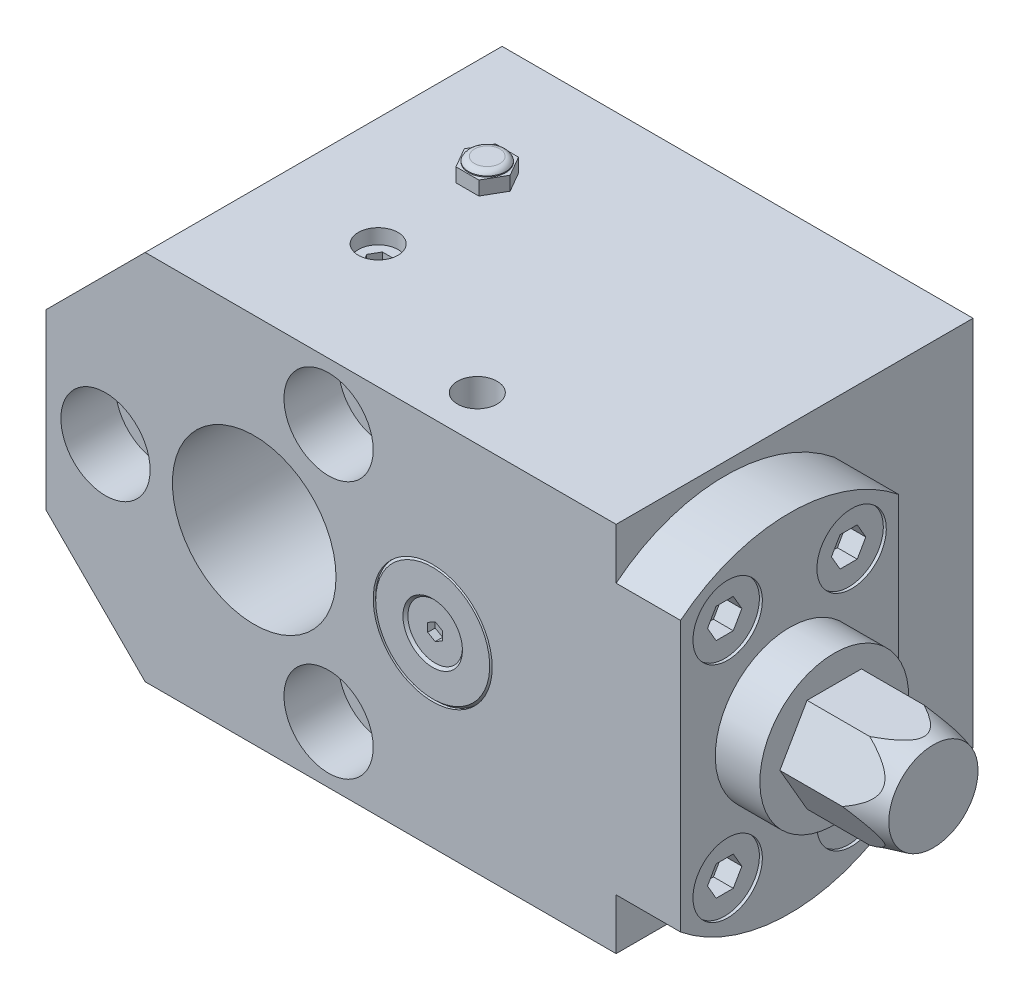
ISO-10303-21;
HEADER;
FILE_DESCRIPTION(('STEP AP214'),'2;1');
FILE_NAME('part.step','',(''),(''),'','','');
FILE_SCHEMA(('AUTOMOTIVE_DESIGN { 1 0 10303 214 1 1 1 1 }'));
ENDSEC;
DATA;
#1=APPLICATION_CONTEXT('core data for automotive mechanical design processes');
#2=APPLICATION_PROTOCOL_DEFINITION('international standard','automotive_design',2000,#1);
#3=PRODUCT_CONTEXT('',#1,'mechanical');
#4=PRODUCT('Part','Part','',(#3));
#5=PRODUCT_RELATED_PRODUCT_CATEGORY('part','',(#4));
#6=PRODUCT_DEFINITION_FORMATION('','',#4);
#7=PRODUCT_DEFINITION_CONTEXT('part definition',#1,'design');
#8=PRODUCT_DEFINITION('design','',#6,#7);
#9=PRODUCT_DEFINITION_SHAPE('','',#8);
#10=(LENGTH_UNIT() NAMED_UNIT(*) SI_UNIT(.MILLI.,.METRE.));
#11=(NAMED_UNIT(*) PLANE_ANGLE_UNIT() SI_UNIT($,.RADIAN.));
#12=(NAMED_UNIT(*) SI_UNIT($,.STERADIAN.) SOLID_ANGLE_UNIT());
#13=UNCERTAINTY_MEASURE_WITH_UNIT(LENGTH_MEASURE(1.E-05),#10,'distance_accuracy_value','');
#14=(GEOMETRIC_REPRESENTATION_CONTEXT(3) GLOBAL_UNCERTAINTY_ASSIGNED_CONTEXT((#13)) GLOBAL_UNIT_ASSIGNED_CONTEXT((#10,
#11,#12)) REPRESENTATION_CONTEXT('',''));
#15=CARTESIAN_POINT('',(0.,0.,0.));
#16=DIRECTION('',(0.,0.,1.));
#17=DIRECTION('',(1.,0.,0.));
#18=AXIS2_PLACEMENT_3D('',#15,#16,#17);
#19=CARTESIAN_POINT('',(-15.5,41.8,25.));
#20=DIRECTION('',(0.,-1.,0.));
#21=DIRECTION('',(0.,0.,-1.));
#22=AXIS2_PLACEMENT_3D('',#19,#20,#21);
#23=PLANE('',#22);
#24=CARTESIAN_POINT('',(-15.5,41.8,25.));
#25=DIRECTION('',(0.,-1.,0.));
#26=DIRECTION('',(0.,0.,-1.));
#27=AXIS2_PLACEMENT_3D('',#24,#25,#26);
#28=CIRCLE('',#27,2.55);
#29=CARTESIAN_POINT('',(-15.5,41.8,22.45));
#30=VERTEX_POINT('',#29);
#31=EDGE_CURVE('E1020',#30,#30,#28,.T.);
#32=ORIENTED_EDGE('',*,*,#31,.F.);
#33=EDGE_LOOP('',(#32));
#34=FACE_BOUND('',#33,.T.);
#35=ADVANCED_FACE('F14',(#34),#23,.F.);
#36=CARTESIAN_POINT('',(-15.5,40.5,25.));
#37=DIRECTION('',(0.,-1.,0.));
#38=DIRECTION('',(0.,0.,-1.));
#39=AXIS2_PLACEMENT_3D('',#36,#37,#38);
#40=TOROIDAL_SURFACE('',#39,2.55,1.3);
#41=CARTESIAN_POINT('',(-15.5,41.,25.));
#42=DIRECTION('',(0.,-1.,0.));
#43=DIRECTION('',(0.,0.,-1.));
#44=AXIS2_PLACEMENT_3D('',#41,#42,#43);
#45=CIRCLE('',#44,3.75);
#46=CARTESIAN_POINT('',(-15.5,41.,21.25));
#47=VERTEX_POINT('',#46);
#48=EDGE_CURVE('E1023',#47,#47,#45,.T.);
#49=ORIENTED_EDGE('',*,*,#48,.F.);
#50=EDGE_LOOP('',(#49));
#51=FACE_BOUND('',#50,.T.);
#52=ORIENTED_EDGE('',*,*,#31,.T.);
#53=EDGE_LOOP('',(#52));
#54=FACE_BOUND('',#53,.T.);
#55=ADVANCED_FACE('F950',(#51,#54),#40,.T.);
#56=CARTESIAN_POINT('',(-15.5,33.,25.));
#57=DIRECTION('',(0.,-1.,0.));
#58=DIRECTION('',(0.,0.,-1.));
#59=AXIS2_PLACEMENT_3D('',#56,#57,#58);
#60=CYLINDRICAL_SURFACE('',#59,3.75);
#61=CARTESIAN_POINT('',(-15.5,40.8,25.));
#62=DIRECTION('',(0.,-1.,0.));
#63=DIRECTION('',(0.,0.,-1.));
#64=AXIS2_PLACEMENT_3D('',#61,#62,#63);
#65=CIRCLE('',#64,3.75);
#66=CARTESIAN_POINT('',(-15.5,40.8,21.25));
#67=VERTEX_POINT('',#66);
#68=EDGE_CURVE('E1026',#67,#67,#65,.T.);
#69=ORIENTED_EDGE('',*,*,#68,.F.);
#70=EDGE_LOOP('',(#69));
#71=FACE_BOUND('',#70,.T.);
#72=ORIENTED_EDGE('',*,*,#48,.T.);
#73=EDGE_LOOP('',(#72));
#74=FACE_BOUND('',#73,.T.);
#75=ADVANCED_FACE('F953',(#71,#74),#60,.T.);
#76=CARTESIAN_POINT('',(-15.5,40.8,30.));
#77=DIRECTION('',(0.,-1.,0.));
#78=DIRECTION('',(0.,0.,-1.));
#79=AXIS2_PLACEMENT_3D('',#76,#77,#78);
#80=PLANE('',#79);
#81=ORIENTED_EDGE('',*,*,#68,.T.);
#82=EDGE_LOOP('',(#81));
#83=FACE_BOUND('',#82,.T.);
#84=DIRECTION('',(0.5,0.,0.866025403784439));
#85=VECTOR('',#84,1.);
#86=CARTESIAN_POINT('',(-20.1188021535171,40.8,25.));
#87=LINE('',#86,#85);
#88=CARTESIAN_POINT('',(-20.1188021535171,40.8,25.));
#89=VERTEX_POINT('',#88);
#90=CARTESIAN_POINT('',(-17.8094010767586,40.8,29.));
#91=VERTEX_POINT('',#90);
#92=EDGE_CURVE('E997',#89,#91,#87,.T.);
#93=ORIENTED_EDGE('',*,*,#92,.T.);
#94=DIRECTION('',(1.,0.,0.));
#95=VECTOR('',#94,1.);
#96=CARTESIAN_POINT('',(-17.8094010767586,40.8,29.));
#97=LINE('',#96,#95);
#98=CARTESIAN_POINT('',(-13.1905989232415,40.8,29.));
#99=VERTEX_POINT('',#98);
#100=EDGE_CURVE('E981',#91,#99,#97,.T.);
#101=ORIENTED_EDGE('',*,*,#100,.T.);
#102=DIRECTION('',(0.5,0.,-0.866025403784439));
#103=VECTOR('',#102,1.);
#104=CARTESIAN_POINT('',(-13.1905989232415,40.8,29.));
#105=LINE('',#104,#103);
#106=CARTESIAN_POINT('',(-10.881197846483,40.8,25.));
#107=VERTEX_POINT('',#106);
#108=EDGE_CURVE('E990',#99,#107,#105,.T.);
#109=ORIENTED_EDGE('',*,*,#108,.T.);
#110=DIRECTION('',(-0.5,0.,-0.866025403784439));
#111=VECTOR('',#110,1.);
#112=CARTESIAN_POINT('',(-10.881197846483,40.8,25.));
#113=LINE('',#112,#111);
#114=CARTESIAN_POINT('',(-13.1905989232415,40.8,21.));
#115=VERTEX_POINT('',#114);
#116=EDGE_CURVE('E994',#107,#115,#113,.T.);
#117=ORIENTED_EDGE('',*,*,#116,.T.);
#118=DIRECTION('',(-1.,0.,0.));
#119=VECTOR('',#118,1.);
#120=CARTESIAN_POINT('',(-13.1905989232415,40.8,21.));
#121=LINE('',#120,#119);
#122=CARTESIAN_POINT('',(-17.8094010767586,40.8,21.));
#123=VERTEX_POINT('',#122);
#124=EDGE_CURVE('E1004',#115,#123,#121,.T.);
#125=ORIENTED_EDGE('',*,*,#124,.T.);
#126=DIRECTION('',(-0.5,0.,0.866025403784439));
#127=VECTOR('',#126,1.);
#128=CARTESIAN_POINT('',(-17.8094010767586,40.8,21.));
#129=LINE('',#128,#127);
#130=EDGE_CURVE('E999',#123,#89,#129,.T.);
#131=ORIENTED_EDGE('',*,*,#130,.T.);
#132=EDGE_LOOP('',(#93,#101,#109,#117,#125,#131));
#133=FACE_BOUND('',#132,.T.);
#134=ADVANCED_FACE('F956',(#83,#133),#80,.F.);
#135=CARTESIAN_POINT('',(20.5,0.,71.5));
#136=DIRECTION('',(0.,0.,1.));
#137=DIRECTION('',(1.,0.,0.));
#138=AXIS2_PLACEMENT_3D('',#135,#136,#137);
#139=CONICAL_SURFACE('',#138,5.5,0.785398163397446);
#140=CARTESIAN_POINT('',(20.5,0.,72.));
#141=DIRECTION('',(0.,0.,-1.));
#142=DIRECTION('',(-1.,0.,0.));
#143=AXIS2_PLACEMENT_3D('',#140,#141,#142);
#144=CIRCLE('',#143,6.);
#145=CARTESIAN_POINT('',(14.5,0.,72.));
#146=VERTEX_POINT('',#145);
#147=EDGE_CURVE('E691',#146,#146,#144,.T.);
#148=ORIENTED_EDGE('',*,*,#147,.F.);
#149=EDGE_LOOP('',(#148));
#150=FACE_BOUND('',#149,.T.);
#151=CARTESIAN_POINT('',(20.5,0.,71.5));
#152=DIRECTION('',(0.,0.,-1.));
#153=DIRECTION('',(-1.,0.,0.));
#154=AXIS2_PLACEMENT_3D('',#151,#152,#153);
#155=CIRCLE('',#154,5.5);
#156=CARTESIAN_POINT('',(15.,0.,71.5));
#157=VERTEX_POINT('',#156);
#158=EDGE_CURVE('E490',#157,#157,#155,.F.);
#159=ORIENTED_EDGE('',*,*,#158,.F.);
#160=EDGE_LOOP('',(#159));
#161=FACE_BOUND('',#160,.T.);
#162=ADVANCED_FACE('F829',(#150,#161),#139,.F.);
#163=CARTESIAN_POINT('',(-17.8094010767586,23.7164430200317,29.));
#164=DIRECTION('',(0.,0.,1.));
#165=DIRECTION('',(1.,0.,0.));
#166=AXIS2_PLACEMENT_3D('',#163,#164,#165);
#167=PLANE('',#166);
#168=DIRECTION('',(0.,1.,0.));
#169=VECTOR('',#168,1.);
#170=CARTESIAN_POINT('',(-13.1905989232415,23.7164430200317,29.));
#171=LINE('',#170,#169);
#172=CARTESIAN_POINT('',(-13.1905989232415,38.,29.));
#173=VERTEX_POINT('',#172);
#174=EDGE_CURVE('E977',#173,#99,#171,.T.);
#175=ORIENTED_EDGE('',*,*,#174,.T.);
#176=ORIENTED_EDGE('',*,*,#100,.F.);
#177=DIRECTION('',(0.,1.,0.));
#178=VECTOR('',#177,1.);
#179=CARTESIAN_POINT('',(-17.8094010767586,23.7164430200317,29.));
#180=LINE('',#179,#178);
#181=CARTESIAN_POINT('',(-17.8094010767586,38.,29.));
#182=VERTEX_POINT('',#181);
#183=EDGE_CURVE('E987',#182,#91,#180,.T.);
#184=ORIENTED_EDGE('',*,*,#183,.F.);
#185=DIRECTION('',(-1.,0.,0.));
#186=VECTOR('',#185,1.);
#187=CARTESIAN_POINT('',(-17.8094010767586,38.,29.));
#188=LINE('',#187,#186);
#189=EDGE_CURVE('E984',#173,#182,#188,.T.);
#190=ORIENTED_EDGE('',*,*,#189,.F.);
#191=EDGE_LOOP('',(#175,#176,#184,#190));
#192=FACE_BOUND('',#191,.T.);
#193=ADVANCED_FACE('F947',(#192),#167,.T.);
#194=CARTESIAN_POINT('',(-13.1905989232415,23.7164430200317,29.));
#195=DIRECTION('',(0.866025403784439,0.,0.5));
#196=DIRECTION('',(0.5,0.,-0.866025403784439));
#197=AXIS2_PLACEMENT_3D('',#194,#195,#196);
#198=PLANE('',#197);
#199=DIRECTION('',(0.,1.,0.));
#200=VECTOR('',#199,1.);
#201=CARTESIAN_POINT('',(-10.881197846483,23.7164430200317,25.));
#202=LINE('',#201,#200);
#203=CARTESIAN_POINT('',(-10.881197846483,38.,25.));
#204=VERTEX_POINT('',#203);
#205=EDGE_CURVE('E986',#204,#107,#202,.T.);
#206=ORIENTED_EDGE('',*,*,#205,.T.);
#207=ORIENTED_EDGE('',*,*,#108,.F.);
#208=ORIENTED_EDGE('',*,*,#174,.F.);
#209=DIRECTION('',(-0.5,0.,0.866025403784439));
#210=VECTOR('',#209,1.);
#211=CARTESIAN_POINT('',(-13.1905989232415,38.,29.));
#212=LINE('',#211,#210);
#213=EDGE_CURVE('E1433',#204,#173,#212,.T.);
#214=ORIENTED_EDGE('',*,*,#213,.F.);
#215=EDGE_LOOP('',(#206,#207,#208,#214));
#216=FACE_BOUND('',#215,.T.);
#217=ADVANCED_FACE('F968',(#216),#198,.T.);
#218=CARTESIAN_POINT('',(-10.881197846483,23.7164430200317,25.));
#219=DIRECTION('',(0.866025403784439,0.,-0.5));
#220=DIRECTION('',(-0.5,0.,-0.866025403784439));
#221=AXIS2_PLACEMENT_3D('',#218,#219,#220);
#222=PLANE('',#221);
#223=DIRECTION('',(0.,1.,0.));
#224=VECTOR('',#223,1.);
#225=CARTESIAN_POINT('',(-13.1905989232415,23.7164430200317,21.));
#226=LINE('',#225,#224);
#227=CARTESIAN_POINT('',(-13.1905989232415,38.,21.));
#228=VERTEX_POINT('',#227);
#229=EDGE_CURVE('E1011',#228,#115,#226,.T.);
#230=ORIENTED_EDGE('',*,*,#229,.T.);
#231=ORIENTED_EDGE('',*,*,#116,.F.);
#232=ORIENTED_EDGE('',*,*,#205,.F.);
#233=DIRECTION('',(0.5,0.,0.866025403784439));
#234=VECTOR('',#233,1.);
#235=CARTESIAN_POINT('',(-10.881197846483,38.,25.));
#236=LINE('',#235,#234);
#237=EDGE_CURVE('E1435',#228,#204,#236,.T.);
#238=ORIENTED_EDGE('',*,*,#237,.F.);
#239=EDGE_LOOP('',(#230,#231,#232,#238));
#240=FACE_BOUND('',#239,.T.);
#241=ADVANCED_FACE('F973',(#240),#222,.T.);
#242=CARTESIAN_POINT('',(-13.1905989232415,23.7164430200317,21.));
#243=DIRECTION('',(0.,0.,-1.));
#244=DIRECTION('',(-1.,0.,0.));
#245=AXIS2_PLACEMENT_3D('',#242,#243,#244);
#246=PLANE('',#245);
#247=DIRECTION('',(0.,1.,0.));
#248=VECTOR('',#247,1.);
#249=CARTESIAN_POINT('',(-17.8094010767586,23.7164430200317,21.));
#250=LINE('',#249,#248);
#251=CARTESIAN_POINT('',(-17.8094010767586,38.,21.));
#252=VERTEX_POINT('',#251);
#253=EDGE_CURVE('E1008',#252,#123,#250,.T.);
#254=ORIENTED_EDGE('',*,*,#253,.T.);
#255=ORIENTED_EDGE('',*,*,#124,.F.);
#256=ORIENTED_EDGE('',*,*,#229,.F.);
#257=DIRECTION('',(1.,0.,0.));
#258=VECTOR('',#257,1.);
#259=CARTESIAN_POINT('',(-13.1905989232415,38.,21.));
#260=LINE('',#259,#258);
#261=EDGE_CURVE('E1438',#252,#228,#260,.T.);
#262=ORIENTED_EDGE('',*,*,#261,.F.);
#263=EDGE_LOOP('',(#254,#255,#256,#262));
#264=FACE_BOUND('',#263,.T.);
#265=ADVANCED_FACE('F943',(#264),#246,.T.);
#266=CARTESIAN_POINT('',(-17.8094010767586,23.7164430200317,21.));
#267=DIRECTION('',(-0.866025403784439,0.,-0.5));
#268=DIRECTION('',(-0.5,0.,0.866025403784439));
#269=AXIS2_PLACEMENT_3D('',#266,#267,#268);
#270=PLANE('',#269);
#271=DIRECTION('',(0.,1.,0.));
#272=VECTOR('',#271,1.);
#273=CARTESIAN_POINT('',(-20.1188021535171,23.7164430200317,25.));
#274=LINE('',#273,#272);
#275=CARTESIAN_POINT('',(-20.1188021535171,38.,25.));
#276=VERTEX_POINT('',#275);
#277=EDGE_CURVE('E1007',#276,#89,#274,.T.);
#278=ORIENTED_EDGE('',*,*,#277,.T.);
#279=ORIENTED_EDGE('',*,*,#130,.F.);
#280=ORIENTED_EDGE('',*,*,#253,.F.);
#281=DIRECTION('',(0.5,0.,-0.866025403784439));
#282=VECTOR('',#281,1.);
#283=CARTESIAN_POINT('',(-17.8094010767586,38.,21.));
#284=LINE('',#283,#282);
#285=EDGE_CURVE('E1019',#276,#252,#284,.T.);
#286=ORIENTED_EDGE('',*,*,#285,.F.);
#287=EDGE_LOOP('',(#278,#279,#280,#286));
#288=FACE_BOUND('',#287,.T.);
#289=ADVANCED_FACE('F937',(#288),#270,.T.);
#290=CARTESIAN_POINT('',(-20.1188021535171,23.7164430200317,25.));
#291=DIRECTION('',(-0.866025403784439,0.,0.5));
#292=DIRECTION('',(0.5,0.,0.866025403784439));
#293=AXIS2_PLACEMENT_3D('',#290,#291,#292);
#294=PLANE('',#293);
#295=ORIENTED_EDGE('',*,*,#183,.T.);
#296=ORIENTED_EDGE('',*,*,#92,.F.);
#297=ORIENTED_EDGE('',*,*,#277,.F.);
#298=DIRECTION('',(-0.5,0.,-0.866025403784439));
#299=VECTOR('',#298,1.);
#300=CARTESIAN_POINT('',(-20.1188021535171,38.,25.));
#301=LINE('',#300,#299);
#302=EDGE_CURVE('E1010',#182,#276,#301,.T.);
#303=ORIENTED_EDGE('',*,*,#302,.F.);
#304=EDGE_LOOP('',(#295,#296,#297,#303));
#305=FACE_BOUND('',#304,.T.);
#306=ADVANCED_FACE('F927',(#305),#294,.T.);
#307=CARTESIAN_POINT('',(20.5,0.,72.));
#308=DIRECTION('',(0.,0.,-1.));
#309=DIRECTION('',(-1.,0.,0.));
#310=AXIS2_PLACEMENT_3D('',#307,#308,#309);
#311=PLANE('',#310);
#312=CARTESIAN_POINT('',(20.5,0.,72.));
#313=DIRECTION('',(0.,0.,-1.));
#314=DIRECTION('',(-1.,0.,0.));
#315=AXIS2_PLACEMENT_3D('',#312,#313,#314);
#316=CIRCLE('',#315,11.5);
#317=CARTESIAN_POINT('',(9.,0.,72.));
#318=VERTEX_POINT('',#317);
#319=EDGE_CURVE('E645',#318,#318,#316,.F.);
#320=ORIENTED_EDGE('',*,*,#319,.T.);
#321=EDGE_LOOP('',(#320));
#322=FACE_BOUND('',#321,.T.);
#323=ORIENTED_EDGE('',*,*,#147,.T.);
#324=EDGE_LOOP('',(#323));
#325=FACE_BOUND('',#324,.T.);
#326=ADVANCED_FACE('F847',(#322,#325),#311,.F.);
#327=CARTESIAN_POINT('',(-15.5,38.,28.));
#328=DIRECTION('',(0.,1.,0.));
#329=DIRECTION('',(0.,0.,1.));
#330=AXIS2_PLACEMENT_3D('',#327,#328,#329);
#331=PLANE('',#330);
#332=CARTESIAN_POINT('',(-15.5,38.,25.));
#333=DIRECTION('',(0.,-1.,0.));
#334=DIRECTION('',(0.,0.,-1.));
#335=AXIS2_PLACEMENT_3D('',#332,#333,#334);
#336=CIRCLE('',#335,3.);
#337=CARTESIAN_POINT('',(-15.5,38.,22.));
#338=VERTEX_POINT('',#337);
#339=EDGE_CURVE('E1028',#338,#338,#336,.T.);
#340=ORIENTED_EDGE('',*,*,#339,.F.);
#341=EDGE_LOOP('',(#340));
#342=FACE_BOUND('',#341,.T.);
#343=ORIENTED_EDGE('',*,*,#302,.T.);
#344=ORIENTED_EDGE('',*,*,#285,.T.);
#345=ORIENTED_EDGE('',*,*,#261,.T.);
#346=ORIENTED_EDGE('',*,*,#237,.T.);
#347=ORIENTED_EDGE('',*,*,#213,.T.);
#348=ORIENTED_EDGE('',*,*,#189,.T.);
#349=EDGE_LOOP('',(#343,#344,#345,#346,#347,#348));
#350=FACE_BOUND('',#349,.T.);
#351=ADVANCED_FACE('F886',(#342,#350),#331,.F.);
#352=CARTESIAN_POINT('',(-40.,0.,61.));
#353=DIRECTION('',(0.,0.,-1.));
#354=DIRECTION('',(-1.,0.,0.));
#355=AXIS2_PLACEMENT_3D('',#352,#353,#354);
#356=PLANE('',#355);
#357=CARTESIAN_POINT('',(-45.5,0.,61.));
#358=DIRECTION('',(0.,0.,1.));
#359=DIRECTION('',(1.,0.,0.));
#360=AXIS2_PLACEMENT_3D('',#357,#358,#359);
#361=CIRCLE('',#360,5.5);
#362=CARTESIAN_POINT('',(-40.,0.,61.));
#363=VERTEX_POINT('',#362);
#364=EDGE_CURVE('E466',#363,#363,#361,.T.);
#365=ORIENTED_EDGE('',*,*,#364,.F.);
#366=EDGE_LOOP('',(#365));
#367=FACE_BOUND('',#366,.T.);
#368=CARTESIAN_POINT('',(-45.5,0.,61.));
#369=DIRECTION('',(0.,0.,1.));
#370=DIRECTION('',(1.,0.,0.));
#371=AXIS2_PLACEMENT_3D('',#368,#369,#370);
#372=CIRCLE('',#371,9.);
#373=CARTESIAN_POINT('',(-36.5,0.,61.));
#374=VERTEX_POINT('',#373);
#375=EDGE_CURVE('E463',#374,#374,#372,.T.);
#376=ORIENTED_EDGE('',*,*,#375,.T.);
#377=EDGE_LOOP('',(#376));
#378=FACE_BOUND('',#377,.T.);
#379=ADVANCED_FACE('F848',(#367,#378),#356,.F.);
#380=CARTESIAN_POINT('',(4.99999999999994,-25.9807621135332,61.));
#381=DIRECTION('',(0.,0.,-1.));
#382=DIRECTION('',(-1.,0.,0.));
#383=AXIS2_PLACEMENT_3D('',#380,#381,#382);
#384=PLANE('',#383);
#385=CARTESIAN_POINT('',(-0.500000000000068,-25.9807621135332,61.));
#386=DIRECTION('',(0.,0.,1.));
#387=DIRECTION('',(1.,0.,0.));
#388=AXIS2_PLACEMENT_3D('',#385,#386,#387);
#389=CIRCLE('',#388,5.5);
#390=CARTESIAN_POINT('',(4.99999999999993,-25.9807621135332,61.));
#391=VERTEX_POINT('',#390);
#392=EDGE_CURVE('E454',#391,#391,#389,.T.);
#393=ORIENTED_EDGE('',*,*,#392,.F.);
#394=EDGE_LOOP('',(#393));
#395=FACE_BOUND('',#394,.T.);
#396=CARTESIAN_POINT('',(-0.500000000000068,-25.9807621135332,61.));
#397=DIRECTION('',(0.,0.,1.));
#398=DIRECTION('',(1.,0.,0.));
#399=AXIS2_PLACEMENT_3D('',#396,#397,#398);
#400=CIRCLE('',#399,9.);
#401=CARTESIAN_POINT('',(8.49999999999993,-25.9807621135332,61.));
#402=VERTEX_POINT('',#401);
#403=EDGE_CURVE('E451',#402,#402,#400,.T.);
#404=ORIENTED_EDGE('',*,*,#403,.T.);
#405=EDGE_LOOP('',(#404));
#406=FACE_BOUND('',#405,.T.);
#407=ADVANCED_FACE('F863',(#395,#406),#384,.F.);
#408=CARTESIAN_POINT('',(4.99999999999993,25.9807621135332,61.));
#409=DIRECTION('',(0.,0.,-1.));
#410=DIRECTION('',(-1.,0.,0.));
#411=AXIS2_PLACEMENT_3D('',#408,#409,#410);
#412=PLANE('',#411);
#413=CARTESIAN_POINT('',(-0.500000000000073,25.9807621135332,61.));
#414=DIRECTION('',(0.,0.,1.));
#415=DIRECTION('',(1.,0.,0.));
#416=AXIS2_PLACEMENT_3D('',#413,#414,#415);
#417=CIRCLE('',#416,5.5);
#418=CARTESIAN_POINT('',(4.99999999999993,25.9807621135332,61.));
#419=VERTEX_POINT('',#418);
#420=EDGE_CURVE('E442',#419,#419,#417,.T.);
#421=ORIENTED_EDGE('',*,*,#420,.F.);
#422=EDGE_LOOP('',(#421));
#423=FACE_BOUND('',#422,.T.);
#424=CARTESIAN_POINT('',(-0.500000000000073,25.9807621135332,61.));
#425=DIRECTION('',(0.,0.,1.));
#426=DIRECTION('',(1.,0.,0.));
#427=AXIS2_PLACEMENT_3D('',#424,#425,#426);
#428=CIRCLE('',#427,9.);
#429=CARTESIAN_POINT('',(8.49999999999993,25.9807621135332,61.));
#430=VERTEX_POINT('',#429);
#431=EDGE_CURVE('E439',#430,#430,#428,.T.);
#432=ORIENTED_EDGE('',*,*,#431,.T.);
#433=EDGE_LOOP('',(#432));
#434=FACE_BOUND('',#433,.T.);
#435=ADVANCED_FACE('F859',(#423,#434),#412,.F.);
#436=CARTESIAN_POINT('',(20.5,0.,71.5));
#437=DIRECTION('',(0.,0.,-1.));
#438=DIRECTION('',(-1.,0.,0.));
#439=AXIS2_PLACEMENT_3D('',#436,#437,#438);
#440=CONICAL_SURFACE('',#439,12.,0.785398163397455);
#441=ORIENTED_EDGE('',*,*,#319,.F.);
#442=EDGE_LOOP('',(#441));
#443=FACE_BOUND('',#442,.T.);
#444=CARTESIAN_POINT('',(20.5,0.,71.5));
#445=DIRECTION('',(0.,0.,-1.));
#446=DIRECTION('',(-1.,0.,0.));
#447=AXIS2_PLACEMENT_3D('',#444,#445,#446);
#448=CIRCLE('',#447,12.);
#449=CARTESIAN_POINT('',(8.5,0.,71.5));
#450=VERTEX_POINT('',#449);
#451=EDGE_CURVE('E694',#450,#450,#448,.T.);
#452=ORIENTED_EDGE('',*,*,#451,.F.);
#453=EDGE_LOOP('',(#452));
#454=FACE_BOUND('',#453,.T.);
#455=ADVANCED_FACE('F862',(#443,#454),#440,.T.);
#456=CARTESIAN_POINT('',(-57.5,17.5,72.));
#457=DIRECTION('',(1.,0.,0.));
#458=DIRECTION('',(0.,0.,-1.));
#459=AXIS2_PLACEMENT_3D('',#456,#457,#458);
#460=PLANE('',#459);
#461=DIRECTION('',(0.,0.,-1.));
#462=VECTOR('',#461,1.);
#463=CARTESIAN_POINT('',(-57.5,17.5,72.));
#464=LINE('',#463,#462);
#465=CARTESIAN_POINT('',(-57.5,17.5,72.));
#466=VERTEX_POINT('',#465);
#467=CARTESIAN_POINT('',(-57.5,17.5,0.));
#468=VERTEX_POINT('',#467);
#469=EDGE_CURVE('E481',#466,#468,#464,.T.);
#470=ORIENTED_EDGE('',*,*,#469,.T.);
#471=DIRECTION('',(0.,1.,0.));
#472=VECTOR('',#471,1.);
#473=CARTESIAN_POINT('',(-57.5,17.5,0.));
#474=LINE('',#473,#472);
#475=CARTESIAN_POINT('',(-57.5,-17.5,0.));
#476=VERTEX_POINT('',#475);
#477=EDGE_CURVE('E1516',#476,#468,#474,.T.);
#478=ORIENTED_EDGE('',*,*,#477,.F.);
#479=DIRECTION('',(0.,0.,-1.));
#480=VECTOR('',#479,1.);
#481=CARTESIAN_POINT('',(-57.5,-17.5,72.));
#482=LINE('',#481,#480);
#483=CARTESIAN_POINT('',(-57.5,-17.5,72.));
#484=VERTEX_POINT('',#483);
#485=EDGE_CURVE('E478',#484,#476,#482,.T.);
#486=ORIENTED_EDGE('',*,*,#485,.F.);
#487=DIRECTION('',(0.,-1.,0.));
#488=VECTOR('',#487,1.);
#489=CARTESIAN_POINT('',(-57.5,17.5,72.));
#490=LINE('',#489,#488);
#491=EDGE_CURVE('E1510',#466,#484,#490,.T.);
#492=ORIENTED_EDGE('',*,*,#491,.F.);
#493=EDGE_LOOP('',(#470,#478,#486,#492));
#494=FACE_BOUND('',#493,.T.);
#495=ADVANCED_FACE('F883',(#494),#460,.F.);
#496=CARTESIAN_POINT('',(-37.5,37.5,72.));
#497=DIRECTION('',(0.707106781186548,-0.707106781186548,0.));
#498=DIRECTION('',(0.707106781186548,0.707106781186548,0.));
#499=AXIS2_PLACEMENT_3D('',#496,#497,#498);
#500=PLANE('',#499);
#501=DIRECTION('',(0.,0.,-1.));
#502=VECTOR('',#501,1.);
#503=CARTESIAN_POINT('',(-37.5,37.5,72.));
#504=LINE('',#503,#502);
#505=CARTESIAN_POINT('',(-37.5,37.5,72.));
#506=VERTEX_POINT('',#505);
#507=CARTESIAN_POINT('',(-37.5,37.5,0.));
#508=VERTEX_POINT('',#507);
#509=EDGE_CURVE('E484',#506,#508,#504,.T.);
#510=ORIENTED_EDGE('',*,*,#509,.T.);
#511=DIRECTION('',(0.707106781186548,0.707106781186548,0.));
#512=VECTOR('',#511,1.);
#513=CARTESIAN_POINT('',(-37.5,37.5,0.));
#514=LINE('',#513,#512);
#515=EDGE_CURVE('E1518',#468,#508,#514,.T.);
#516=ORIENTED_EDGE('',*,*,#515,.F.);
#517=ORIENTED_EDGE('',*,*,#469,.F.);
#518=DIRECTION('',(-0.707106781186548,-0.707106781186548,0.));
#519=VECTOR('',#518,1.);
#520=CARTESIAN_POINT('',(-37.5,37.5,72.));
#521=LINE('',#520,#519);
#522=EDGE_CURVE('E1505',#506,#466,#521,.T.);
#523=ORIENTED_EDGE('',*,*,#522,.F.);
#524=EDGE_LOOP('',(#510,#516,#517,#523));
#525=FACE_BOUND('',#524,.T.);
#526=ADVANCED_FACE('F845',(#525),#500,.F.);
#527=CARTESIAN_POINT('',(20.5,26.5,63.));
#528=DIRECTION('',(0.,1.,0.));
#529=DIRECTION('',(-1.,0.,0.));
#530=AXIS2_PLACEMENT_3D('',#527,#528,#529);
#531=CYLINDRICAL_SURFACE('',#530,4.);
#532=CARTESIAN_POINT('',(20.5,30.5,63.));
#533=DIRECTION('',(0.,1.,0.));
#534=DIRECTION('',(-1.,0.,0.));
#535=AXIS2_PLACEMENT_3D('',#532,#533,#534);
#536=CIRCLE('',#535,4.);
#537=CARTESIAN_POINT('',(16.5,30.5,63.));
#538=VERTEX_POINT('',#537);
#539=EDGE_CURVE('E418',#538,#538,#536,.T.);
#540=ORIENTED_EDGE('',*,*,#539,.F.);
#541=EDGE_LOOP('',(#540));
#542=FACE_BOUND('',#541,.T.);
#543=CARTESIAN_POINT('',(20.5,37.5,63.));
#544=DIRECTION('',(0.,1.,0.));
#545=DIRECTION('',(-1.,0.,0.));
#546=AXIS2_PLACEMENT_3D('',#543,#544,#545);
#547=CIRCLE('',#546,4.);
#548=CARTESIAN_POINT('',(16.5,37.5,63.));
#549=VERTEX_POINT('',#548);
#550=EDGE_CURVE('E430',#549,#549,#547,.T.);
#551=ORIENTED_EDGE('',*,*,#550,.T.);
#552=EDGE_LOOP('',(#551));
#553=FACE_BOUND('',#552,.T.);
#554=ADVANCED_FACE('F839',(#542,#553),#531,.F.);
#555=CARTESIAN_POINT('',(-15.5,30.5,47.));
#556=DIRECTION('',(0.,1.,0.));
#557=DIRECTION('',(-1.,0.,0.));
#558=AXIS2_PLACEMENT_3D('',#555,#556,#557);
#559=CYLINDRICAL_SURFACE('',#558,4.);
#560=CARTESIAN_POINT('',(-15.5,34.5,47.));
#561=DIRECTION('',(0.,1.,0.));
#562=DIRECTION('',(-1.,0.,0.));
#563=AXIS2_PLACEMENT_3D('',#560,#561,#562);
#564=CIRCLE('',#563,4.);
#565=CARTESIAN_POINT('',(-19.5,34.5,47.));
#566=VERTEX_POINT('',#565);
#567=EDGE_CURVE('E1373',#566,#566,#564,.T.);
#568=ORIENTED_EDGE('',*,*,#567,.F.);
#569=EDGE_LOOP('',(#568));
#570=FACE_BOUND('',#569,.T.);
#571=CARTESIAN_POINT('',(-15.5,37.5,47.));
#572=DIRECTION('',(0.,1.,0.));
#573=DIRECTION('',(-1.,0.,0.));
#574=AXIS2_PLACEMENT_3D('',#571,#572,#573);
#575=CIRCLE('',#574,4.);
#576=CARTESIAN_POINT('',(-19.5,37.5,47.));
#577=VERTEX_POINT('',#576);
#578=EDGE_CURVE('E427',#577,#577,#575,.T.);
#579=ORIENTED_EDGE('',*,*,#578,.T.);
#580=EDGE_LOOP('',(#579));
#581=FACE_BOUND('',#580,.T.);
#582=ADVANCED_FACE('F835',(#570,#581),#559,.F.);
#583=CARTESIAN_POINT('',(-15.5,33.,25.));
#584=DIRECTION('',(0.,-1.,0.));
#585=DIRECTION('',(0.,0.,-1.));
#586=AXIS2_PLACEMENT_3D('',#583,#584,#585);
#587=CYLINDRICAL_SURFACE('',#586,3.);
#588=CARTESIAN_POINT('',(-15.5,37.5,25.));
#589=DIRECTION('',(0.,-1.,0.));
#590=DIRECTION('',(0.,0.,-1.));
#591=AXIS2_PLACEMENT_3D('',#588,#589,#590);
#592=CIRCLE('',#591,3.);
#593=CARTESIAN_POINT('',(-15.5,37.5,22.));
#594=VERTEX_POINT('',#593);
#595=EDGE_CURVE('E1031',#594,#594,#592,.T.);
#596=ORIENTED_EDGE('',*,*,#595,.F.);
#597=EDGE_LOOP('',(#596));
#598=FACE_BOUND('',#597,.T.);
#599=ORIENTED_EDGE('',*,*,#339,.T.);
#600=EDGE_LOOP('',(#599));
#601=FACE_BOUND('',#600,.T.);
#602=ADVANCED_FACE('F838',(#598,#601),#587,.T.);
#603=CARTESIAN_POINT('',(-45.5,0.,72.));
#604=DIRECTION('',(0.,0.,1.));
#605=DIRECTION('',(1.,0.,0.));
#606=AXIS2_PLACEMENT_3D('',#603,#604,#605);
#607=CYLINDRICAL_SURFACE('',#606,5.5);
#608=CARTESIAN_POINT('',(-45.5,0.,0.));
#609=DIRECTION('',(0.,0.,1.));
#610=DIRECTION('',(1.,0.,0.));
#611=AXIS2_PLACEMENT_3D('',#608,#609,#610);
#612=CIRCLE('',#611,5.5);
#613=CARTESIAN_POINT('',(-40.,0.,0.));
#614=VERTEX_POINT('',#613);
#615=EDGE_CURVE('E469',#614,#614,#612,.T.);
#616=ORIENTED_EDGE('',*,*,#615,.F.);
#617=EDGE_LOOP('',(#616));
#618=FACE_BOUND('',#617,.T.);
#619=ORIENTED_EDGE('',*,*,#364,.T.);
#620=EDGE_LOOP('',(#619));
#621=FACE_BOUND('',#620,.T.);
#622=ADVANCED_FACE('F878',(#618,#621),#607,.F.);
#623=CARTESIAN_POINT('',(-0.500000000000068,-25.9807621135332,72.));
#624=DIRECTION('',(0.,0.,1.));
#625=DIRECTION('',(1.,0.,0.));
#626=AXIS2_PLACEMENT_3D('',#623,#624,#625);
#627=CYLINDRICAL_SURFACE('',#626,5.5);
#628=CARTESIAN_POINT('',(-0.500000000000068,-25.9807621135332,0.));
#629=DIRECTION('',(0.,0.,1.));
#630=DIRECTION('',(1.,0.,0.));
#631=AXIS2_PLACEMENT_3D('',#628,#629,#630);
#632=CIRCLE('',#631,5.5);
#633=CARTESIAN_POINT('',(4.99999999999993,-25.9807621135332,0.));
#634=VERTEX_POINT('',#633);
#635=EDGE_CURVE('E457',#634,#634,#632,.T.);
#636=ORIENTED_EDGE('',*,*,#635,.F.);
#637=EDGE_LOOP('',(#636));
#638=FACE_BOUND('',#637,.T.);
#639=ORIENTED_EDGE('',*,*,#392,.T.);
#640=EDGE_LOOP('',(#639));
#641=FACE_BOUND('',#640,.T.);
#642=ADVANCED_FACE('F867',(#638,#641),#627,.F.);
#643=CARTESIAN_POINT('',(-0.500000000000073,25.9807621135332,72.));
#644=DIRECTION('',(0.,0.,1.));
#645=DIRECTION('',(1.,0.,0.));
#646=AXIS2_PLACEMENT_3D('',#643,#644,#645);
#647=CYLINDRICAL_SURFACE('',#646,5.5);
#648=CARTESIAN_POINT('',(-0.500000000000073,25.9807621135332,0.));
#649=DIRECTION('',(0.,0.,1.));
#650=DIRECTION('',(1.,0.,0.));
#651=AXIS2_PLACEMENT_3D('',#648,#649,#650);
#652=CIRCLE('',#651,5.5);
#653=CARTESIAN_POINT('',(4.99999999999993,25.9807621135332,0.));
#654=VERTEX_POINT('',#653);
#655=EDGE_CURVE('E445',#654,#654,#652,.T.);
#656=ORIENTED_EDGE('',*,*,#655,.F.);
#657=EDGE_LOOP('',(#656));
#658=FACE_BOUND('',#657,.T.);
#659=ORIENTED_EDGE('',*,*,#420,.T.);
#660=EDGE_LOOP('',(#659));
#661=FACE_BOUND('',#660,.T.);
#662=ADVANCED_FACE('F832',(#658,#661),#647,.F.);
#663=CARTESIAN_POINT('',(29.5,24.,0.));
#664=DIRECTION('',(0.,0.,-1.));
#665=DIRECTION('',(-1.,0.,0.));
#666=AXIS2_PLACEMENT_3D('',#663,#664,#665);
#667=CYLINDRICAL_SURFACE('',#666,4.);
#668=CARTESIAN_POINT('',(29.5,24.,16.));
#669=DIRECTION('',(0.,0.,-1.));
#670=DIRECTION('',(-1.,0.,0.));
#671=AXIS2_PLACEMENT_3D('',#668,#669,#670);
#672=CIRCLE('',#671,4.);
#673=CARTESIAN_POINT('',(25.5,24.,16.));
#674=VERTEX_POINT('',#673);
#675=EDGE_CURVE('E424',#674,#674,#672,.T.);
#676=ORIENTED_EDGE('',*,*,#675,.F.);
#677=EDGE_LOOP('',(#676));
#678=FACE_BOUND('',#677,.T.);
#679=CARTESIAN_POINT('',(29.5,24.,0.));
#680=DIRECTION('',(0.,0.,-1.));
#681=DIRECTION('',(-1.,0.,0.));
#682=AXIS2_PLACEMENT_3D('',#679,#680,#681);
#683=CIRCLE('',#682,4.);
#684=CARTESIAN_POINT('',(25.5,24.,0.));
#685=VERTEX_POINT('',#684);
#686=EDGE_CURVE('E421',#685,#685,#683,.T.);
#687=ORIENTED_EDGE('',*,*,#686,.T.);
#688=EDGE_LOOP('',(#687));
#689=FACE_BOUND('',#688,.T.);
#690=ADVANCED_FACE('F827',(#678,#689),#667,.F.);
#691=CARTESIAN_POINT('',(29.5,-24.,0.));
#692=DIRECTION('',(0.,0.,-1.));
#693=DIRECTION('',(-1.,0.,0.));
#694=AXIS2_PLACEMENT_3D('',#691,#692,#693);
#695=CYLINDRICAL_SURFACE('',#694,4.);
#696=CARTESIAN_POINT('',(29.5,-24.,16.));
#697=DIRECTION('',(0.,0.,-1.));
#698=DIRECTION('',(-1.,0.,0.));
#699=AXIS2_PLACEMENT_3D('',#696,#697,#698);
#700=CIRCLE('',#699,4.);
#701=CARTESIAN_POINT('',(25.5,-24.,16.));
#702=VERTEX_POINT('',#701);
#703=EDGE_CURVE('E417',#702,#702,#700,.T.);
#704=ORIENTED_EDGE('',*,*,#703,.F.);
#705=EDGE_LOOP('',(#704));
#706=FACE_BOUND('',#705,.T.);
#707=CARTESIAN_POINT('',(29.5,-24.,0.));
#708=DIRECTION('',(0.,0.,-1.));
#709=DIRECTION('',(-1.,0.,0.));
#710=AXIS2_PLACEMENT_3D('',#707,#708,#709);
#711=CIRCLE('',#710,4.);
#712=CARTESIAN_POINT('',(25.5,-24.,0.));
#713=VERTEX_POINT('',#712);
#714=EDGE_CURVE('E414',#713,#713,#711,.T.);
#715=ORIENTED_EDGE('',*,*,#714,.T.);
#716=EDGE_LOOP('',(#715));
#717=FACE_BOUND('',#716,.T.);
#718=ADVANCED_FACE('F823',(#706,#717),#695,.F.);
#719=CARTESIAN_POINT('',(-57.5,-17.5,72.));
#720=DIRECTION('',(0.707106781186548,0.707106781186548,0.));
#721=DIRECTION('',(-0.707106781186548,0.707106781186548,0.));
#722=AXIS2_PLACEMENT_3D('',#719,#720,#721);
#723=PLANE('',#722);
#724=ORIENTED_EDGE('',*,*,#485,.T.);
#725=DIRECTION('',(-0.707106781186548,0.707106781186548,0.));
#726=VECTOR('',#725,1.);
#727=CARTESIAN_POINT('',(-57.5,-17.5,0.));
#728=LINE('',#727,#726);
#729=CARTESIAN_POINT('',(-37.5,-37.5,0.));
#730=VERTEX_POINT('',#729);
#731=EDGE_CURVE('E1513',#730,#476,#728,.T.);
#732=ORIENTED_EDGE('',*,*,#731,.F.);
#733=DIRECTION('',(0.,0.,-1.));
#734=VECTOR('',#733,1.);
#735=CARTESIAN_POINT('',(-37.5,-37.5,72.));
#736=LINE('',#735,#734);
#737=CARTESIAN_POINT('',(-37.5,-37.5,72.));
#738=VERTEX_POINT('',#737);
#739=EDGE_CURVE('E475',#738,#730,#736,.T.);
#740=ORIENTED_EDGE('',*,*,#739,.F.);
#741=DIRECTION('',(0.707106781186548,-0.707106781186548,0.));
#742=VECTOR('',#741,1.);
#743=CARTESIAN_POINT('',(-57.5,-17.5,72.));
#744=LINE('',#743,#742);
#745=EDGE_CURVE('E1502',#484,#738,#744,.T.);
#746=ORIENTED_EDGE('',*,*,#745,.F.);
#747=EDGE_LOOP('',(#724,#732,#740,#746));
#748=FACE_BOUND('',#747,.T.);
#749=ADVANCED_FACE('F826',(#748),#723,.F.);
#750=CARTESIAN_POINT('',(-15.5,0.,27.));
#751=DIRECTION('',(0.,0.,1.));
#752=DIRECTION('',(1.,0.,0.));
#753=AXIS2_PLACEMENT_3D('',#750,#751,#752);
#754=CYLINDRICAL_SURFACE('',#753,16.5);
#755=CARTESIAN_POINT('',(-15.5,0.,19.));
#756=DIRECTION('',(0.,0.,1.));
#757=DIRECTION('',(1.,0.,0.));
#758=AXIS2_PLACEMENT_3D('',#755,#756,#757);
#759=CIRCLE('',#758,16.5);
#760=CARTESIAN_POINT('',(1.,0.,19.));
#761=VERTEX_POINT('',#760);
#762=EDGE_CURVE('E1501',#761,#761,#759,.T.);
#763=ORIENTED_EDGE('',*,*,#762,.F.);
#764=EDGE_LOOP('',(#763));
#765=FACE_BOUND('',#764,.T.);
#766=CARTESIAN_POINT('',(-15.5,0.,72.));
#767=DIRECTION('',(0.,0.,1.));
#768=DIRECTION('',(1.,0.,0.));
#769=AXIS2_PLACEMENT_3D('',#766,#767,#768);
#770=CIRCLE('',#769,16.5);
#771=CARTESIAN_POINT('',(1.,0.,72.));
#772=VERTEX_POINT('',#771);
#773=EDGE_CURVE('E472',#772,#772,#770,.T.);
#774=ORIENTED_EDGE('',*,*,#773,.T.);
#775=EDGE_LOOP('',(#774));
#776=FACE_BOUND('',#775,.T.);
#777=ADVANCED_FACE('F854',(#765,#776),#754,.F.);
#778=CARTESIAN_POINT('',(-45.5,0.,72.));
#779=DIRECTION('',(0.,0.,1.));
#780=DIRECTION('',(1.,0.,0.));
#781=AXIS2_PLACEMENT_3D('',#778,#779,#780);
#782=CYLINDRICAL_SURFACE('',#781,9.);
#783=ORIENTED_EDGE('',*,*,#375,.F.);
#784=EDGE_LOOP('',(#783));
#785=FACE_BOUND('',#784,.T.);
#786=CARTESIAN_POINT('',(-45.5,0.,72.));
#787=DIRECTION('',(0.,0.,1.));
#788=DIRECTION('',(1.,0.,0.));
#789=AXIS2_PLACEMENT_3D('',#786,#787,#788);
#790=CIRCLE('',#789,9.);
#791=CARTESIAN_POINT('',(-36.5,0.,72.));
#792=VERTEX_POINT('',#791);
#793=EDGE_CURVE('E460',#792,#792,#790,.T.);
#794=ORIENTED_EDGE('',*,*,#793,.T.);
#795=EDGE_LOOP('',(#794));
#796=FACE_BOUND('',#795,.T.);
#797=ADVANCED_FACE('F871',(#785,#796),#782,.F.);
#798=CARTESIAN_POINT('',(-0.500000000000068,-25.9807621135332,72.));
#799=DIRECTION('',(0.,0.,1.));
#800=DIRECTION('',(1.,0.,0.));
#801=AXIS2_PLACEMENT_3D('',#798,#799,#800);
#802=CYLINDRICAL_SURFACE('',#801,9.);
#803=ORIENTED_EDGE('',*,*,#403,.F.);
#804=EDGE_LOOP('',(#803));
#805=FACE_BOUND('',#804,.T.);
#806=CARTESIAN_POINT('',(-0.500000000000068,-25.9807621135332,72.));
#807=DIRECTION('',(0.,0.,1.));
#808=DIRECTION('',(1.,0.,0.));
#809=AXIS2_PLACEMENT_3D('',#806,#807,#808);
#810=CIRCLE('',#809,9.);
#811=CARTESIAN_POINT('',(8.49999999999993,-25.9807621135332,72.));
#812=VERTEX_POINT('',#811);
#813=EDGE_CURVE('E448',#812,#812,#810,.T.);
#814=ORIENTED_EDGE('',*,*,#813,.T.);
#815=EDGE_LOOP('',(#814));
#816=FACE_BOUND('',#815,.T.);
#817=ADVANCED_FACE('F857',(#805,#816),#802,.F.);
#818=CARTESIAN_POINT('',(-0.500000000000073,25.9807621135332,72.));
#819=DIRECTION('',(0.,0.,1.));
#820=DIRECTION('',(1.,0.,0.));
#821=AXIS2_PLACEMENT_3D('',#818,#819,#820);
#822=CYLINDRICAL_SURFACE('',#821,9.);
#823=ORIENTED_EDGE('',*,*,#431,.F.);
#824=EDGE_LOOP('',(#823));
#825=FACE_BOUND('',#824,.T.);
#826=CARTESIAN_POINT('',(-0.500000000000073,25.9807621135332,72.));
#827=DIRECTION('',(0.,0.,1.));
#828=DIRECTION('',(1.,0.,0.));
#829=AXIS2_PLACEMENT_3D('',#826,#827,#828);
#830=CIRCLE('',#829,9.);
#831=CARTESIAN_POINT('',(8.49999999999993,25.9807621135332,72.));
#832=VERTEX_POINT('',#831);
#833=EDGE_CURVE('E436',#832,#832,#830,.T.);
#834=ORIENTED_EDGE('',*,*,#833,.T.);
#835=EDGE_LOOP('',(#834));
#836=FACE_BOUND('',#835,.T.);
#837=ADVANCED_FACE('F852',(#825,#836),#822,.F.);
#838=CARTESIAN_POINT('',(20.5,0.,35.));
#839=DIRECTION('',(0.,0.,1.));
#840=DIRECTION('',(1.,0.,0.));
#841=AXIS2_PLACEMENT_3D('',#838,#839,#840);
#842=CYLINDRICAL_SURFACE('',#841,12.);
#843=ORIENTED_EDGE('',*,*,#451,.T.);
#844=EDGE_LOOP('',(#843));
#845=FACE_BOUND('',#844,.T.);
#846=CARTESIAN_POINT('',(20.5,0.,72.));
#847=DIRECTION('',(0.,0.,1.));
#848=DIRECTION('',(1.,0.,0.));
#849=AXIS2_PLACEMENT_3D('',#846,#847,#848);
#850=CIRCLE('',#849,12.);
#851=CARTESIAN_POINT('',(32.5,0.,72.));
#852=VERTEX_POINT('',#851);
#853=EDGE_CURVE('E433',#852,#852,#850,.T.);
#854=ORIENTED_EDGE('',*,*,#853,.T.);
#855=EDGE_LOOP('',(#854));
#856=FACE_BOUND('',#855,.T.);
#857=ADVANCED_FACE('F849',(#845,#856),#842,.F.);
#858=CARTESIAN_POINT('',(57.5,37.5,72.));
#859=DIRECTION('',(0.,-1.,0.));
#860=DIRECTION('',(1.,0.,0.));
#861=AXIS2_PLACEMENT_3D('',#858,#859,#860);
#862=PLANE('',#861);
#863=DIRECTION('',(1.,0.,0.));
#864=VECTOR('',#863,1.);
#865=CARTESIAN_POINT('',(56.5,37.5,0.));
#866=LINE('',#865,#864);
#867=CARTESIAN_POINT('',(57.5,37.5,0.));
#868=VERTEX_POINT('',#867);
#869=EDGE_CURVE('E1370',#508,#868,#866,.T.);
#870=ORIENTED_EDGE('',*,*,#869,.F.);
#871=ORIENTED_EDGE('',*,*,#509,.F.);
#872=DIRECTION('',(1.,0.,0.));
#873=VECTOR('',#872,1.);
#874=CARTESIAN_POINT('',(56.5,37.5,72.));
#875=LINE('',#874,#873);
#876=CARTESIAN_POINT('',(57.5,37.5,72.));
#877=VERTEX_POINT('',#876);
#878=EDGE_CURVE('E1369',#506,#877,#875,.T.);
#879=ORIENTED_EDGE('',*,*,#878,.T.);
#880=DIRECTION('',(0.,0.,1.));
#881=VECTOR('',#880,1.);
#882=CARTESIAN_POINT('',(57.5,37.5,72.));
#883=LINE('',#882,#881);
#884=EDGE_CURVE('E1358',#868,#877,#883,.T.);
#885=ORIENTED_EDGE('',*,*,#884,.F.);
#886=EDGE_LOOP('',(#870,#871,#879,#885));
#887=FACE_BOUND('',#886,.T.);
#888=ORIENTED_EDGE('',*,*,#595,.T.);
#889=EDGE_LOOP('',(#888));
#890=FACE_BOUND('',#889,.T.);
#891=ORIENTED_EDGE('',*,*,#578,.F.);
#892=EDGE_LOOP('',(#891));
#893=FACE_BOUND('',#892,.T.);
#894=ORIENTED_EDGE('',*,*,#550,.F.);
#895=EDGE_LOOP('',(#894));
#896=FACE_BOUND('',#895,.T.);
#897=ADVANCED_FACE('F841',(#887,#890,#893,#896),#862,.F.);
#898=CARTESIAN_POINT('',(0.,0.,0.));
#899=DIRECTION('',(0.,0.,1.));
#900=DIRECTION('',(1.,0.,0.));
#901=AXIS2_PLACEMENT_3D('',#898,#899,#900);
#902=PLANE('',#901);
#903=ORIENTED_EDGE('',*,*,#515,.T.);
#904=ORIENTED_EDGE('',*,*,#869,.T.);
#905=DIRECTION('',(0.,1.,0.));
#906=VECTOR('',#905,1.);
#907=CARTESIAN_POINT('',(57.5,37.5,0.));
#908=LINE('',#907,#906);
#909=CARTESIAN_POINT('',(57.5,-37.5,0.));
#910=VERTEX_POINT('',#909);
#911=EDGE_CURVE('E1363',#910,#868,#908,.T.);
#912=ORIENTED_EDGE('',*,*,#911,.F.);
#913=DIRECTION('',(1.,0.,0.));
#914=VECTOR('',#913,1.);
#915=CARTESIAN_POINT('',(56.5,-37.5,0.));
#916=LINE('',#915,#914);
#917=EDGE_CURVE('E1374',#730,#910,#916,.T.);
#918=ORIENTED_EDGE('',*,*,#917,.F.);
#919=ORIENTED_EDGE('',*,*,#731,.T.);
#920=ORIENTED_EDGE('',*,*,#477,.T.);
#921=EDGE_LOOP('',(#903,#904,#912,#918,#919,#920));
#922=FACE_BOUND('',#921,.T.);
#923=ORIENTED_EDGE('',*,*,#714,.F.);
#924=EDGE_LOOP('',(#923));
#925=FACE_BOUND('',#924,.T.);
#926=ORIENTED_EDGE('',*,*,#686,.F.);
#927=EDGE_LOOP('',(#926));
#928=FACE_BOUND('',#927,.T.);
#929=ORIENTED_EDGE('',*,*,#655,.T.);
#930=EDGE_LOOP('',(#929));
#931=FACE_BOUND('',#930,.T.);
#932=ORIENTED_EDGE('',*,*,#635,.T.);
#933=EDGE_LOOP('',(#932));
#934=FACE_BOUND('',#933,.T.);
#935=ORIENTED_EDGE('',*,*,#615,.T.);
#936=EDGE_LOOP('',(#935));
#937=FACE_BOUND('',#936,.T.);
#938=ADVANCED_FACE('F891',(#922,#925,#928,#931,#934,#937),#902,.F.);
#939=CARTESIAN_POINT('',(-37.5,-37.5,72.));
#940=DIRECTION('',(0.,1.,0.));
#941=DIRECTION('',(-1.,0.,0.));
#942=AXIS2_PLACEMENT_3D('',#939,#940,#941);
#943=PLANE('',#942);
#944=DIRECTION('',(1.,0.,0.));
#945=VECTOR('',#944,1.);
#946=CARTESIAN_POINT('',(56.5,-37.5,72.));
#947=LINE('',#946,#945);
#948=CARTESIAN_POINT('',(57.5,-37.5,72.));
#949=VERTEX_POINT('',#948);
#950=EDGE_CURVE('E1377',#738,#949,#947,.T.);
#951=ORIENTED_EDGE('',*,*,#950,.F.);
#952=ORIENTED_EDGE('',*,*,#739,.T.);
#953=ORIENTED_EDGE('',*,*,#917,.T.);
#954=DIRECTION('',(0.,0.,-1.));
#955=VECTOR('',#954,1.);
#956=CARTESIAN_POINT('',(57.5,-37.5,0.));
#957=LINE('',#956,#955);
#958=EDGE_CURVE('E1359',#949,#910,#957,.T.);
#959=ORIENTED_EDGE('',*,*,#958,.F.);
#960=EDGE_LOOP('',(#951,#952,#953,#959));
#961=FACE_BOUND('',#960,.T.);
#962=ADVANCED_FACE('F842',(#961),#943,.F.);
#963=CARTESIAN_POINT('',(20.5,28.,63.));
#964=DIRECTION('',(0.,1.,0.));
#965=DIRECTION('',(1.,0.,0.));
#966=AXIS2_PLACEMENT_3D('',#963,#964,#965);
#967=PLANE('',#966);
#968=DIRECTION('',(-0.866025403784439,0.,-0.5));
#969=VECTOR('',#968,1.);
#970=CARTESIAN_POINT('',(22.5,28.,61.8452994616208));
#971=LINE('',#970,#969);
#972=CARTESIAN_POINT('',(22.5,28.,61.8452994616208));
#973=VERTEX_POINT('',#972);
#974=CARTESIAN_POINT('',(20.5,28.,60.6905989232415));
#975=VERTEX_POINT('',#974);
#976=EDGE_CURVE('E641',#973,#975,#971,.T.);
#977=ORIENTED_EDGE('',*,*,#976,.T.);
#978=DIRECTION('',(-0.866025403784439,0.,0.5));
#979=VECTOR('',#978,1.);
#980=CARTESIAN_POINT('',(20.5,28.,60.6905989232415));
#981=LINE('',#980,#979);
#982=CARTESIAN_POINT('',(18.5,28.,61.8452994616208));
#983=VERTEX_POINT('',#982);
#984=EDGE_CURVE('E644',#975,#983,#981,.T.);
#985=ORIENTED_EDGE('',*,*,#984,.T.);
#986=DIRECTION('',(0.,0.,1.));
#987=VECTOR('',#986,1.);
#988=CARTESIAN_POINT('',(18.5,28.,61.8452994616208));
#989=LINE('',#988,#987);
#990=CARTESIAN_POINT('',(18.5,28.,64.1547005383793));
#991=VERTEX_POINT('',#990);
#992=EDGE_CURVE('E648',#983,#991,#989,.T.);
#993=ORIENTED_EDGE('',*,*,#992,.T.);
#994=DIRECTION('',(0.866025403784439,0.,0.5));
#995=VECTOR('',#994,1.);
#996=CARTESIAN_POINT('',(18.5,28.,64.1547005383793));
#997=LINE('',#996,#995);
#998=CARTESIAN_POINT('',(20.5,28.,65.3094010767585));
#999=VERTEX_POINT('',#998);
#1000=EDGE_CURVE('E651',#991,#999,#997,.T.);
#1001=ORIENTED_EDGE('',*,*,#1000,.T.);
#1002=DIRECTION('',(0.866025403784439,0.,-0.5));
#1003=VECTOR('',#1002,1.);
#1004=CARTESIAN_POINT('',(20.5,28.,65.3094010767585));
#1005=LINE('',#1004,#1003);
#1006=CARTESIAN_POINT('',(22.5,28.,64.1547005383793));
#1007=VERTEX_POINT('',#1006);
#1008=EDGE_CURVE('E654',#999,#1007,#1005,.T.);
#1009=ORIENTED_EDGE('',*,*,#1008,.T.);
#1010=DIRECTION('',(0.,0.,-1.));
#1011=VECTOR('',#1010,1.);
#1012=CARTESIAN_POINT('',(22.5,28.,64.1547005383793));
#1013=LINE('',#1012,#1011);
#1014=EDGE_CURVE('E657',#1007,#973,#1013,.T.);
#1015=ORIENTED_EDGE('',*,*,#1014,.T.);
#1016=EDGE_LOOP('',(#977,#985,#993,#1001,#1009,#1015));
#1017=FACE_BOUND('',#1016,.T.);
#1018=ADVANCED_FACE('F834',(#1017),#967,.T.);
#1019=CARTESIAN_POINT('',(18.5,28.,61.8452994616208));
#1020=DIRECTION('',(-1.,0.,0.));
#1021=DIRECTION('',(0.,1.,0.));
#1022=AXIS2_PLACEMENT_3D('',#1019,#1020,#1021);
#1023=PLANE('',#1022);
#1024=DIRECTION('',(0.,1.,0.));
#1025=VECTOR('',#1024,1.);
#1026=CARTESIAN_POINT('',(18.5,28.,61.8452994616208));
#1027=LINE('',#1026,#1025);
#1028=CARTESIAN_POINT('',(18.5,30.5,61.8452994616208));
#1029=VERTEX_POINT('',#1028);
#1030=EDGE_CURVE('E674',#983,#1029,#1027,.T.);
#1031=ORIENTED_EDGE('',*,*,#1030,.T.);
#1032=DIRECTION('',(0.,0.,-1.));
#1033=VECTOR('',#1032,1.);
#1034=CARTESIAN_POINT('',(18.5,30.5,61.));
#1035=LINE('',#1034,#1033);
#1036=CARTESIAN_POINT('',(18.5,30.5,64.1547005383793));
#1037=VERTEX_POINT('',#1036);
#1038=EDGE_CURVE('E680',#1037,#1029,#1035,.T.);
#1039=ORIENTED_EDGE('',*,*,#1038,.F.);
#1040=DIRECTION('',(0.,1.,0.));
#1041=VECTOR('',#1040,1.);
#1042=CARTESIAN_POINT('',(18.5,28.,64.1547005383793));
#1043=LINE('',#1042,#1041);
#1044=EDGE_CURVE('E671',#991,#1037,#1043,.T.);
#1045=ORIENTED_EDGE('',*,*,#1044,.F.);
#1046=ORIENTED_EDGE('',*,*,#992,.F.);
#1047=EDGE_LOOP('',(#1031,#1039,#1045,#1046));
#1048=FACE_BOUND('',#1047,.T.);
#1049=ADVANCED_FACE('F1261',(#1048),#1023,.F.);
#1050=CARTESIAN_POINT('',(18.5,28.,64.1547005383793));
#1051=DIRECTION('',(-0.5,0.,0.866025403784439));
#1052=DIRECTION('',(-0.866025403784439,0.,-0.5));
#1053=AXIS2_PLACEMENT_3D('',#1050,#1051,#1052);
#1054=PLANE('',#1053);
#1055=ORIENTED_EDGE('',*,*,#1044,.T.);
#1056=DIRECTION('',(-0.866025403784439,0.,-0.5));
#1057=VECTOR('',#1056,1.);
#1058=CARTESIAN_POINT('',(18.6339745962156,30.5,64.2320508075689));
#1059=LINE('',#1058,#1057);
#1060=CARTESIAN_POINT('',(20.5,30.5,65.3094010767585));
#1061=VERTEX_POINT('',#1060);
#1062=EDGE_CURVE('E682',#1061,#1037,#1059,.T.);
#1063=ORIENTED_EDGE('',*,*,#1062,.F.);
#1064=DIRECTION('',(0.,1.,0.));
#1065=VECTOR('',#1064,1.);
#1066=CARTESIAN_POINT('',(20.5,28.,65.3094010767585));
#1067=LINE('',#1066,#1065);
#1068=EDGE_CURVE('E668',#999,#1061,#1067,.T.);
#1069=ORIENTED_EDGE('',*,*,#1068,.F.);
#1070=ORIENTED_EDGE('',*,*,#1000,.F.);
#1071=EDGE_LOOP('',(#1055,#1063,#1069,#1070));
#1072=FACE_BOUND('',#1071,.T.);
#1073=ADVANCED_FACE('F1271',(#1072),#1054,.F.);
#1074=CARTESIAN_POINT('',(20.5,28.,65.3094010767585));
#1075=DIRECTION('',(0.5,0.,0.866025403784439));
#1076=DIRECTION('',(-0.866025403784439,0.,0.5));
#1077=AXIS2_PLACEMENT_3D('',#1074,#1075,#1076);
#1078=PLANE('',#1077);
#1079=ORIENTED_EDGE('',*,*,#1068,.T.);
#1080=DIRECTION('',(-0.866025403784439,0.,0.5));
#1081=VECTOR('',#1080,1.);
#1082=CARTESIAN_POINT('',(22.3660254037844,30.5,64.2320508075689));
#1083=LINE('',#1082,#1081);
#1084=CARTESIAN_POINT('',(22.5,30.5,64.1547005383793));
#1085=VERTEX_POINT('',#1084);
#1086=EDGE_CURVE('E684',#1085,#1061,#1083,.T.);
#1087=ORIENTED_EDGE('',*,*,#1086,.F.);
#1088=DIRECTION('',(0.,1.,0.));
#1089=VECTOR('',#1088,1.);
#1090=CARTESIAN_POINT('',(22.5,28.,64.1547005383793));
#1091=LINE('',#1090,#1089);
#1092=EDGE_CURVE('E665',#1007,#1085,#1091,.T.);
#1093=ORIENTED_EDGE('',*,*,#1092,.F.);
#1094=ORIENTED_EDGE('',*,*,#1008,.F.);
#1095=EDGE_LOOP('',(#1079,#1087,#1093,#1094));
#1096=FACE_BOUND('',#1095,.T.);
#1097=ADVANCED_FACE('F1267',(#1096),#1078,.F.);
#1098=CARTESIAN_POINT('',(22.5,28.,64.1547005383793));
#1099=DIRECTION('',(1.,0.,0.));
#1100=DIRECTION('',(0.,0.,1.));
#1101=AXIS2_PLACEMENT_3D('',#1098,#1099,#1100);
#1102=PLANE('',#1101);
#1103=ORIENTED_EDGE('',*,*,#1092,.T.);
#1104=DIRECTION('',(0.,0.,1.));
#1105=VECTOR('',#1104,1.);
#1106=CARTESIAN_POINT('',(22.5,30.5,61.));
#1107=LINE('',#1106,#1105);
#1108=CARTESIAN_POINT('',(22.5,30.5,61.8452994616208));
#1109=VERTEX_POINT('',#1108);
#1110=EDGE_CURVE('E686',#1109,#1085,#1107,.T.);
#1111=ORIENTED_EDGE('',*,*,#1110,.F.);
#1112=DIRECTION('',(0.,1.,0.));
#1113=VECTOR('',#1112,1.);
#1114=CARTESIAN_POINT('',(22.5,28.,61.8452994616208));
#1115=LINE('',#1114,#1113);
#1116=EDGE_CURVE('E661',#973,#1109,#1115,.T.);
#1117=ORIENTED_EDGE('',*,*,#1116,.F.);
#1118=ORIENTED_EDGE('',*,*,#1014,.F.);
#1119=EDGE_LOOP('',(#1103,#1111,#1117,#1118));
#1120=FACE_BOUND('',#1119,.T.);
#1121=ADVANCED_FACE('F1263',(#1120),#1102,.F.);
#1122=CARTESIAN_POINT('',(22.5,28.,61.8452994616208));
#1123=DIRECTION('',(0.5,0.,-0.866025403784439));
#1124=DIRECTION('',(0.866025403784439,0.,0.5));
#1125=AXIS2_PLACEMENT_3D('',#1122,#1123,#1124);
#1126=PLANE('',#1125);
#1127=ORIENTED_EDGE('',*,*,#1116,.T.);
#1128=DIRECTION('',(0.866025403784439,0.,0.5));
#1129=VECTOR('',#1128,1.);
#1130=CARTESIAN_POINT('',(20.6339745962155,30.5,60.7679491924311));
#1131=LINE('',#1130,#1129);
#1132=CARTESIAN_POINT('',(20.5,30.5,60.6905989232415));
#1133=VERTEX_POINT('',#1132);
#1134=EDGE_CURVE('E597',#1133,#1109,#1131,.T.);
#1135=ORIENTED_EDGE('',*,*,#1134,.F.);
#1136=DIRECTION('',(0.,1.,0.));
#1137=VECTOR('',#1136,1.);
#1138=CARTESIAN_POINT('',(20.5,28.,60.6905989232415));
#1139=LINE('',#1138,#1137);
#1140=EDGE_CURVE('E660',#975,#1133,#1139,.T.);
#1141=ORIENTED_EDGE('',*,*,#1140,.F.);
#1142=ORIENTED_EDGE('',*,*,#976,.F.);
#1143=EDGE_LOOP('',(#1127,#1135,#1141,#1142));
#1144=FACE_BOUND('',#1143,.T.);
#1145=ADVANCED_FACE('F1266',(#1144),#1126,.F.);
#1146=CARTESIAN_POINT('',(20.5,28.,60.6905989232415));
#1147=DIRECTION('',(-0.5,0.,-0.866025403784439));
#1148=DIRECTION('',(0.866025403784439,0.,-0.5));
#1149=AXIS2_PLACEMENT_3D('',#1146,#1147,#1148);
#1150=PLANE('',#1149);
#1151=ORIENTED_EDGE('',*,*,#1140,.T.);
#1152=DIRECTION('',(0.866025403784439,0.,-0.5));
#1153=VECTOR('',#1152,1.);
#1154=CARTESIAN_POINT('',(20.3660254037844,30.5,60.7679491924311));
#1155=LINE('',#1154,#1153);
#1156=EDGE_CURVE('E664',#1029,#1133,#1155,.T.);
#1157=ORIENTED_EDGE('',*,*,#1156,.F.);
#1158=ORIENTED_EDGE('',*,*,#1030,.F.);
#1159=ORIENTED_EDGE('',*,*,#984,.F.);
#1160=EDGE_LOOP('',(#1151,#1157,#1158,#1159));
#1161=FACE_BOUND('',#1160,.T.);
#1162=ADVANCED_FACE('F1279',(#1161),#1150,.F.);
#1163=CARTESIAN_POINT('',(20.5,30.5,61.));
#1164=DIRECTION('',(0.,-1.,0.));
#1165=DIRECTION('',(-1.,0.,0.));
#1166=AXIS2_PLACEMENT_3D('',#1163,#1164,#1165);
#1167=PLANE('',#1166);
#1168=ORIENTED_EDGE('',*,*,#1156,.T.);
#1169=ORIENTED_EDGE('',*,*,#1134,.T.);
#1170=ORIENTED_EDGE('',*,*,#1110,.T.);
#1171=ORIENTED_EDGE('',*,*,#1086,.T.);
#1172=ORIENTED_EDGE('',*,*,#1062,.T.);
#1173=ORIENTED_EDGE('',*,*,#1038,.T.);
#1174=EDGE_LOOP('',(#1168,#1169,#1170,#1171,#1172,#1173));
#1175=FACE_BOUND('',#1174,.T.);
#1176=ORIENTED_EDGE('',*,*,#539,.T.);
#1177=EDGE_LOOP('',(#1176));
#1178=FACE_BOUND('',#1177,.T.);
#1179=ADVANCED_FACE('F1230',(#1175,#1178),#1167,.F.);
#1180=CARTESIAN_POINT('',(-15.5,32.,47.));
#1181=DIRECTION('',(0.,1.,0.));
#1182=DIRECTION('',(0.,0.,-1.));
#1183=AXIS2_PLACEMENT_3D('',#1180,#1181,#1182);
#1184=PLANE('',#1183);
#1185=DIRECTION('',(-0.5,0.,0.866025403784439));
#1186=VECTOR('',#1185,1.);
#1187=CARTESIAN_POINT('',(-16.6547005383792,32.,45.));
#1188=LINE('',#1187,#1186);
#1189=CARTESIAN_POINT('',(-16.6547005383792,32.,45.));
#1190=VERTEX_POINT('',#1189);
#1191=CARTESIAN_POINT('',(-17.8094010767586,32.,47.));
#1192=VERTEX_POINT('',#1191);
#1193=EDGE_CURVE('E593',#1190,#1192,#1188,.T.);
#1194=ORIENTED_EDGE('',*,*,#1193,.T.);
#1195=DIRECTION('',(0.5,0.,0.866025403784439));
#1196=VECTOR('',#1195,1.);
#1197=CARTESIAN_POINT('',(-17.8094010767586,32.,47.));
#1198=LINE('',#1197,#1196);
#1199=CARTESIAN_POINT('',(-16.6547005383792,32.,49.));
#1200=VERTEX_POINT('',#1199);
#1201=EDGE_CURVE('E596',#1192,#1200,#1198,.T.);
#1202=ORIENTED_EDGE('',*,*,#1201,.T.);
#1203=DIRECTION('',(1.,0.,0.));
#1204=VECTOR('',#1203,1.);
#1205=CARTESIAN_POINT('',(-16.6547005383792,32.,49.));
#1206=LINE('',#1205,#1204);
#1207=CARTESIAN_POINT('',(-14.3452994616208,32.,49.));
#1208=VERTEX_POINT('',#1207);
#1209=EDGE_CURVE('E600',#1200,#1208,#1206,.T.);
#1210=ORIENTED_EDGE('',*,*,#1209,.T.);
#1211=DIRECTION('',(0.5,0.,-0.866025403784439));
#1212=VECTOR('',#1211,1.);
#1213=CARTESIAN_POINT('',(-14.3452994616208,32.,49.));
#1214=LINE('',#1213,#1212);
#1215=CARTESIAN_POINT('',(-13.1905989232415,32.,47.));
#1216=VERTEX_POINT('',#1215);
#1217=EDGE_CURVE('E603',#1208,#1216,#1214,.T.);
#1218=ORIENTED_EDGE('',*,*,#1217,.T.);
#1219=DIRECTION('',(-0.5,0.,-0.866025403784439));
#1220=VECTOR('',#1219,1.);
#1221=CARTESIAN_POINT('',(-13.1905989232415,32.,47.));
#1222=LINE('',#1221,#1220);
#1223=CARTESIAN_POINT('',(-14.3452994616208,32.,45.));
#1224=VERTEX_POINT('',#1223);
#1225=EDGE_CURVE('E606',#1216,#1224,#1222,.T.);
#1226=ORIENTED_EDGE('',*,*,#1225,.T.);
#1227=DIRECTION('',(-1.,0.,0.));
#1228=VECTOR('',#1227,1.);
#1229=CARTESIAN_POINT('',(-14.3452994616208,32.,45.));
#1230=LINE('',#1229,#1228);
#1231=EDGE_CURVE('E609',#1224,#1190,#1230,.T.);
#1232=ORIENTED_EDGE('',*,*,#1231,.T.);
#1233=EDGE_LOOP('',(#1194,#1202,#1210,#1218,#1226,#1232));
#1234=FACE_BOUND('',#1233,.T.);
#1235=ADVANCED_FACE('F1226',(#1234),#1184,.T.);
#1236=CARTESIAN_POINT('',(-16.6547005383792,32.,49.));
#1237=DIRECTION('',(0.,0.,1.));
#1238=DIRECTION('',(0.,1.,0.));
#1239=AXIS2_PLACEMENT_3D('',#1236,#1237,#1238);
#1240=PLANE('',#1239);
#1241=DIRECTION('',(0.,1.,0.));
#1242=VECTOR('',#1241,1.);
#1243=CARTESIAN_POINT('',(-16.6547005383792,32.,49.));
#1244=LINE('',#1243,#1242);
#1245=CARTESIAN_POINT('',(-16.6547005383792,34.5,49.));
#1246=VERTEX_POINT('',#1245);
#1247=EDGE_CURVE('E626',#1200,#1246,#1244,.T.);
#1248=ORIENTED_EDGE('',*,*,#1247,.T.);
#1249=DIRECTION('',(-1.,0.,0.));
#1250=VECTOR('',#1249,1.);
#1251=CARTESIAN_POINT('',(-17.5,34.5,49.));
#1252=LINE('',#1251,#1250);
#1253=CARTESIAN_POINT('',(-14.3452994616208,34.5,49.));
#1254=VERTEX_POINT('',#1253);
#1255=EDGE_CURVE('E632',#1254,#1246,#1252,.T.);
#1256=ORIENTED_EDGE('',*,*,#1255,.F.);
#1257=DIRECTION('',(0.,1.,0.));
#1258=VECTOR('',#1257,1.);
#1259=CARTESIAN_POINT('',(-14.3452994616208,32.,49.));
#1260=LINE('',#1259,#1258);
#1261=EDGE_CURVE('E623',#1208,#1254,#1260,.T.);
#1262=ORIENTED_EDGE('',*,*,#1261,.F.);
#1263=ORIENTED_EDGE('',*,*,#1209,.F.);
#1264=EDGE_LOOP('',(#1248,#1256,#1262,#1263));
#1265=FACE_BOUND('',#1264,.T.);
#1266=ADVANCED_FACE('F1229',(#1265),#1240,.F.);
#1267=CARTESIAN_POINT('',(-14.3452994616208,32.,49.));
#1268=DIRECTION('',(0.866025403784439,0.,0.5));
#1269=DIRECTION('',(-0.5,0.,0.866025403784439));
#1270=AXIS2_PLACEMENT_3D('',#1267,#1268,#1269);
#1271=PLANE('',#1270);
#1272=ORIENTED_EDGE('',*,*,#1261,.T.);
#1273=DIRECTION('',(-0.5,0.,0.866025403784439));
#1274=VECTOR('',#1273,1.);
#1275=CARTESIAN_POINT('',(-14.2679491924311,34.5,48.8660254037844));
#1276=LINE('',#1275,#1274);
#1277=CARTESIAN_POINT('',(-13.1905989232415,34.5,47.));
#1278=VERTEX_POINT('',#1277);
#1279=EDGE_CURVE('E634',#1278,#1254,#1276,.T.);
#1280=ORIENTED_EDGE('',*,*,#1279,.F.);
#1281=DIRECTION('',(0.,1.,0.));
#1282=VECTOR('',#1281,1.);
#1283=CARTESIAN_POINT('',(-13.1905989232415,32.,47.));
#1284=LINE('',#1283,#1282);
#1285=EDGE_CURVE('E620',#1216,#1278,#1284,.T.);
#1286=ORIENTED_EDGE('',*,*,#1285,.F.);
#1287=ORIENTED_EDGE('',*,*,#1217,.F.);
#1288=EDGE_LOOP('',(#1272,#1280,#1286,#1287));
#1289=FACE_BOUND('',#1288,.T.);
#1290=ADVANCED_FACE('F1240',(#1289),#1271,.F.);
#1291=CARTESIAN_POINT('',(-13.1905989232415,32.,47.));
#1292=DIRECTION('',(0.866025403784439,0.,-0.5));
#1293=DIRECTION('',(0.5,0.,0.866025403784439));
#1294=AXIS2_PLACEMENT_3D('',#1291,#1292,#1293);
#1295=PLANE('',#1294);
#1296=ORIENTED_EDGE('',*,*,#1285,.T.);
#1297=DIRECTION('',(0.5,0.,0.866025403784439));
#1298=VECTOR('',#1297,1.);
#1299=CARTESIAN_POINT('',(-14.2679491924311,34.5,45.1339745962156));
#1300=LINE('',#1299,#1298);
#1301=CARTESIAN_POINT('',(-14.3452994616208,34.5,45.));
#1302=VERTEX_POINT('',#1301);
#1303=EDGE_CURVE('E636',#1302,#1278,#1300,.T.);
#1304=ORIENTED_EDGE('',*,*,#1303,.F.);
#1305=DIRECTION('',(0.,1.,0.));
#1306=VECTOR('',#1305,1.);
#1307=CARTESIAN_POINT('',(-14.3452994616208,32.,45.));
#1308=LINE('',#1307,#1306);
#1309=EDGE_CURVE('E617',#1224,#1302,#1308,.T.);
#1310=ORIENTED_EDGE('',*,*,#1309,.F.);
#1311=ORIENTED_EDGE('',*,*,#1225,.F.);
#1312=EDGE_LOOP('',(#1296,#1304,#1310,#1311));
#1313=FACE_BOUND('',#1312,.T.);
#1314=ADVANCED_FACE('F1236',(#1313),#1295,.F.);
#1315=CARTESIAN_POINT('',(-14.3452994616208,32.,45.));
#1316=DIRECTION('',(0.,0.,-1.));
#1317=DIRECTION('',(1.,0.,0.));
#1318=AXIS2_PLACEMENT_3D('',#1315,#1316,#1317);
#1319=PLANE('',#1318);
#1320=ORIENTED_EDGE('',*,*,#1309,.T.);
#1321=DIRECTION('',(1.,0.,0.));
#1322=VECTOR('',#1321,1.);
#1323=CARTESIAN_POINT('',(-17.5,34.5,45.));
#1324=LINE('',#1323,#1322);
#1325=CARTESIAN_POINT('',(-16.6547005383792,34.5,45.));
#1326=VERTEX_POINT('',#1325);
#1327=EDGE_CURVE('E638',#1326,#1302,#1324,.T.);
#1328=ORIENTED_EDGE('',*,*,#1327,.F.);
#1329=DIRECTION('',(0.,1.,0.));
#1330=VECTOR('',#1329,1.);
#1331=CARTESIAN_POINT('',(-16.6547005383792,32.,45.));
#1332=LINE('',#1331,#1330);
#1333=EDGE_CURVE('E613',#1190,#1326,#1332,.T.);
#1334=ORIENTED_EDGE('',*,*,#1333,.F.);
#1335=ORIENTED_EDGE('',*,*,#1231,.F.);
#1336=EDGE_LOOP('',(#1320,#1328,#1334,#1335));
#1337=FACE_BOUND('',#1336,.T.);
#1338=ADVANCED_FACE('F1232',(#1337),#1319,.F.);
#1339=CARTESIAN_POINT('',(-16.6547005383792,32.,45.));
#1340=DIRECTION('',(-0.866025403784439,0.,-0.5));
#1341=DIRECTION('',(0.5,0.,-0.866025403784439));
#1342=AXIS2_PLACEMENT_3D('',#1339,#1340,#1341);
#1343=PLANE('',#1342);
#1344=ORIENTED_EDGE('',*,*,#1333,.T.);
#1345=DIRECTION('',(0.5,0.,-0.866025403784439));
#1346=VECTOR('',#1345,1.);
#1347=CARTESIAN_POINT('',(-17.7320508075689,34.5,46.8660254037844));
#1348=LINE('',#1347,#1346);
#1349=CARTESIAN_POINT('',(-17.8094010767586,34.5,47.));
#1350=VERTEX_POINT('',#1349);
#1351=EDGE_CURVE('E564',#1350,#1326,#1348,.T.);
#1352=ORIENTED_EDGE('',*,*,#1351,.F.);
#1353=DIRECTION('',(0.,1.,0.));
#1354=VECTOR('',#1353,1.);
#1355=CARTESIAN_POINT('',(-17.8094010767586,32.,47.));
#1356=LINE('',#1355,#1354);
#1357=EDGE_CURVE('E612',#1192,#1350,#1356,.T.);
#1358=ORIENTED_EDGE('',*,*,#1357,.F.);
#1359=ORIENTED_EDGE('',*,*,#1193,.F.);
#1360=EDGE_LOOP('',(#1344,#1352,#1358,#1359));
#1361=FACE_BOUND('',#1360,.T.);
#1362=ADVANCED_FACE('F1235',(#1361),#1343,.F.);
#1363=CARTESIAN_POINT('',(-17.8094010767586,32.,47.));
#1364=DIRECTION('',(-0.866025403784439,0.,0.5));
#1365=DIRECTION('',(-0.5,0.,-0.866025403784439));
#1366=AXIS2_PLACEMENT_3D('',#1363,#1364,#1365);
#1367=PLANE('',#1366);
#1368=ORIENTED_EDGE('',*,*,#1357,.T.);
#1369=DIRECTION('',(-0.5,0.,-0.866025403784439));
#1370=VECTOR('',#1369,1.);
#1371=CARTESIAN_POINT('',(-17.7320508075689,34.5,47.1339745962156));
#1372=LINE('',#1371,#1370);
#1373=EDGE_CURVE('E616',#1246,#1350,#1372,.T.);
#1374=ORIENTED_EDGE('',*,*,#1373,.F.);
#1375=ORIENTED_EDGE('',*,*,#1247,.F.);
#1376=ORIENTED_EDGE('',*,*,#1201,.F.);
#1377=EDGE_LOOP('',(#1368,#1374,#1375,#1376));
#1378=FACE_BOUND('',#1377,.T.);
#1379=ADVANCED_FACE('F1248',(#1378),#1367,.F.);
#1380=CARTESIAN_POINT('',(-17.5,34.5,47.));
#1381=DIRECTION('',(0.,-1.,0.));
#1382=DIRECTION('',(0.,0.,1.));
#1383=AXIS2_PLACEMENT_3D('',#1380,#1381,#1382);
#1384=PLANE('',#1383);
#1385=ORIENTED_EDGE('',*,*,#1373,.T.);
#1386=ORIENTED_EDGE('',*,*,#1351,.T.);
#1387=ORIENTED_EDGE('',*,*,#1327,.T.);
#1388=ORIENTED_EDGE('',*,*,#1303,.T.);
#1389=ORIENTED_EDGE('',*,*,#1279,.T.);
#1390=ORIENTED_EDGE('',*,*,#1255,.T.);
#1391=EDGE_LOOP('',(#1385,#1386,#1387,#1388,#1389,#1390));
#1392=FACE_BOUND('',#1391,.T.);
#1393=ORIENTED_EDGE('',*,*,#567,.T.);
#1394=EDGE_LOOP('',(#1393));
#1395=FACE_BOUND('',#1394,.T.);
#1396=ADVANCED_FACE('F1251',(#1392,#1395),#1384,.F.);
#1397=CARTESIAN_POINT('',(20.5,5.5,70.));
#1398=DIRECTION('',(0.,0.,1.));
#1399=DIRECTION('',(1.,0.,0.));
#1400=AXIS2_PLACEMENT_3D('',#1397,#1398,#1399);
#1401=PLANE('',#1400);
#1402=DIRECTION('',(0.866025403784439,-0.5,0.));
#1403=VECTOR('',#1402,1.);
#1404=CARTESIAN_POINT('',(20.5,-1.73205080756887,70.));
#1405=LINE('',#1404,#1403);
#1406=CARTESIAN_POINT('',(19.,-0.866025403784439,70.));
#1407=VERTEX_POINT('',#1406);
#1408=CARTESIAN_POINT('',(20.5,-1.73205080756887,70.));
#1409=VERTEX_POINT('',#1408);
#1410=EDGE_CURVE('E498',#1407,#1409,#1405,.T.);
#1411=ORIENTED_EDGE('',*,*,#1410,.T.);
#1412=DIRECTION('',(0.866025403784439,0.5,0.));
#1413=VECTOR('',#1412,1.);
#1414=CARTESIAN_POINT('',(22.,-0.866025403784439,70.));
#1415=LINE('',#1414,#1413);
#1416=CARTESIAN_POINT('',(22.,-0.866025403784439,70.));
#1417=VERTEX_POINT('',#1416);
#1418=EDGE_CURVE('E18',#1409,#1417,#1415,.T.);
#1419=ORIENTED_EDGE('',*,*,#1418,.T.);
#1420=DIRECTION('',(0.,1.,0.));
#1421=VECTOR('',#1420,1.);
#1422=CARTESIAN_POINT('',(22.,0.866025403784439,70.));
#1423=LINE('',#1422,#1421);
#1424=CARTESIAN_POINT('',(22.,0.866025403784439,70.));
#1425=VERTEX_POINT('',#1424);
#1426=EDGE_CURVE('E495',#1417,#1425,#1423,.T.);
#1427=ORIENTED_EDGE('',*,*,#1426,.T.);
#1428=DIRECTION('',(-0.866025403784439,0.5,0.));
#1429=VECTOR('',#1428,1.);
#1430=CARTESIAN_POINT('',(20.5,1.73205080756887,70.));
#1431=LINE('',#1430,#1429);
#1432=CARTESIAN_POINT('',(20.5,1.73205080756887,70.));
#1433=VERTEX_POINT('',#1432);
#1434=EDGE_CURVE('E492',#1425,#1433,#1431,.T.);
#1435=ORIENTED_EDGE('',*,*,#1434,.T.);
#1436=DIRECTION('',(-0.866025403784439,-0.5,0.));
#1437=VECTOR('',#1436,1.);
#1438=CARTESIAN_POINT('',(19.,0.866025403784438,70.));
#1439=LINE('',#1438,#1437);
#1440=CARTESIAN_POINT('',(19.,0.866025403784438,70.));
#1441=VERTEX_POINT('',#1440);
#1442=EDGE_CURVE('E494',#1433,#1441,#1439,.T.);
#1443=ORIENTED_EDGE('',*,*,#1442,.T.);
#1444=DIRECTION('',(0.,-1.,0.));
#1445=VECTOR('',#1444,1.);
#1446=CARTESIAN_POINT('',(19.,-0.866025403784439,70.));
#1447=LINE('',#1446,#1445);
#1448=EDGE_CURVE('E497',#1441,#1407,#1447,.T.);
#1449=ORIENTED_EDGE('',*,*,#1448,.T.);
#1450=EDGE_LOOP('',(#1411,#1419,#1427,#1435,#1443,#1449));
#1451=FACE_BOUND('',#1450,.T.);
#1452=ADVANCED_FACE('F1217',(#1451),#1401,.T.);
#1453=CARTESIAN_POINT('',(20.5,-1.73205080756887,67.5));
#1454=DIRECTION('',(0.5,0.866025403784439,0.));
#1455=DIRECTION('',(0.866025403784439,-0.5,0.));
#1456=AXIS2_PLACEMENT_3D('',#1453,#1454,#1455);
#1457=PLANE('',#1456);
#1458=ORIENTED_EDGE('',*,*,#1410,.F.);
#1459=DIRECTION('',(0.,0.,1.));
#1460=VECTOR('',#1459,1.);
#1461=CARTESIAN_POINT('',(19.,-0.866025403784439,67.5));
#1462=LINE('',#1461,#1460);
#1463=CARTESIAN_POINT('',(19.,-0.866025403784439,71.5));
#1464=VERTEX_POINT('',#1463);
#1465=EDGE_CURVE('E570',#1407,#1464,#1462,.T.);
#1466=ORIENTED_EDGE('',*,*,#1465,.T.);
#1467=DIRECTION('',(0.866025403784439,-0.5,0.));
#1468=VECTOR('',#1467,1.);
#1469=CARTESIAN_POINT('',(20.3995190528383,-1.67403810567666,71.5));
#1470=LINE('',#1469,#1468);
#1471=CARTESIAN_POINT('',(20.5,-1.73205080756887,71.5));
#1472=VERTEX_POINT('',#1471);
#1473=EDGE_CURVE('E586',#1464,#1472,#1470,.T.);
#1474=ORIENTED_EDGE('',*,*,#1473,.T.);
#1475=DIRECTION('',(0.,0.,1.));
#1476=VECTOR('',#1475,1.);
#1477=CARTESIAN_POINT('',(20.5,-1.73205080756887,67.5));
#1478=LINE('',#1477,#1476);
#1479=EDGE_CURVE('E572',#1409,#1472,#1478,.T.);
#1480=ORIENTED_EDGE('',*,*,#1479,.F.);
#1481=EDGE_LOOP('',(#1458,#1466,#1474,#1480));
#1482=FACE_BOUND('',#1481,.T.);
#1483=ADVANCED_FACE('F1214',(#1482),#1457,.T.);
#1484=CARTESIAN_POINT('',(22.,-0.866025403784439,67.5));
#1485=DIRECTION('',(-0.5,0.866025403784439,0.));
#1486=DIRECTION('',(0.866025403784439,0.5,0.));
#1487=AXIS2_PLACEMENT_3D('',#1484,#1485,#1486);
#1488=PLANE('',#1487);
#1489=ORIENTED_EDGE('',*,*,#1418,.F.);
#1490=ORIENTED_EDGE('',*,*,#1479,.T.);
#1491=DIRECTION('',(0.866025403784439,0.5,0.));
#1492=VECTOR('',#1491,1.);
#1493=CARTESIAN_POINT('',(20.6004809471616,-1.67403810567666,71.5));
#1494=LINE('',#1493,#1492);
#1495=CARTESIAN_POINT('',(22.,-0.866025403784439,71.5));
#1496=VERTEX_POINT('',#1495);
#1497=EDGE_CURVE('E580',#1472,#1496,#1494,.T.);
#1498=ORIENTED_EDGE('',*,*,#1497,.T.);
#1499=DIRECTION('',(0.,0.,1.));
#1500=VECTOR('',#1499,1.);
#1501=CARTESIAN_POINT('',(22.,-0.866025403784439,67.5));
#1502=LINE('',#1501,#1500);
#1503=EDGE_CURVE('E561',#1417,#1496,#1502,.T.);
#1504=ORIENTED_EDGE('',*,*,#1503,.F.);
#1505=EDGE_LOOP('',(#1489,#1490,#1498,#1504));
#1506=FACE_BOUND('',#1505,.T.);
#1507=ADVANCED_FACE('F1200',(#1506),#1488,.T.);
#1508=CARTESIAN_POINT('',(22.,0.866025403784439,67.5));
#1509=DIRECTION('',(-1.,0.,0.));
#1510=DIRECTION('',(0.,1.,0.));
#1511=AXIS2_PLACEMENT_3D('',#1508,#1509,#1510);
#1512=PLANE('',#1511);
#1513=ORIENTED_EDGE('',*,*,#1426,.F.);
#1514=ORIENTED_EDGE('',*,*,#1503,.T.);
#1515=DIRECTION('',(0.,1.,0.));
#1516=VECTOR('',#1515,1.);
#1517=CARTESIAN_POINT('',(22.,-1.5,71.5));
#1518=LINE('',#1517,#1516);
#1519=CARTESIAN_POINT('',(22.,0.866025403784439,71.5));
#1520=VERTEX_POINT('',#1519);
#1521=EDGE_CURVE('E574',#1496,#1520,#1518,.T.);
#1522=ORIENTED_EDGE('',*,*,#1521,.T.);
#1523=DIRECTION('',(0.,0.,1.));
#1524=VECTOR('',#1523,1.);
#1525=CARTESIAN_POINT('',(22.,0.866025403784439,67.5));
#1526=LINE('',#1525,#1524);
#1527=EDGE_CURVE('E563',#1425,#1520,#1526,.T.);
#1528=ORIENTED_EDGE('',*,*,#1527,.F.);
#1529=EDGE_LOOP('',(#1513,#1514,#1522,#1528));
#1530=FACE_BOUND('',#1529,.T.);
#1531=ADVANCED_FACE('F1196',(#1530),#1512,.T.);
#1532=CARTESIAN_POINT('',(20.5,1.73205080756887,67.5));
#1533=DIRECTION('',(-0.5,-0.866025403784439,0.));
#1534=DIRECTION('',(-0.866025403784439,0.5,0.));
#1535=AXIS2_PLACEMENT_3D('',#1532,#1533,#1534);
#1536=PLANE('',#1535);
#1537=ORIENTED_EDGE('',*,*,#1434,.F.);
#1538=ORIENTED_EDGE('',*,*,#1527,.T.);
#1539=DIRECTION('',(-0.866025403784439,0.5,0.));
#1540=VECTOR('',#1539,1.);
#1541=CARTESIAN_POINT('',(21.8995190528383,0.924038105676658,71.5));
#1542=LINE('',#1541,#1540);
#1543=CARTESIAN_POINT('',(20.5,1.73205080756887,71.5));
#1544=VERTEX_POINT('',#1543);
#1545=EDGE_CURVE('E577',#1520,#1544,#1542,.T.);
#1546=ORIENTED_EDGE('',*,*,#1545,.T.);
#1547=DIRECTION('',(0.,0.,1.));
#1548=VECTOR('',#1547,1.);
#1549=CARTESIAN_POINT('',(20.5,1.73205080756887,67.5));
#1550=LINE('',#1549,#1548);
#1551=EDGE_CURVE('E566',#1433,#1544,#1550,.T.);
#1552=ORIENTED_EDGE('',*,*,#1551,.F.);
#1553=EDGE_LOOP('',(#1537,#1538,#1546,#1552));
#1554=FACE_BOUND('',#1553,.T.);
#1555=ADVANCED_FACE('F1199',(#1554),#1536,.T.);
#1556=CARTESIAN_POINT('',(19.,0.866025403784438,67.5));
#1557=DIRECTION('',(0.5,-0.866025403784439,0.));
#1558=DIRECTION('',(-0.866025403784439,-0.5,0.));
#1559=AXIS2_PLACEMENT_3D('',#1556,#1557,#1558);
#1560=PLANE('',#1559);
#1561=ORIENTED_EDGE('',*,*,#1442,.F.);
#1562=ORIENTED_EDGE('',*,*,#1551,.T.);
#1563=DIRECTION('',(-0.866025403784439,-0.5,0.));
#1564=VECTOR('',#1563,1.);
#1565=CARTESIAN_POINT('',(19.1004809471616,0.924038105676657,71.5));
#1566=LINE('',#1565,#1564);
#1567=CARTESIAN_POINT('',(19.,0.866025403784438,71.5));
#1568=VERTEX_POINT('',#1567);
#1569=EDGE_CURVE('E583',#1544,#1568,#1566,.T.);
#1570=ORIENTED_EDGE('',*,*,#1569,.T.);
#1571=DIRECTION('',(0.,0.,1.));
#1572=VECTOR('',#1571,1.);
#1573=CARTESIAN_POINT('',(19.,0.866025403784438,67.5));
#1574=LINE('',#1573,#1572);
#1575=EDGE_CURVE('E568',#1441,#1568,#1574,.T.);
#1576=ORIENTED_EDGE('',*,*,#1575,.F.);
#1577=EDGE_LOOP('',(#1561,#1562,#1570,#1576));
#1578=FACE_BOUND('',#1577,.T.);
#1579=ADVANCED_FACE('F1204',(#1578),#1560,.T.);
#1580=CARTESIAN_POINT('',(19.,-0.866025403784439,67.5));
#1581=DIRECTION('',(1.,0.,0.));
#1582=DIRECTION('',(0.,-1.,0.));
#1583=AXIS2_PLACEMENT_3D('',#1580,#1581,#1582);
#1584=PLANE('',#1583);
#1585=ORIENTED_EDGE('',*,*,#1448,.F.);
#1586=ORIENTED_EDGE('',*,*,#1575,.T.);
#1587=DIRECTION('',(0.,-1.,0.));
#1588=VECTOR('',#1587,1.);
#1589=CARTESIAN_POINT('',(19.,-1.5,71.5));
#1590=LINE('',#1589,#1588);
#1591=EDGE_CURVE('E589',#1568,#1464,#1590,.T.);
#1592=ORIENTED_EDGE('',*,*,#1591,.T.);
#1593=ORIENTED_EDGE('',*,*,#1465,.F.);
#1594=EDGE_LOOP('',(#1585,#1586,#1592,#1593));
#1595=FACE_BOUND('',#1594,.T.);
#1596=ADVANCED_FACE('F1208',(#1595),#1584,.T.);
#1597=CARTESIAN_POINT('',(20.5,-1.5,71.5));
#1598=DIRECTION('',(0.,0.,-1.));
#1599=DIRECTION('',(1.,0.,0.));
#1600=AXIS2_PLACEMENT_3D('',#1597,#1598,#1599);
#1601=PLANE('',#1600);
#1602=ORIENTED_EDGE('',*,*,#1591,.F.);
#1603=ORIENTED_EDGE('',*,*,#1569,.F.);
#1604=ORIENTED_EDGE('',*,*,#1545,.F.);
#1605=ORIENTED_EDGE('',*,*,#1521,.F.);
#1606=ORIENTED_EDGE('',*,*,#1497,.F.);
#1607=ORIENTED_EDGE('',*,*,#1473,.F.);
#1608=EDGE_LOOP('',(#1602,#1603,#1604,#1605,#1606,#1607));
#1609=FACE_BOUND('',#1608,.T.);
#1610=ORIENTED_EDGE('',*,*,#158,.T.);
#1611=EDGE_LOOP('',(#1610));
#1612=FACE_BOUND('',#1611,.T.);
#1613=ADVANCED_FACE('F1212',(#1609,#1612),#1601,.F.);
#1614=CARTESIAN_POINT('',(29.5,24.,16.));
#1615=DIRECTION('',(0.,0.,1.));
#1616=DIRECTION('',(1.,0.,0.));
#1617=AXIS2_PLACEMENT_3D('',#1614,#1615,#1616);
#1618=PLANE('',#1617);
#1619=ORIENTED_EDGE('',*,*,#675,.T.);
#1620=EDGE_LOOP('',(#1619));
#1621=FACE_BOUND('',#1620,.T.);
#1622=ADVANCED_FACE('F1224',(#1621),#1618,.F.);
#1623=CARTESIAN_POINT('',(29.5,-24.,16.));
#1624=DIRECTION('',(0.,0.,1.));
#1625=DIRECTION('',(1.,0.,0.));
#1626=AXIS2_PLACEMENT_3D('',#1623,#1624,#1625);
#1627=PLANE('',#1626);
#1628=ORIENTED_EDGE('',*,*,#703,.T.);
#1629=EDGE_LOOP('',(#1628));
#1630=FACE_BOUND('',#1629,.T.);
#1631=ADVANCED_FACE('F821',(#1630),#1627,.F.);
#1632=CARTESIAN_POINT('',(99.5,0.,68.25));
#1633=DIRECTION('',(-1.,0.,0.));
#1634=DIRECTION('',(0.,-1.,0.));
#1635=AXIS2_PLACEMENT_3D('',#1632,#1633,#1634);
#1636=PLANE('',#1635);
#1637=CARTESIAN_POINT('',(99.5,0.,50.));
#1638=DIRECTION('',(-1.,0.,0.));
#1639=DIRECTION('',(0.,-1.,0.));
#1640=AXIS2_PLACEMENT_3D('',#1637,#1638,#1639);
#1641=CIRCLE('',#1640,9.);
#1642=CARTESIAN_POINT('',(99.5,-9.,50.));
#1643=VERTEX_POINT('',#1642);
#1644=EDGE_CURVE('E395',#1643,#1643,#1641,.T.);
#1645=ORIENTED_EDGE('',*,*,#1644,.F.);
#1646=EDGE_LOOP('',(#1645));
#1647=FACE_BOUND('',#1646,.T.);
#1648=ADVANCED_FACE('F817',(#1647),#1636,.F.);
#1649=CARTESIAN_POINT('',(65.9,-22.4999999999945,62.5000000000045));
#1650=DIRECTION('',(1.00000000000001,0.,0.));
#1651=DIRECTION('',(0.,-0.5,0.866025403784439));
#1652=AXIS2_PLACEMENT_3D('',#1649,#1650,#1651);
#1653=PLANE('',#1652);
#1654=DIRECTION('',(0.,-0.86602540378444,-0.5));
#1655=VECTOR('',#1654,1.);
#1656=CARTESIAN_POINT('',(65.9,-22.4999999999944,65.9641016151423));
#1657=LINE('',#1656,#1655);
#1658=CARTESIAN_POINT('',(65.9,-22.4999999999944,65.9641016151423));
#1659=VERTEX_POINT('',#1658);
#1660=CARTESIAN_POINT('',(65.9,-25.4999999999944,64.2320508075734));
#1661=VERTEX_POINT('',#1660);
#1662=EDGE_CURVE('E522',#1659,#1661,#1657,.T.);
#1663=ORIENTED_EDGE('',*,*,#1662,.T.);
#1664=DIRECTION('',(0.,0.,-1.));
#1665=VECTOR('',#1664,1.);
#1666=CARTESIAN_POINT('',(65.9,-25.4999999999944,64.2320508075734));
#1667=LINE('',#1666,#1665);
#1668=CARTESIAN_POINT('',(65.9,-25.4999999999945,60.7679491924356));
#1669=VERTEX_POINT('',#1668);
#1670=EDGE_CURVE('E504',#1661,#1669,#1667,.T.);
#1671=ORIENTED_EDGE('',*,*,#1670,.T.);
#1672=DIRECTION('',(0.,0.866025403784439,-0.5));
#1673=VECTOR('',#1672,1.);
#1674=CARTESIAN_POINT('',(65.9,-25.4999999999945,60.7679491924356));
#1675=LINE('',#1674,#1673);
#1676=CARTESIAN_POINT('',(65.9,-22.4999999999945,59.0358983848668));
#1677=VERTEX_POINT('',#1676);
#1678=EDGE_CURVE('E506',#1669,#1677,#1675,.T.);
#1679=ORIENTED_EDGE('',*,*,#1678,.T.);
#1680=DIRECTION('',(0.,0.866025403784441,0.5));
#1681=VECTOR('',#1680,1.);
#1682=CARTESIAN_POINT('',(65.9,-22.4999999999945,59.0358983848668));
#1683=LINE('',#1682,#1681);
#1684=CARTESIAN_POINT('',(65.9,-19.4999999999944,60.7679491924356));
#1685=VERTEX_POINT('',#1684);
#1686=EDGE_CURVE('E511',#1677,#1685,#1683,.T.);
#1687=ORIENTED_EDGE('',*,*,#1686,.T.);
#1688=DIRECTION('',(0.,0.,1.));
#1689=VECTOR('',#1688,1.);
#1690=CARTESIAN_POINT('',(65.9,-19.4999999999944,60.7679491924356));
#1691=LINE('',#1690,#1689);
#1692=CARTESIAN_POINT('',(65.9,-19.4999999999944,64.2320508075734));
#1693=VERTEX_POINT('',#1692);
#1694=EDGE_CURVE('E518',#1685,#1693,#1691,.T.);
#1695=ORIENTED_EDGE('',*,*,#1694,.T.);
#1696=DIRECTION('',(0.,-0.866025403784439,0.5));
#1697=VECTOR('',#1696,1.);
#1698=CARTESIAN_POINT('',(65.9,-19.4999999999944,64.2320508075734));
#1699=LINE('',#1698,#1697);
#1700=EDGE_CURVE('E520',#1693,#1659,#1699,.T.);
#1701=ORIENTED_EDGE('',*,*,#1700,.T.);
#1702=EDGE_LOOP('',(#1663,#1671,#1679,#1687,#1695,#1701));
#1703=FACE_BOUND('',#1702,.T.);
#1704=ADVANCED_FACE('F820',(#1703),#1653,.T.);
#1705=CARTESIAN_POINT('',(65.9,-22.4999999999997,37.5));
#1706=DIRECTION('',(1.00000000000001,0.,0.));
#1707=DIRECTION('',(0.,-0.5,0.866025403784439));
#1708=AXIS2_PLACEMENT_3D('',#1705,#1706,#1707);
#1709=PLANE('',#1708);
#1710=DIRECTION('',(0.,-0.86602540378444,-0.5));
#1711=VECTOR('',#1710,1.);
#1712=CARTESIAN_POINT('',(65.9,-22.4999999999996,40.9641016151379));
#1713=LINE('',#1712,#1711);
#1714=CARTESIAN_POINT('',(65.9,-22.4999999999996,40.9641016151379));
#1715=VERTEX_POINT('',#1714);
#1716=CARTESIAN_POINT('',(65.9,-25.4999999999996,39.2320508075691));
#1717=VERTEX_POINT('',#1716);
#1718=EDGE_CURVE('E1091',#1715,#1717,#1713,.T.);
#1719=ORIENTED_EDGE('',*,*,#1718,.T.);
#1720=DIRECTION('',(0.,0.,-1.));
#1721=VECTOR('',#1720,1.);
#1722=CARTESIAN_POINT('',(65.9,-25.4999999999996,39.2320508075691));
#1723=LINE('',#1722,#1721);
#1724=CARTESIAN_POINT('',(65.9,-25.4999999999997,35.7679491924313));
#1725=VERTEX_POINT('',#1724);
#1726=EDGE_CURVE('E560',#1717,#1725,#1723,.T.);
#1727=ORIENTED_EDGE('',*,*,#1726,.T.);
#1728=DIRECTION('',(0.,0.866025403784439,-0.5));
#1729=VECTOR('',#1728,1.);
#1730=CARTESIAN_POINT('',(65.9,-25.4999999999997,35.7679491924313));
#1731=LINE('',#1730,#1729);
#1732=CARTESIAN_POINT('',(65.9,-22.4999999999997,34.0358983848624));
#1733=VERTEX_POINT('',#1732);
#1734=EDGE_CURVE('E1083',#1725,#1733,#1731,.T.);
#1735=ORIENTED_EDGE('',*,*,#1734,.T.);
#1736=DIRECTION('',(0.,0.866025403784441,0.5));
#1737=VECTOR('',#1736,1.);
#1738=CARTESIAN_POINT('',(65.9,-22.4999999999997,34.0358983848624));
#1739=LINE('',#1738,#1737);
#1740=CARTESIAN_POINT('',(65.9,-19.4999999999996,35.7679491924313));
#1741=VERTEX_POINT('',#1740);
#1742=EDGE_CURVE('E1085',#1733,#1741,#1739,.T.);
#1743=ORIENTED_EDGE('',*,*,#1742,.T.);
#1744=DIRECTION('',(0.,0.,1.));
#1745=VECTOR('',#1744,1.);
#1746=CARTESIAN_POINT('',(65.9,-19.4999999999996,35.7679491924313));
#1747=LINE('',#1746,#1745);
#1748=CARTESIAN_POINT('',(65.9,-19.4999999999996,39.2320508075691));
#1749=VERTEX_POINT('',#1748);
#1750=EDGE_CURVE('E1087',#1741,#1749,#1747,.T.);
#1751=ORIENTED_EDGE('',*,*,#1750,.T.);
#1752=DIRECTION('',(0.,-0.866025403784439,0.5));
#1753=VECTOR('',#1752,1.);
#1754=CARTESIAN_POINT('',(65.9,-19.4999999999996,39.2320508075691));
#1755=LINE('',#1754,#1753);
#1756=EDGE_CURVE('E1089',#1749,#1715,#1755,.T.);
#1757=ORIENTED_EDGE('',*,*,#1756,.T.);
#1758=EDGE_LOOP('',(#1719,#1727,#1735,#1743,#1751,#1757));
#1759=FACE_BOUND('',#1758,.T.);
#1760=ADVANCED_FACE('F1137',(#1759),#1709,.T.);
#1761=CARTESIAN_POINT('',(65.9,22.5000000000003,37.5));
#1762=DIRECTION('',(1.00000000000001,0.,0.));
#1763=DIRECTION('',(0.,-0.5,0.866025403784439));
#1764=AXIS2_PLACEMENT_3D('',#1761,#1762,#1763);
#1765=PLANE('',#1764);
#1766=DIRECTION('',(0.,-0.86602540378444,-0.5));
#1767=VECTOR('',#1766,1.);
#1768=CARTESIAN_POINT('',(65.9,22.5000000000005,40.9641016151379));
#1769=LINE('',#1768,#1767);
#1770=CARTESIAN_POINT('',(65.9,22.5000000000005,40.9641016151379));
#1771=VERTEX_POINT('',#1770);
#1772=CARTESIAN_POINT('',(65.9,19.5000000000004,39.2320508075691));
#1773=VERTEX_POINT('',#1772);
#1774=EDGE_CURVE('E1399',#1771,#1773,#1769,.T.);
#1775=ORIENTED_EDGE('',*,*,#1774,.T.);
#1776=DIRECTION('',(0.,0.,-1.));
#1777=VECTOR('',#1776,1.);
#1778=CARTESIAN_POINT('',(65.9,19.5000000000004,39.2320508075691));
#1779=LINE('',#1778,#1777);
#1780=CARTESIAN_POINT('',(65.9,19.5000000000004,35.7679491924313));
#1781=VERTEX_POINT('',#1780);
#1782=EDGE_CURVE('E33',#1773,#1781,#1779,.T.);
#1783=ORIENTED_EDGE('',*,*,#1782,.T.);
#1784=DIRECTION('',(0.,0.866025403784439,-0.5));
#1785=VECTOR('',#1784,1.);
#1786=CARTESIAN_POINT('',(65.9,19.5000000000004,35.7679491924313));
#1787=LINE('',#1786,#1785);
#1788=CARTESIAN_POINT('',(65.9,22.5000000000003,34.0358983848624));
#1789=VERTEX_POINT('',#1788);
#1790=EDGE_CURVE('E1387',#1781,#1789,#1787,.T.);
#1791=ORIENTED_EDGE('',*,*,#1790,.T.);
#1792=DIRECTION('',(0.,0.866025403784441,0.5));
#1793=VECTOR('',#1792,1.);
#1794=CARTESIAN_POINT('',(65.9,22.5000000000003,34.0358983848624));
#1795=LINE('',#1794,#1793);
#1796=CARTESIAN_POINT('',(65.9,25.5000000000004,35.7679491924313));
#1797=VERTEX_POINT('',#1796);
#1798=EDGE_CURVE('E1390',#1789,#1797,#1795,.T.);
#1799=ORIENTED_EDGE('',*,*,#1798,.T.);
#1800=DIRECTION('',(0.,0.,1.));
#1801=VECTOR('',#1800,1.);
#1802=CARTESIAN_POINT('',(65.9,25.5000000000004,35.7679491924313));
#1803=LINE('',#1802,#1801);
#1804=CARTESIAN_POINT('',(65.9,25.5000000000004,39.2320508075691));
#1805=VERTEX_POINT('',#1804);
#1806=EDGE_CURVE('E1393',#1797,#1805,#1803,.T.);
#1807=ORIENTED_EDGE('',*,*,#1806,.T.);
#1808=DIRECTION('',(0.,-0.866025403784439,0.5));
#1809=VECTOR('',#1808,1.);
#1810=CARTESIAN_POINT('',(65.9,25.5000000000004,39.2320508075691));
#1811=LINE('',#1810,#1809);
#1812=EDGE_CURVE('E1396',#1805,#1771,#1811,.T.);
#1813=ORIENTED_EDGE('',*,*,#1812,.T.);
#1814=EDGE_LOOP('',(#1775,#1783,#1791,#1799,#1807,#1813));
#1815=FACE_BOUND('',#1814,.T.);
#1816=ADVANCED_FACE('F1483',(#1815),#1765,.T.);
#1817=CARTESIAN_POINT('',(65.9,22.5000000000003,62.5));
#1818=DIRECTION('',(1.00000000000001,0.,0.));
#1819=DIRECTION('',(0.,-0.5,0.866025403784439));
#1820=AXIS2_PLACEMENT_3D('',#1817,#1818,#1819);
#1821=PLANE('',#1820);
#1822=DIRECTION('',(0.,-0.86602540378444,-0.5));
#1823=VECTOR('',#1822,1.);
#1824=CARTESIAN_POINT('',(65.9,22.5000000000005,65.9641016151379));
#1825=LINE('',#1824,#1823);
#1826=CARTESIAN_POINT('',(65.9,22.5000000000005,65.9641016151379));
#1827=VERTEX_POINT('',#1826);
#1828=CARTESIAN_POINT('',(65.9,19.5000000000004,64.2320508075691));
#1829=VERTEX_POINT('',#1828);
#1830=EDGE_CURVE('E1044',#1827,#1829,#1825,.T.);
#1831=ORIENTED_EDGE('',*,*,#1830,.T.);
#1832=DIRECTION('',(0.,0.,-1.));
#1833=VECTOR('',#1832,1.);
#1834=CARTESIAN_POINT('',(65.9,19.5000000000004,64.2320508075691));
#1835=LINE('',#1834,#1833);
#1836=CARTESIAN_POINT('',(65.9,19.5000000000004,60.7679491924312));
#1837=VERTEX_POINT('',#1836);
#1838=EDGE_CURVE('E1034',#1829,#1837,#1835,.T.);
#1839=ORIENTED_EDGE('',*,*,#1838,.T.);
#1840=DIRECTION('',(0.,0.866025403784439,-0.5));
#1841=VECTOR('',#1840,1.);
#1842=CARTESIAN_POINT('',(65.9,19.5000000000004,60.7679491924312));
#1843=LINE('',#1842,#1841);
#1844=CARTESIAN_POINT('',(65.9,22.5000000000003,59.0358983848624));
#1845=VERTEX_POINT('',#1844);
#1846=EDGE_CURVE('E1036',#1837,#1845,#1843,.T.);
#1847=ORIENTED_EDGE('',*,*,#1846,.T.);
#1848=DIRECTION('',(0.,0.866025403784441,0.5));
#1849=VECTOR('',#1848,1.);
#1850=CARTESIAN_POINT('',(65.9,22.5000000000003,59.0358983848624));
#1851=LINE('',#1850,#1849);
#1852=CARTESIAN_POINT('',(65.9,25.5000000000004,60.7679491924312));
#1853=VERTEX_POINT('',#1852);
#1854=EDGE_CURVE('E1038',#1845,#1853,#1851,.T.);
#1855=ORIENTED_EDGE('',*,*,#1854,.T.);
#1856=DIRECTION('',(0.,0.,1.));
#1857=VECTOR('',#1856,1.);
#1858=CARTESIAN_POINT('',(65.9,25.5000000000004,60.7679491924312));
#1859=LINE('',#1858,#1857);
#1860=CARTESIAN_POINT('',(65.9,25.5000000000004,64.2320508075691));
#1861=VERTEX_POINT('',#1860);
#1862=EDGE_CURVE('E1040',#1853,#1861,#1859,.T.);
#1863=ORIENTED_EDGE('',*,*,#1862,.T.);
#1864=DIRECTION('',(0.,-0.866025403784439,0.5));
#1865=VECTOR('',#1864,1.);
#1866=CARTESIAN_POINT('',(65.9,25.5000000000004,64.2320508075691));
#1867=LINE('',#1866,#1865);
#1868=EDGE_CURVE('E1042',#1861,#1827,#1867,.T.);
#1869=ORIENTED_EDGE('',*,*,#1868,.T.);
#1870=EDGE_LOOP('',(#1831,#1839,#1847,#1855,#1863,#1869));
#1871=FACE_BOUND('',#1870,.T.);
#1872=ADVANCED_FACE('F767',(#1871),#1821,.T.);
#1873=CARTESIAN_POINT('',(92.1491470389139,0.,50.));
#1874=DIRECTION('',(-1.,0.,0.));
#1875=DIRECTION('',(0.,-1.,0.));
#1876=AXIS2_PLACEMENT_3D('',#1873,#1874,#1875);
#1877=CONICAL_SURFACE('',#1876,10.9696551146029,0.261799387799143);
#1878=ORIENTED_EDGE('',*,*,#1644,.T.);
#1879=EDGE_LOOP('',(#1878));
#1880=FACE_BOUND('',#1879,.T.);
#1881=CARTESIAN_POINT('',(92.1489470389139,-9.50009281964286,55.4847739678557));
#1882=CARTESIAN_POINT('',(92.285646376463,-9.43664753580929,55.5214041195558));
#1883=CARTESIAN_POINT('',(92.4218905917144,-9.37246865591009,55.5584578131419));
#1884=CARTESIAN_POINT('',(92.6933482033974,-9.24247379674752,55.6335103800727));
#1885=CARTESIAN_POINT('',(92.8285615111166,-9.17665767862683,55.6715093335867));
#1886=CARTESIAN_POINT('',(93.2329238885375,-8.97627482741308,55.7872004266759));
#1887=CARTESIAN_POINT('',(93.5003024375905,-8.83900075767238,55.8664556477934));
#1888=CARTESIAN_POINT('',(94.031840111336,-8.55386163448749,56.0310807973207));
#1889=CARTESIAN_POINT('',(94.2959236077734,-8.40589040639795,56.1165120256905));
#1890=CARTESIAN_POINT('',(94.8148633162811,-8.09845725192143,56.2940086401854));
#1891=CARTESIAN_POINT('',(95.0697267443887,-7.93900461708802,56.3860686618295));
#1892=CARTESIAN_POINT('',(95.4349353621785,-7.69318850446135,56.5279906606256));
#1893=CARTESIAN_POINT('',(95.5505403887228,-7.6126821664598,56.5744710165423));
#1894=CARTESIAN_POINT('',(95.7780404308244,-7.44778828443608,56.6696725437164));
#1895=CARTESIAN_POINT('',(95.8899350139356,-7.3634002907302,56.7183939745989));
#1896=CARTESIAN_POINT('',(96.1090133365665,-7.1902449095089,56.8183652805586));
#1897=CARTESIAN_POINT('',(96.216200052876,-7.10148036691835,56.8696135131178));
#1898=CARTESIAN_POINT('',(96.4246310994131,-6.91889195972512,56.9750309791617));
#1899=CARTESIAN_POINT('',(96.525876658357,-6.82506914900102,57.0291996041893));
#1900=CARTESIAN_POINT('',(96.776159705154,-6.57670498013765,57.1725927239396));
#1901=CARTESIAN_POINT('',(96.9197198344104,-6.41791696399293,57.2642690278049));
#1902=CARTESIAN_POINT('',(97.1781228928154,-6.08363351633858,57.4572676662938));
#1903=CARTESIAN_POINT('',(97.293049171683,-5.90818867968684,57.5585607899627));
#1904=CARTESIAN_POINT('',(97.4485029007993,-5.60140840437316,57.7356804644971));
#1905=CARTESIAN_POINT('',(97.5010643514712,-5.47471870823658,57.808824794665));
#1906=CARTESIAN_POINT('',(97.5815931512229,-5.21559157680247,57.9584319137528));
#1907=CARTESIAN_POINT('',(97.6095931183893,-5.08316201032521,58.0348901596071));
#1908=CARTESIAN_POINT('',(97.6375722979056,-4.81525960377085,58.1895636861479));
#1909=CARTESIAN_POINT('',(97.6373915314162,-4.6797737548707,58.2677864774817));
#1910=CARTESIAN_POINT('',(97.6086418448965,-4.41109642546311,58.4229074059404));
#1911=CARTESIAN_POINT('',(97.580055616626,-4.27790639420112,58.4998047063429));
#1912=CARTESIAN_POINT('',(97.4894926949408,-3.99003069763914,58.6660098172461));
#1913=CARTESIAN_POINT('',(97.4217445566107,-3.83673716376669,58.7545138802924));
#1914=CARTESIAN_POINT('',(97.2590687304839,-3.54141049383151,58.9250208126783));
#1915=CARTESIAN_POINT('',(97.1640790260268,-3.39940400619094,59.0070082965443));
#1916=CARTESIAN_POINT('',(96.9666536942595,-3.14183289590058,59.1557170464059));
#1917=CARTESIAN_POINT('',(96.8662259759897,-3.02508487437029,59.2231215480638));
#1918=CARTESIAN_POINT('',(96.654196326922,-2.79938490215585,59.3534294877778));
#1919=CARTESIAN_POINT('',(96.5425844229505,-2.69044006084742,59.4163288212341));
#1920=CARTESIAN_POINT('',(96.3103119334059,-2.47865450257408,59.5386032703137));
#1921=CARTESIAN_POINT('',(96.1895932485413,-2.37586208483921,59.5979505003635));
#1922=CARTESIAN_POINT('',(95.9418793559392,-2.1762503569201,59.7131963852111));
#1923=CARTESIAN_POINT('',(95.8148866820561,-2.07942867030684,59.7690964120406));
#1924=CARTESIAN_POINT('',(95.5483200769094,-1.88524732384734,59.8812070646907));
#1925=CARTESIAN_POINT('',(95.4084469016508,-1.78819736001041,59.9372388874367));
#1926=CARTESIAN_POINT('',(95.1243936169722,-1.59892821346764,60.0465134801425));
#1927=CARTESIAN_POINT('',(94.9802127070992,-1.50670993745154,60.0997557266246));
#1928=CARTESIAN_POINT('',(94.5422195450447,-1.23602377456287,60.2560364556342));
#1929=CARTESIAN_POINT('',(94.2432937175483,-1.063762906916,60.355491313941));
#1930=CARTESIAN_POINT('',(93.6477355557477,-0.737886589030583,60.5436360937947));
#1931=CARTESIAN_POINT('',(93.3514296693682,-0.583816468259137,60.6325885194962));
#1932=CARTESIAN_POINT('',(92.9029441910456,-0.359787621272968,60.7619316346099));
#1933=CARTESIAN_POINT('',(92.7530271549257,-0.286405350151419,60.8042989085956));
#1934=CARTESIAN_POINT('',(92.4519078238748,-0.141683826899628,60.8878539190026));
#1935=CARTESIAN_POINT('',(92.3007056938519,-0.0703443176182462,60.92904180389));
#1936=CARTESIAN_POINT('',(92.1489470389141,9.28196430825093E-05,60.9697087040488));
#1937=B_SPLINE_CURVE_WITH_KNOTS('',3,(#1881,#1882,#1883,#1884,#1885,#1886,#1887,#1888,#1889,
#1890,#1891,#1892,#1893,#1894,#1895,#1896,#1897,#1898,#1899,#1900,#1901,#1902,#1903,#1904,#1905,
#1906,#1907,#1908,#1909,#1910,#1911,#1912,#1913,#1914,#1915,#1916,#1917,#1918,#1919,#1920,#1921,
#1922,#1923,#1924,#1925,#1926,#1927,#1928,#1929,#1930,#1931,#1932,#1933,#1934,#1935,#1936),
.UNSPECIFIED.,.F.,.F.,(4,2,2,2,2,2,2,2,2,2,2,2,2,2,2,2,2,2,2,2,2,2,2,2,2,2,2,4),(0.,
0.465271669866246,0.930582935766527,1.86288009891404,2.80621835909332,3.74880160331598,
4.1937466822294,4.63874343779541,5.08345464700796,5.52807355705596,6.22496409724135,
6.91980172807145,7.38441639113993,7.84841309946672,8.31504396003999,8.78195932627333,
9.34736634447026,9.91407089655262,10.417652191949,10.9216866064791,11.4292645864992,
11.9366392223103,12.4741532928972,13.011767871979,14.0882991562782,15.1248861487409,
15.6414873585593,16.1580232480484),.UNSPECIFIED.);
#1938=CARTESIAN_POINT('',(92.1491470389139,-9.5,55.4848275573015));
#1939=VERTEX_POINT('',#1938);
#1940=CARTESIAN_POINT('',(92.1491470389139,0.,60.9696551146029));
#1941=VERTEX_POINT('',#1940);
#1942=EDGE_CURVE('E379',#1939,#1941,#1937,.T.);
#1943=ORIENTED_EDGE('',*,*,#1942,.F.);
#1944=CARTESIAN_POINT('',(79.9852353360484,-9.5,39.4069146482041));
#1945=CARTESIAN_POINT('',(80.5582720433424,-9.5,39.6132137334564));
#1946=CARTESIAN_POINT('',(81.1304959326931,-9.5,39.8218039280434));
#1947=CARTESIAN_POINT('',(82.2729685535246,-9.5,40.2446838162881));
#1948=CARTESIAN_POINT('',(82.8432168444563,-9.5,40.458974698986));
#1949=CARTESIAN_POINT('',(83.9860699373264,-9.5,40.896170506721));
#1950=CARTESIAN_POINT('',(84.558652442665,-9.5,41.1191339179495));
#1951=CARTESIAN_POINT('',(85.7003990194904,-9.5,41.5734324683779));
#1952=CARTESIAN_POINT('',(86.2695635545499,-9.5,41.8047664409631));
#1953=CARTESIAN_POINT('',(87.4651862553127,-9.5,42.3036135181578));
#1954=CARTESIAN_POINT('',(88.0911483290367,-9.5,42.5723261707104));
#1955=CARTESIAN_POINT('',(89.0245512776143,-9.5,42.9882397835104));
#1956=CARTESIAN_POINT('',(89.3348389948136,-9.5,43.1290551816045));
#1957=CARTESIAN_POINT('',(89.9530889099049,-9.5,43.4156936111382));
#1958=CARTESIAN_POINT('',(90.2610511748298,-9.5,43.5615164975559));
#1959=CARTESIAN_POINT('',(90.8728776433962,-9.5,43.8584813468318));
#1960=CARTESIAN_POINT('',(91.176753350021,-9.5,44.0095995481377));
#1961=CARTESIAN_POINT('',(91.7808941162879,-9.5,44.3188675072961));
#1962=CARTESIAN_POINT('',(92.0811594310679,-9.5,44.4770167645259));
#1963=CARTESIAN_POINT('',(92.6767912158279,-9.5,44.8017794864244));
#1964=CARTESIAN_POINT('',(92.9721613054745,-9.5,44.9683862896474));
#1965=CARTESIAN_POINT('',(93.5566144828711,-9.5,45.3122405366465));
#1966=CARTESIAN_POINT('',(93.8456991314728,-9.5,45.4894852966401));
#1967=CARTESIAN_POINT('',(94.2355351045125,-9.5,45.7415285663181));
#1968=CARTESIAN_POINT('',(94.3400955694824,-9.5,45.8104488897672));
#1969=CARTESIAN_POINT('',(94.5478279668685,-9.5,45.9503562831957));
#1970=CARTESIAN_POINT('',(94.6509998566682,-9.5,46.0213434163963));
#1971=CARTESIAN_POINT('',(94.9582448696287,-9.5,46.2378017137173));
#1972=CARTESIAN_POINT('',(95.1599365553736,-9.5,46.3866988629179));
#1973=CARTESIAN_POINT('',(95.5526715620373,-9.5,46.6942936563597));
#1974=CARTESIAN_POINT('',(95.7437981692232,-9.5,46.8528841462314));
#1975=CARTESIAN_POINT('',(96.1136485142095,-9.5,47.1838047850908));
#1976=CARTESIAN_POINT('',(96.2923845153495,-9.5,47.3561209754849));
#1977=CARTESIAN_POINT('',(96.5983747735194,-9.5,47.6828671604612));
#1978=CARTESIAN_POINT('',(96.7288679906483,-9.5,47.8342230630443));
#1979=CARTESIAN_POINT('',(96.9730093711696,-9.5,48.1505634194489));
#1980=CARTESIAN_POINT('',(97.0866304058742,-9.5,48.3155691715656));
#1981=CARTESIAN_POINT('',(97.29060023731,-9.5,48.6634506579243));
#1982=CARTESIAN_POINT('',(97.3805684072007,-9.5,48.8465601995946));
#1983=CARTESIAN_POINT('',(97.4878056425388,-9.5,49.1313315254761));
#1984=CARTESIAN_POINT('',(97.5189110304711,-9.5,49.2278155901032));
#1985=CARTESIAN_POINT('',(97.5706280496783,-9.5,49.4235297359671));
#1986=CARTESIAN_POINT('',(97.5912451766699,-9.5,49.5227583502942));
#1987=CARTESIAN_POINT('',(97.627603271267,-9.5,49.768634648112));
#1988=CARTESIAN_POINT('',(97.6368552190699,-9.5,49.9163113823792));
#1989=CARTESIAN_POINT('',(97.6295017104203,-9.5,50.2110178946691));
#1990=CARTESIAN_POINT('',(97.6128865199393,-9.5,50.3580474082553));
#1991=CARTESIAN_POINT('',(97.5560201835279,-9.5,50.6465230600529));
#1992=CARTESIAN_POINT('',(97.5158926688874,-9.5,50.7879943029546));
#1993=CARTESIAN_POINT('',(97.4160947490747,-9.5,51.0637318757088));
#1994=CARTESIAN_POINT('',(97.3564188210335,-9.5,51.1979961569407));
#1995=CARTESIAN_POINT('',(97.2283999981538,-9.5,51.4457400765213));
#1996=CARTESIAN_POINT('',(97.1614747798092,-9.5,51.5599684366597));
#1997=CARTESIAN_POINT('',(97.0178286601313,-9.5,51.7821501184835));
#1998=CARTESIAN_POINT('',(96.9411000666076,-9.5,51.890098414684));
#1999=CARTESIAN_POINT('',(96.7797145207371,-9.5,52.1005013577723));
#2000=CARTESIAN_POINT('',(96.6950280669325,-9.5,52.2029331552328));
#2001=CARTESIAN_POINT('',(96.5196470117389,-9.5,52.4024191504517));
#2002=CARTESIAN_POINT('',(96.4289541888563,-9.5,52.4994749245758));
#2003=CARTESIAN_POINT('',(96.1982569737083,-9.5,52.7341456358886));
#2004=CARTESIAN_POINT('',(96.0554114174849,-9.5,52.8689611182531));
#2005=CARTESIAN_POINT('',(95.7620515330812,-9.5,53.1300298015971));
#2006=CARTESIAN_POINT('',(95.6115329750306,-9.5,53.2562781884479));
#2007=CARTESIAN_POINT('',(95.3044804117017,-9.5,53.5017907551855));
#2008=CARTESIAN_POINT('',(95.1479358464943,-9.5,53.6210416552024));
#2009=CARTESIAN_POINT('',(94.8303893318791,-9.5,53.8534617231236));
#2010=CARTESIAN_POINT('',(94.669386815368,-9.5,53.9666301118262));
#2011=CARTESIAN_POINT('',(94.3419762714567,-9.5,54.1890715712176));
#2012=CARTESIAN_POINT('',(94.1755271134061,-9.5,54.298283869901));
#2013=CARTESIAN_POINT('',(93.8397339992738,-9.5,54.5121638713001));
#2014=CARTESIAN_POINT('',(93.6703899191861,-9.5,54.6168313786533));
#2015=CARTESIAN_POINT('',(93.3295608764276,-9.5,54.822095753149));
#2016=CARTESIAN_POINT('',(93.1580790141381,-9.5,54.922697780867));
#2017=CARTESIAN_POINT('',(92.8131585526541,-9.5,55.1204627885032));
#2018=CARTESIAN_POINT('',(92.6397200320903,-9.5,55.2176259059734));
#2019=CARTESIAN_POINT('',(92.0477669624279,-9.5,55.5425866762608));
#2020=CARTESIAN_POINT('',(91.625341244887,-9.5,55.7632705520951));
#2021=CARTESIAN_POINT('',(90.7739194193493,-9.5,56.1916300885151));
#2022=CARTESIAN_POINT('',(90.3449220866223,-9.5,56.3993032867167));
#2023=CARTESIAN_POINT('',(89.4818863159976,-9.5,56.8045289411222));
#2024=CARTESIAN_POINT('',(89.0478451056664,-9.5,57.0020754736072));
#2025=CARTESIAN_POINT('',(88.1761064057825,-9.5,57.3889372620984));
#2026=CARTESIAN_POINT('',(87.7384087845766,-9.5,57.5782522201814));
#2027=CARTESIAN_POINT('',(86.858755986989,-9.5,57.9507135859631));
#2028=CARTESIAN_POINT('',(86.4167916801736,-9.5,58.1338383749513));
#2029=CARTESIAN_POINT('',(85.530551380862,-9.5,58.4944131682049));
#2030=CARTESIAN_POINT('',(85.0862753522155,-9.5,58.6718630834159));
#2031=CARTESIAN_POINT('',(84.1959980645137,-9.5,59.0218958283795));
#2032=CARTESIAN_POINT('',(83.7499974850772,-9.5,59.1944803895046));
#2033=CARTESIAN_POINT('',(82.8564246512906,-9.5,59.5355353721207));
#2034=CARTESIAN_POINT('',(82.4088523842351,-9.5,59.7040057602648));
#2035=CARTESIAN_POINT('',(81.1657059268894,-9.5,60.1663281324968));
#2036=CARTESIAN_POINT('',(80.3687160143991,-9.5,60.4563743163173));
#2037=CARTESIAN_POINT('',(78.7715157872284,-9.5,61.0276878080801));
#2038=CARTESIAN_POINT('',(77.971305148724,-9.5,61.3089542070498));
#2039=CARTESIAN_POINT('',(76.3733796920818,-9.5,61.8626348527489));
#2040=CARTESIAN_POINT('',(75.5756801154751,-9.5,62.1350931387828));
#2041=CARTESIAN_POINT('',(74.3777208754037,-9.5,62.5394021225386));
#2042=CARTESIAN_POINT('',(73.9781946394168,-9.5,62.6734326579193));
#2043=CARTESIAN_POINT('',(73.1786991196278,-9.5,62.9401612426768));
#2044=CARTESIAN_POINT('',(72.7787298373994,-9.5,63.0728592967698));
#2045=CARTESIAN_POINT('',(72.3785604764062,-9.5,63.2049516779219));
#2046=B_SPLINE_CURVE_WITH_KNOTS('',3,(#1944,#1945,#1946,#1947,#1948,#1949,#1950,#1951,#1952,
#1953,#1954,#1955,#1956,#1957,#1958,#1959,#1960,#1961,#1962,#1963,#1964,#1965,#1966,#1967,#1968,
#1969,#1970,#1971,#1972,#1973,#1974,#1975,#1976,#1977,#1978,#1979,#1980,#1981,#1982,#1983,#1984,
#1985,#1986,#1987,#1988,#1989,#1990,#1991,#1992,#1993,#1994,#1995,#1996,#1997,#1998,#1999,#2000,
#2001,#2002,#2003,#2004,#2005,#2006,#2007,#2008,#2009,#2010,#2011,#2012,#2013,#2014,#2015,#2016,
#2017,#2018,#2019,#2020,#2021,#2022,#2023,#2024,#2025,#2026,#2027,#2028,#2029,#2030,#2031,#2032,
#2033,#2034,#2035,#2036,#2037,#2038,#2039,#2040,#2041,#2042,#2043,#2044,#2045),.UNSPECIFIED.,
.F.,.F.,(4,2,2,2,2,2,2,2,2,2,2,2,2,2,2,2,2,2,2,2,2,2,2,2,2,2,2,2,2,2,2,2,2,2,2,2,2,2,2,2,2,2,2,
2,2,2,2,2,2,2,4),(0.,1.82713326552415,3.65465066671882,5.49797926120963,7.34105193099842,
9.38443436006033,10.4066360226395,11.4288081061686,12.4468675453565,13.4648546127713,
14.4820519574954,15.498993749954,15.874666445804,16.2503506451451,17.0021133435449,
17.746697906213,18.4905346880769,19.0891789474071,19.6887755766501,20.2975003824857,
20.6011206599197,20.9045816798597,21.3461445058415,21.7878735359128,22.2273004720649,
22.6668516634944,23.063430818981,23.4603230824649,23.8587495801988,24.257058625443,
24.8458435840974,25.4349567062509,26.0251539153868,26.6154265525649,27.2125787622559,
27.8097566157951,28.406150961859,29.0025214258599,30.4319613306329,31.8616709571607,
33.2922075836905,34.7227959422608,36.1579506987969,37.5931279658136,39.0277878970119,
40.4624594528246,43.0067672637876,45.5513376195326,48.080146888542,49.3443715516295,
50.6085917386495),.UNSPECIFIED.);
#2047=CARTESIAN_POINT('',(92.1491470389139,-9.5,44.5151724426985));
#2048=VERTEX_POINT('',#2047);
#2049=EDGE_CURVE('E394',#2048,#1939,#2046,.T.);
#2050=ORIENTED_EDGE('',*,*,#2049,.F.);
#2051=CARTESIAN_POINT('',(92.1489470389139,9.28196428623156E-05,39.0302912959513));
#2052=CARTESIAN_POINT('',(92.285646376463,-0.0633524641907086,39.0669214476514));
#2053=CARTESIAN_POINT('',(92.4218905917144,-0.127531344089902,39.1039751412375));
#2054=CARTESIAN_POINT('',(92.6933482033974,-0.257526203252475,39.1790277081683));
#2055=CARTESIAN_POINT('',(92.8285615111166,-0.323342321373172,39.2170266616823));
#2056=CARTESIAN_POINT('',(93.2329238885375,-0.52372517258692,39.3327177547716));
#2057=CARTESIAN_POINT('',(93.5003024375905,-0.660999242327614,39.4119729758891));
#2058=CARTESIAN_POINT('',(94.031840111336,-0.946138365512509,39.5765981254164));
#2059=CARTESIAN_POINT('',(94.2959236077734,-1.09410959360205,39.6620293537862));
#2060=CARTESIAN_POINT('',(94.8148633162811,-1.40154274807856,39.839525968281));
#2061=CARTESIAN_POINT('',(95.0697267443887,-1.56099538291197,39.9315859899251));
#2062=CARTESIAN_POINT('',(95.4349353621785,-1.80681149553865,40.0735079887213));
#2063=CARTESIAN_POINT('',(95.5505403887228,-1.88731783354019,40.1199883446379));
#2064=CARTESIAN_POINT('',(95.7780404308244,-2.05221171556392,40.215189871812));
#2065=CARTESIAN_POINT('',(95.8899350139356,-2.1365997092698,40.2639113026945));
#2066=CARTESIAN_POINT('',(96.1090133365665,-2.3097550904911,40.3638826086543));
#2067=CARTESIAN_POINT('',(96.216200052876,-2.39851963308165,40.4151308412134));
#2068=CARTESIAN_POINT('',(96.4246310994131,-2.58110804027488,40.5205483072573));
#2069=CARTESIAN_POINT('',(96.525876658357,-2.67493085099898,40.574716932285));
#2070=CARTESIAN_POINT('',(96.776159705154,-2.92329501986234,40.7181100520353));
#2071=CARTESIAN_POINT('',(96.9197198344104,-3.08208303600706,40.8097863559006));
#2072=CARTESIAN_POINT('',(97.1781228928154,-3.41636648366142,41.0027849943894));
#2073=CARTESIAN_POINT('',(97.293049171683,-3.59181132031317,41.1040781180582));
#2074=CARTESIAN_POINT('',(97.4485029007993,-3.89859159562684,41.2811977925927));
#2075=CARTESIAN_POINT('',(97.5010643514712,-4.0252812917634,41.3543421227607));
#2076=CARTESIAN_POINT('',(97.5815931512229,-4.28440842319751,41.5039492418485));
#2077=CARTESIAN_POINT('',(97.6095931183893,-4.41683798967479,41.5804074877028));
#2078=CARTESIAN_POINT('',(97.6375722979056,-4.68474039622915,41.7350810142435));
#2079=CARTESIAN_POINT('',(97.6373915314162,-4.82022624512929,41.8133038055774));
#2080=CARTESIAN_POINT('',(97.6086418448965,-5.08890357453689,41.968424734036));
#2081=CARTESIAN_POINT('',(97.580055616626,-5.22209360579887,42.0453220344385));
#2082=CARTESIAN_POINT('',(97.4894926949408,-5.50996930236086,42.2115271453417));
#2083=CARTESIAN_POINT('',(97.4217445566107,-5.6632628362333,42.300031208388));
#2084=CARTESIAN_POINT('',(97.2590687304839,-5.95858950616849,42.470538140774));
#2085=CARTESIAN_POINT('',(97.1640790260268,-6.10059599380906,42.5525256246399));
#2086=CARTESIAN_POINT('',(96.9666536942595,-6.35816710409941,42.7012343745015));
#2087=CARTESIAN_POINT('',(96.8662259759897,-6.4749151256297,42.7686388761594));
#2088=CARTESIAN_POINT('',(96.6541963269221,-6.70061509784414,42.8989468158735));
#2089=CARTESIAN_POINT('',(96.5425844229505,-6.80955993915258,42.9618461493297));
#2090=CARTESIAN_POINT('',(96.3103119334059,-7.02134549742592,43.0841205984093));
#2091=CARTESIAN_POINT('',(96.1895932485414,-7.12413791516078,43.1434678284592));
#2092=CARTESIAN_POINT('',(95.9418793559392,-7.32374964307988,43.2587137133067));
#2093=CARTESIAN_POINT('',(95.8148866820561,-7.42057132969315,43.3146137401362));
#2094=CARTESIAN_POINT('',(95.5483200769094,-7.61475267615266,43.4267243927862));
#2095=CARTESIAN_POINT('',(95.4084469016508,-7.7118026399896,43.4827562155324));
#2096=CARTESIAN_POINT('',(95.1243936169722,-7.90107178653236,43.5920308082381));
#2097=CARTESIAN_POINT('',(94.9802127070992,-7.99329006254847,43.6452730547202));
#2098=CARTESIAN_POINT('',(94.5422195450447,-8.26397622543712,43.8015537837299));
#2099=CARTESIAN_POINT('',(94.2432937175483,-8.436237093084,43.9010086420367));
#2100=CARTESIAN_POINT('',(93.6477355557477,-8.76211341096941,44.0891534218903));
#2101=CARTESIAN_POINT('',(93.3514296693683,-8.91618353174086,44.1781058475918));
#2102=CARTESIAN_POINT('',(92.9029441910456,-9.14021237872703,44.3074489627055));
#2103=CARTESIAN_POINT('',(92.7530271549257,-9.21359464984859,44.3498162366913));
#2104=CARTESIAN_POINT('',(92.4519078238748,-9.35831617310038,44.4333712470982));
#2105=CARTESIAN_POINT('',(92.3007056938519,-9.42965568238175,44.4745591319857));
#2106=CARTESIAN_POINT('',(92.1489470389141,-9.50009281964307,44.5152260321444));
#2107=B_SPLINE_CURVE_WITH_KNOTS('',3,(#2051,#2052,#2053,#2054,#2055,#2056,#2057,#2058,#2059,
#2060,#2061,#2062,#2063,#2064,#2065,#2066,#2067,#2068,#2069,#2070,#2071,#2072,#2073,#2074,#2075,
#2076,#2077,#2078,#2079,#2080,#2081,#2082,#2083,#2084,#2085,#2086,#2087,#2088,#2089,#2090,#2091,
#2092,#2093,#2094,#2095,#2096,#2097,#2098,#2099,#2100,#2101,#2102,#2103,#2104,#2105,#2106),
.UNSPECIFIED.,.F.,.F.,(4,2,2,2,2,2,2,2,2,2,2,2,2,2,2,2,2,2,2,2,2,2,2,2,2,2,2,4),(0.,
0.465271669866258,0.930582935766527,1.86288009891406,2.80621835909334,3.74880160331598,
4.19374668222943,4.63874343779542,5.08345464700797,5.52807355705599,6.22496409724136,
6.91980172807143,7.38441639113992,7.84841309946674,8.31504396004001,8.78195932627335,
9.34736634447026,9.91407089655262,10.417652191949,10.9216866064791,11.4292645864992,
11.9366392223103,12.4741532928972,13.011767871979,14.0882991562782,15.124886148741,
15.6414873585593,16.1580232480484),.UNSPECIFIED.);
#2108=CARTESIAN_POINT('',(92.1491470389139,0.,39.0303448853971));
#2109=VERTEX_POINT('',#2108);
#2110=EDGE_CURVE('E779',#2109,#2048,#2107,.T.);
#2111=ORIENTED_EDGE('',*,*,#2110,.F.);
#2112=CARTESIAN_POINT('',(92.1489470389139,9.50009281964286,44.5152260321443));
#2113=CARTESIAN_POINT('',(92.285646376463,9.43664753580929,44.4785958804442));
#2114=CARTESIAN_POINT('',(92.4218905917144,9.37246865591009,44.4415421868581));
#2115=CARTESIAN_POINT('',(92.6933482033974,9.24247379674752,44.3664896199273));
#2116=CARTESIAN_POINT('',(92.8285615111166,9.17665767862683,44.3284906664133));
#2117=CARTESIAN_POINT('',(93.2329238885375,8.97627482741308,44.2127995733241));
#2118=CARTESIAN_POINT('',(93.5003024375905,8.83900075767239,44.1335443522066));
#2119=CARTESIAN_POINT('',(94.031840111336,8.5538616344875,43.9689192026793));
#2120=CARTESIAN_POINT('',(94.2959236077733,8.40589040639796,43.8834879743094));
#2121=CARTESIAN_POINT('',(94.8148633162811,8.09845725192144,43.7059913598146));
#2122=CARTESIAN_POINT('',(95.0697267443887,7.93900461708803,43.6139313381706));
#2123=CARTESIAN_POINT('',(95.4349353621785,7.69318850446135,43.4720093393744));
#2124=CARTESIAN_POINT('',(95.5505403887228,7.61268216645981,43.4255289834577));
#2125=CARTESIAN_POINT('',(95.7780404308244,7.44778828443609,43.3303274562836));
#2126=CARTESIAN_POINT('',(95.8899350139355,7.3634002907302,43.2816060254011));
#2127=CARTESIAN_POINT('',(96.1090133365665,7.1902449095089,43.1816347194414));
#2128=CARTESIAN_POINT('',(96.216200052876,7.10148036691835,43.1303864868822));
#2129=CARTESIAN_POINT('',(96.424631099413,6.91889195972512,43.0249690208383));
#2130=CARTESIAN_POINT('',(96.525876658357,6.82506914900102,42.9708003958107));
#2131=CARTESIAN_POINT('',(96.776159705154,6.57670498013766,42.8274072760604));
#2132=CARTESIAN_POINT('',(96.9197198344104,6.41791696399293,42.7357309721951));
#2133=CARTESIAN_POINT('',(97.1781228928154,6.08363351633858,42.5427323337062));
#2134=CARTESIAN_POINT('',(97.293049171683,5.90818867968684,42.4414392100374));
#2135=CARTESIAN_POINT('',(97.4485029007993,5.60140840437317,42.264319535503));
#2136=CARTESIAN_POINT('',(97.5010643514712,5.47471870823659,42.191175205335));
#2137=CARTESIAN_POINT('',(97.5815931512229,5.21559157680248,42.0415680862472));
#2138=CARTESIAN_POINT('',(97.6095931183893,5.08316201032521,41.9651098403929));
#2139=CARTESIAN_POINT('',(97.6375722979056,4.81525960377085,41.8104363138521));
#2140=CARTESIAN_POINT('',(97.6373915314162,4.67977375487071,41.7322135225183));
#2141=CARTESIAN_POINT('',(97.6086418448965,4.41109642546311,41.5770925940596));
#2142=CARTESIAN_POINT('',(97.580055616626,4.27790639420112,41.5001952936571));
#2143=CARTESIAN_POINT('',(97.4894926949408,3.99003069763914,41.3339901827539));
#2144=CARTESIAN_POINT('',(97.4217445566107,3.83673716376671,41.2454861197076));
#2145=CARTESIAN_POINT('',(97.2590687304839,3.54141049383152,41.0749791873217));
#2146=CARTESIAN_POINT('',(97.1640790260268,3.39940400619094,40.9929917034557));
#2147=CARTESIAN_POINT('',(96.9666536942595,3.14183289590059,40.8442829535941));
#2148=CARTESIAN_POINT('',(96.8662259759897,3.02508487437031,40.7768784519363));
#2149=CARTESIAN_POINT('',(96.654196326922,2.79938490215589,40.6465705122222));
#2150=CARTESIAN_POINT('',(96.5425844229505,2.69044006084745,40.5836711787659));
#2151=CARTESIAN_POINT('',(96.3103119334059,2.47865450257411,40.4613967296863));
#2152=CARTESIAN_POINT('',(96.1895932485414,2.37586208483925,40.4020494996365));
#2153=CARTESIAN_POINT('',(95.9418793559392,2.17625035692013,40.286803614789));
#2154=CARTESIAN_POINT('',(95.8148866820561,2.07942867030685,40.2309035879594));
#2155=CARTESIAN_POINT('',(95.5483200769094,1.88524732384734,40.1187929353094));
#2156=CARTESIAN_POINT('',(95.4084469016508,1.78819736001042,40.0627611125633));
#2157=CARTESIAN_POINT('',(95.1243936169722,1.59892821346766,39.9534865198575));
#2158=CARTESIAN_POINT('',(94.9802127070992,1.50670993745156,39.9002442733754));
#2159=CARTESIAN_POINT('',(94.5422195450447,1.23602377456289,39.7439635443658));
#2160=CARTESIAN_POINT('',(94.2432937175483,1.06376290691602,39.644508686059));
#2161=CARTESIAN_POINT('',(93.6477355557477,0.737886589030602,39.4563639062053));
#2162=CARTESIAN_POINT('',(93.3514296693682,0.58381646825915,39.3674114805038));
#2163=CARTESIAN_POINT('',(92.9029441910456,0.359787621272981,39.2380683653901));
#2164=CARTESIAN_POINT('',(92.7530271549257,0.286405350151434,39.1957010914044));
#2165=CARTESIAN_POINT('',(92.4519078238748,0.141683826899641,39.1121460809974));
#2166=CARTESIAN_POINT('',(92.3007056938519,0.0703443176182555,39.07095819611));
#2167=CARTESIAN_POINT('',(92.1489470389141,-9.28196430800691E-05,39.0302912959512));
#2168=B_SPLINE_CURVE_WITH_KNOTS('',3,(#2112,#2113,#2114,#2115,#2116,#2117,#2118,#2119,#2120,
#2121,#2122,#2123,#2124,#2125,#2126,#2127,#2128,#2129,#2130,#2131,#2132,#2133,#2134,#2135,#2136,
#2137,#2138,#2139,#2140,#2141,#2142,#2143,#2144,#2145,#2146,#2147,#2148,#2149,#2150,#2151,#2152,
#2153,#2154,#2155,#2156,#2157,#2158,#2159,#2160,#2161,#2162,#2163,#2164,#2165,#2166,#2167),
.UNSPECIFIED.,.F.,.F.,(4,2,2,2,2,2,2,2,2,2,2,2,2,2,2,2,2,2,2,2,2,2,2,2,2,2,2,4),(0.,
0.465271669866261,0.930582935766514,1.86288009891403,2.8062183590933,3.74880160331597,
4.1937466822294,4.6387434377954,5.08345464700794,5.52807355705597,6.22496409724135,
6.91980172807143,7.38441639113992,7.84841309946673,8.31504396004,8.78195932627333,
9.34736634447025,9.9140708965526,10.417652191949,10.9216866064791,11.4292645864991,
11.9366392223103,12.4741532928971,13.011767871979,14.0882991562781,15.1248861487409,
15.6414873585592,16.1580232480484),.UNSPECIFIED.);
#2169=CARTESIAN_POINT('',(92.1491470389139,9.5,44.5151724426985));
#2170=VERTEX_POINT('',#2169);
#2171=EDGE_CURVE('E786',#2170,#2109,#2168,.T.);
#2172=ORIENTED_EDGE('',*,*,#2171,.F.);
#2173=CARTESIAN_POINT('',(79.9852353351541,9.5,39.4069146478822));
#2174=CARTESIAN_POINT('',(80.5582720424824,9.5,39.6132137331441));
#2175=CARTESIAN_POINT('',(81.1304959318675,9.5,39.8218039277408));
#2176=CARTESIAN_POINT('',(82.2729685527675,9.5,40.2446838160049));
#2177=CARTESIAN_POINT('',(82.8432168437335,9.5,40.4589746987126));
#2178=CARTESIAN_POINT('',(83.9860699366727,9.5,40.8961705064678));
#2179=CARTESIAN_POINT('',(84.5586524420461,9.5,41.1191339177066));
#2180=CARTESIAN_POINT('',(85.700399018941,9.5,41.573432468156));
#2181=CARTESIAN_POINT('',(86.2695635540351,9.5,41.8047664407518));
#2182=CARTESIAN_POINT('',(87.4651862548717,9.5,42.3036135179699));
#2183=CARTESIAN_POINT('',(88.0911483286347,9.5,42.5723261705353));
#2184=CARTESIAN_POINT('',(89.0245512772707,9.5,42.9882397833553));
#2185=CARTESIAN_POINT('',(89.3348389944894,9.5,43.1290551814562));
#2186=CARTESIAN_POINT('',(89.9530889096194,9.5,43.4156936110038));
#2187=CARTESIAN_POINT('',(90.2610511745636,9.5,43.5615164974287));
#2188=CARTESIAN_POINT('',(90.8728776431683,9.5,43.8584813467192));
#2189=CARTESIAN_POINT('',(91.176753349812,9.5,44.0095995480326));
#2190=CARTESIAN_POINT('',(91.7808941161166,9.5,44.3188675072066));
#2191=CARTESIAN_POINT('',(92.0811594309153,9.5,44.4770167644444));
#2192=CARTESIAN_POINT('',(92.6767912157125,9.5,44.8017794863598));
#2193=CARTESIAN_POINT('',(92.9721613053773,9.5,44.9683862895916));
#2194=CARTESIAN_POINT('',(93.5566144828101,9.5,45.3122405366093));
#2195=CARTESIAN_POINT('',(93.8456991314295,9.5,45.4894852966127));
#2196=CARTESIAN_POINT('',(94.2355351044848,9.5,45.7415285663));
#2197=CARTESIAN_POINT('',(94.340095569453,9.5,45.8104488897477));
#2198=CARTESIAN_POINT('',(94.5478279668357,9.5,45.9503562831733));
#2199=CARTESIAN_POINT('',(94.6509998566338,9.5,46.0213434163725));
#2200=CARTESIAN_POINT('',(94.9582448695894,9.5,46.2378017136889));
#2201=CARTESIAN_POINT('',(95.1599365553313,9.5,46.3866988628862));
#2202=CARTESIAN_POINT('',(95.5526715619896,9.5,46.6942936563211));
#2203=CARTESIAN_POINT('',(95.7437981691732,9.5,46.852884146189));
#2204=CARTESIAN_POINT('',(96.1136485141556,9.5,47.1838047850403));
#2205=CARTESIAN_POINT('',(96.2923845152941,9.5,47.3561209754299));
#2206=CARTESIAN_POINT('',(96.5983747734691,9.5,47.6828671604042));
#2207=CARTESIAN_POINT('',(96.7288679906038,9.5,47.8342230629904));
#2208=CARTESIAN_POINT('',(96.9730093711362,9.5,48.1505634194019));
#2209=CARTESIAN_POINT('',(97.0866304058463,9.5,48.3155691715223));
#2210=CARTESIAN_POINT('',(97.2906002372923,9.5,48.6634506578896));
#2211=CARTESIAN_POINT('',(97.3805684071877,9.5,48.8465601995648));
#2212=CARTESIAN_POINT('',(97.4878056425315,9.5,49.1313315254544));
#2213=CARTESIAN_POINT('',(97.5189110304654,9.5,49.2278155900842));
#2214=CARTESIAN_POINT('',(97.5706280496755,9.5,49.4235297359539));
#2215=CARTESIAN_POINT('',(97.5912451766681,9.5,49.522758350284));
#2216=CARTESIAN_POINT('',(97.6276032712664,9.5,49.7686346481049));
#2217=CARTESIAN_POINT('',(97.6368552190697,9.5,49.9163113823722));
#2218=CARTESIAN_POINT('',(97.6295017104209,9.5,50.2110178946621));
#2219=CARTESIAN_POINT('',(97.6128865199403,9.5,50.3580474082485));
#2220=CARTESIAN_POINT('',(97.5560201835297,9.5,50.6465230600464));
#2221=CARTESIAN_POINT('',(97.5158926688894,9.5,50.7879943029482));
#2222=CARTESIAN_POINT('',(97.4160947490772,9.5,51.0637318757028));
#2223=CARTESIAN_POINT('',(97.3564188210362,9.5,51.1979961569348));
#2224=CARTESIAN_POINT('',(97.2283999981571,9.5,51.4457400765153));
#2225=CARTESIAN_POINT('',(97.161474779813,9.5,51.5599684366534));
#2226=CARTESIAN_POINT('',(97.017828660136,9.5,51.7821501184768));
#2227=CARTESIAN_POINT('',(96.9411000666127,9.5,51.8900984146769));
#2228=CARTESIAN_POINT('',(96.7797145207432,9.5,52.1005013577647));
#2229=CARTESIAN_POINT('',(96.695028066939,9.5,52.202933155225));
#2230=CARTESIAN_POINT('',(96.5196470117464,9.5,52.4024191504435));
#2231=CARTESIAN_POINT('',(96.4289541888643,9.5,52.4994749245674));
#2232=CARTESIAN_POINT('',(96.1982569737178,9.5,52.7341456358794));
#2233=CARTESIAN_POINT('',(96.0554114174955,9.5,52.8689611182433));
#2234=CARTESIAN_POINT('',(95.762051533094,9.49999999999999,53.1300298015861));
#2235=CARTESIAN_POINT('',(95.6115329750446,9.5,53.2562781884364));
#2236=CARTESIAN_POINT('',(95.3044804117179,9.5,53.5017907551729));
#2237=CARTESIAN_POINT('',(95.1479358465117,9.5,53.6210416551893));
#2238=CARTESIAN_POINT('',(94.8303893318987,9.5,53.8534617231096));
#2239=CARTESIAN_POINT('',(94.6693868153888,9.5,53.9666301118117));
#2240=CARTESIAN_POINT('',(94.3419762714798,9.5,54.1890715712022));
#2241=CARTESIAN_POINT('',(94.1755271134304,9.5,54.2982838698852));
#2242=CARTESIAN_POINT('',(93.8397339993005,9.5,54.5121638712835));
#2243=CARTESIAN_POINT('',(93.6703899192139,9.5,54.6168313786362));
#2244=CARTESIAN_POINT('',(93.3295608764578,9.5,54.8220957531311));
#2245=CARTESIAN_POINT('',(93.1580790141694,9.5,54.9226977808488));
#2246=CARTESIAN_POINT('',(92.8131585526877,9.5,55.1204627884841));
#2247=CARTESIAN_POINT('',(92.6397200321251,9.5,55.217625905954));
#2248=CARTESIAN_POINT('',(92.0477669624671,9.5,55.5425866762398));
#2249=CARTESIAN_POINT('',(91.6253412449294,9.5,55.7632705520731));
#2250=CARTESIAN_POINT('',(90.7739194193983,9.49999999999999,56.1916300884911));
#2251=CARTESIAN_POINT('',(90.3449220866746,9.5,56.3993032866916));
#2252=CARTESIAN_POINT('',(89.4818863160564,9.5,56.8045289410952));
#2253=CARTESIAN_POINT('',(89.0478451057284,9.5,57.0020754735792));
#2254=CARTESIAN_POINT('',(88.1761064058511,9.5,57.3889372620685));
#2255=CARTESIAN_POINT('',(87.7384087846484,9.5,57.5782522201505));
#2256=CARTESIAN_POINT('',(86.8587559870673,9.5,57.9507135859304));
#2257=CARTESIAN_POINT('',(86.4167916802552,9.49999999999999,58.1338383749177));
#2258=CARTESIAN_POINT('',(85.5305513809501,9.49999999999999,58.4944131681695));
#2259=CARTESIAN_POINT('',(85.0862753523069,9.49999999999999,58.6718630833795));
#2260=CARTESIAN_POINT('',(84.1959980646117,9.49999999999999,59.0218958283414));
#2261=CARTESIAN_POINT('',(83.7499974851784,9.49999999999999,59.1944803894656));
#2262=CARTESIAN_POINT('',(82.8564246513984,9.49999999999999,59.53553537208));
#2263=CARTESIAN_POINT('',(82.4088523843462,9.49999999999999,59.7040057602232));
#2264=CARTESIAN_POINT('',(81.1657059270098,9.49999999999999,60.1663281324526));
#2265=CARTESIAN_POINT('',(80.3687160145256,9.49999999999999,60.4563743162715));
#2266=CARTESIAN_POINT('',(78.7715157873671,9.49999999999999,61.027687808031));
#2267=CARTESIAN_POINT('',(77.9713051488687,9.49999999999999,61.3089542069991));
#2268=CARTESIAN_POINT('',(76.3733796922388,9.49999999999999,61.862634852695));
#2269=CARTESIAN_POINT('',(75.5756801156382,9.49999999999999,62.1350931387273));
#2270=CARTESIAN_POINT('',(74.3777208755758,9.49999999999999,62.5394021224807));
#2271=CARTESIAN_POINT('',(73.978194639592,9.49999999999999,62.6734326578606));
#2272=CARTESIAN_POINT('',(73.1786991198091,9.49999999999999,62.9401612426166));
#2273=CARTESIAN_POINT('',(72.7787298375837,9.5,63.0728592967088));
#2274=CARTESIAN_POINT('',(72.3785604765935,9.5,63.20495167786));
#2275=B_SPLINE_CURVE_WITH_KNOTS('',3,(#2173,#2174,#2175,#2176,#2177,#2178,#2179,#2180,#2181,
#2182,#2183,#2184,#2185,#2186,#2187,#2188,#2189,#2190,#2191,#2192,#2193,#2194,#2195,#2196,#2197,
#2198,#2199,#2200,#2201,#2202,#2203,#2204,#2205,#2206,#2207,#2208,#2209,#2210,#2211,#2212,#2213,
#2214,#2215,#2216,#2217,#2218,#2219,#2220,#2221,#2222,#2223,#2224,#2225,#2226,#2227,#2228,#2229,
#2230,#2231,#2232,#2233,#2234,#2235,#2236,#2237,#2238,#2239,#2240,#2241,#2242,#2243,#2244,#2245,
#2246,#2247,#2248,#2249,#2250,#2251,#2252,#2253,#2254,#2255,#2256,#2257,#2258,#2259,#2260,#2261,
#2262,#2263,#2264,#2265,#2266,#2267,#2268,#2269,#2270,#2271,#2272,#2273,#2274),.UNSPECIFIED.,
.F.,.F.,(4,2,2,2,2,2,2,2,2,2,2,2,2,2,2,2,2,2,2,2,2,2,2,2,2,2,2,2,2,2,2,2,2,2,2,2,2,2,2,2,2,2,2,
2,2,2,2,2,2,2,4),(0.,1.82713326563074,3.65465066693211,5.49797926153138,7.34105193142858,
9.38443436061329,10.406636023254,11.4288081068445,12.4468675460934,13.4648546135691,
14.4820519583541,15.4989937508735,15.8746664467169,16.2503506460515,17.0021133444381,
17.7466979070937,18.4905346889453,19.0891789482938,19.6887755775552,20.29750038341,
20.6011206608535,20.9045816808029,21.3461445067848,21.7878735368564,22.2273004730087,
22.6668516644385,23.0634308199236,23.4603230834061,23.8587495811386,24.2570586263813,
24.8458435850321,25.434956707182,26.0251539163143,26.6154265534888,27.2125787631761,
27.8097566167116,28.406150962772,29.0025214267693,30.4319613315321,31.8616709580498,
33.2922075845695,34.7227959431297,36.1579506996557,37.5931279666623,39.0277878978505,
40.462459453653,43.0067672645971,45.5513376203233,48.0801468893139,49.3443715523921,
50.6085917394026),.UNSPECIFIED.);
#2276=CARTESIAN_POINT('',(92.1491470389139,9.5,55.4848275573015));
#2277=VERTEX_POINT('',#2276);
#2278=EDGE_CURVE('E382',#2277,#2170,#2275,.F.);
#2279=ORIENTED_EDGE('',*,*,#2278,.F.);
#2280=CARTESIAN_POINT('',(92.1489470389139,-9.28196428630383E-05,60.9697087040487));
#2281=CARTESIAN_POINT('',(92.285646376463,0.063352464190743,60.9330785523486));
#2282=CARTESIAN_POINT('',(92.4218905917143,0.127531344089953,60.8960248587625));
#2283=CARTESIAN_POINT('',(92.6933482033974,0.25752620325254,60.8209722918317));
#2284=CARTESIAN_POINT('',(92.8285615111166,0.323342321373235,60.7829733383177));
#2285=CARTESIAN_POINT('',(93.2329238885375,0.523725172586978,60.6672822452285));
#2286=CARTESIAN_POINT('',(93.5003024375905,0.66099924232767,60.5880270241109));
#2287=CARTESIAN_POINT('',(94.0318401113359,0.946138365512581,60.4234018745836));
#2288=CARTESIAN_POINT('',(94.2959236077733,1.09410959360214,60.3379706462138));
#2289=CARTESIAN_POINT('',(94.8148633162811,1.40154274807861,60.160474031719));
#2290=CARTESIAN_POINT('',(95.0697267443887,1.56099538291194,60.0684140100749));
#2291=CARTESIAN_POINT('',(95.4349353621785,1.80681149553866,59.9264920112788));
#2292=CARTESIAN_POINT('',(95.5505403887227,1.88731783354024,59.8800116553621));
#2293=CARTESIAN_POINT('',(95.7780404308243,2.05221171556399,59.784810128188));
#2294=CARTESIAN_POINT('',(95.8899350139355,2.13659970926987,59.7360886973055));
#2295=CARTESIAN_POINT('',(96.1090133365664,2.30975509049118,59.6361173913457));
#2296=CARTESIAN_POINT('',(96.2162000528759,2.39851963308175,59.5848691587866));
#2297=CARTESIAN_POINT('',(96.424631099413,2.58110804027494,59.4794516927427));
#2298=CARTESIAN_POINT('',(96.525876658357,2.67493085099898,59.425283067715));
#2299=CARTESIAN_POINT('',(96.776159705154,2.92329501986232,59.2818899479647));
#2300=CARTESIAN_POINT('',(96.9197198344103,3.08208303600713,59.1902136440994));
#2301=CARTESIAN_POINT('',(97.1781228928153,3.41636648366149,58.9972150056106));
#2302=CARTESIAN_POINT('',(97.2930491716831,3.59181132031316,58.8959218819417));
#2303=CARTESIAN_POINT('',(97.4485029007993,3.89859159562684,58.7188022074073));
#2304=CARTESIAN_POINT('',(97.5010643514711,4.02528129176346,58.6456578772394));
#2305=CARTESIAN_POINT('',(97.5815931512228,4.28440842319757,58.4960507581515));
#2306=CARTESIAN_POINT('',(97.6095931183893,4.4168379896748,58.4195925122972));
#2307=CARTESIAN_POINT('',(97.6375722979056,4.68474039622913,58.2649189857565));
#2308=CARTESIAN_POINT('',(97.6373915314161,4.8202262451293,58.1866961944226));
#2309=CARTESIAN_POINT('',(97.6086418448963,5.08890357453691,58.031575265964));
#2310=CARTESIAN_POINT('',(97.580055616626,5.22209360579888,57.9546779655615));
#2311=CARTESIAN_POINT('',(97.4894926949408,5.50996930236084,57.7884728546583));
#2312=CARTESIAN_POINT('',(97.4217445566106,5.66326283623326,57.6999687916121));
#2313=CARTESIAN_POINT('',(97.2590687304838,5.95858950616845,57.5294618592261));
#2314=CARTESIAN_POINT('',(97.1640790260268,6.10059599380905,57.4474743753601));
#2315=CARTESIAN_POINT('',(96.9666536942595,6.35816710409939,57.2987656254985));
#2316=CARTESIAN_POINT('',(96.8662259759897,6.47491512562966,57.2313611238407));
#2317=CARTESIAN_POINT('',(96.654196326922,6.70061509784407,57.1010531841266));
#2318=CARTESIAN_POINT('',(96.5425844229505,6.80955993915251,57.0381538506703));
#2319=CARTESIAN_POINT('',(96.3103119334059,7.02134549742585,56.9158794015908));
#2320=CARTESIAN_POINT('',(96.1895932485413,7.1241379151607,56.8565321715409));
#2321=CARTESIAN_POINT('',(95.9418793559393,7.32374964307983,56.7412862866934));
#2322=CARTESIAN_POINT('',(95.8148866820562,7.42057132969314,56.6853862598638));
#2323=CARTESIAN_POINT('',(95.5483200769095,7.61475267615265,56.5732756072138));
#2324=CARTESIAN_POINT('',(95.4084469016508,7.71180263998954,56.5172437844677));
#2325=CARTESIAN_POINT('',(95.1243936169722,7.90107178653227,56.407969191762));
#2326=CARTESIAN_POINT('',(94.9802127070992,7.99329006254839,56.3547269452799));
#2327=CARTESIAN_POINT('',(94.5422195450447,8.26397622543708,56.1984462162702));
#2328=CARTESIAN_POINT('',(94.2432937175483,8.43623709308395,56.0989913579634));
#2329=CARTESIAN_POINT('',(93.6477355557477,8.76211341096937,55.9108465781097));
#2330=CARTESIAN_POINT('',(93.3514296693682,8.91618353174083,55.8218941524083));
#2331=CARTESIAN_POINT('',(92.9029441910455,9.14021237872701,55.6925510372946));
#2332=CARTESIAN_POINT('',(92.7530271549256,9.21359464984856,55.6501837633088));
#2333=CARTESIAN_POINT('',(92.4519078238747,9.35831617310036,55.5666287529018));
#2334=CARTESIAN_POINT('',(92.3007056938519,9.42965568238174,55.5254408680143));
#2335=CARTESIAN_POINT('',(92.1489470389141,9.50009281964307,55.4847739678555));
#2336=B_SPLINE_CURVE_WITH_KNOTS('',3,(#2280,#2281,#2282,#2283,#2284,#2285,#2286,#2287,#2288,
#2289,#2290,#2291,#2292,#2293,#2294,#2295,#2296,#2297,#2298,#2299,#2300,#2301,#2302,#2303,#2304,
#2305,#2306,#2307,#2308,#2309,#2310,#2311,#2312,#2313,#2314,#2315,#2316,#2317,#2318,#2319,#2320,
#2321,#2322,#2323,#2324,#2325,#2326,#2327,#2328,#2329,#2330,#2331,#2332,#2333,#2334,#2335),
.UNSPECIFIED.,.F.,.F.,(4,2,2,2,2,2,2,2,2,2,2,2,2,2,2,2,2,2,2,2,2,2,2,2,2,2,2,4),(0.,
0.465271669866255,0.930582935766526,1.86288009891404,2.80621835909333,3.74880160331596,
4.1937466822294,4.6387434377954,5.08345464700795,5.52807355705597,6.22496409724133,
6.9198017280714,7.3844163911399,7.84841309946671,8.31504396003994,8.78195932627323,
9.34736634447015,9.91407089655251,10.4176521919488,10.9216866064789,11.429264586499,
11.9366392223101,12.474153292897,13.0117678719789,14.088299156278,15.1248861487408,
15.6414873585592,16.1580232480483),.UNSPECIFIED.);
#2337=EDGE_CURVE('E376',#1941,#2277,#2336,.T.);
#2338=ORIENTED_EDGE('',*,*,#2337,.F.);
#2339=EDGE_LOOP('',(#1943,#2050,#2111,#2172,#2279,#2338));
#2340=FACE_BOUND('',#2339,.T.);
#2341=ADVANCED_FACE('F378',(#1880,#2340),#1877,.T.);
#2342=CARTESIAN_POINT('',(65.9,-22.4999999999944,65.9641016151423));
#2343=DIRECTION('',(0.,-0.5,0.866025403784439));
#2344=DIRECTION('',(0.,0.86602540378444,0.5));
#2345=AXIS2_PLACEMENT_3D('',#2342,#2343,#2344);
#2346=PLANE('',#2345);
#2347=DIRECTION('',(0.,-0.86602540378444,-0.5));
#2348=VECTOR('',#2347,1.);
#2349=CARTESIAN_POINT('',(69.9,-26.5980762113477,63.5980762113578));
#2350=LINE('',#2349,#2348);
#2351=CARTESIAN_POINT('',(69.9,-22.4999999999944,65.9641016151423));
#2352=VERTEX_POINT('',#2351);
#2353=CARTESIAN_POINT('',(69.9,-25.4999999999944,64.2320508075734));
#2354=VERTEX_POINT('',#2353);
#2355=EDGE_CURVE('E549',#2352,#2354,#2350,.T.);
#2356=ORIENTED_EDGE('',*,*,#2355,.T.);
#2357=DIRECTION('',(1.00000000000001,0.,0.));
#2358=VECTOR('',#2357,1.);
#2359=CARTESIAN_POINT('',(65.9,-25.4999999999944,64.2320508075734));
#2360=LINE('',#2359,#2358);
#2361=EDGE_CURVE('E525',#1661,#2354,#2360,.T.);
#2362=ORIENTED_EDGE('',*,*,#2361,.F.);
#2363=ORIENTED_EDGE('',*,*,#1662,.F.);
#2364=DIRECTION('',(1.00000000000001,0.,0.));
#2365=VECTOR('',#2364,1.);
#2366=CARTESIAN_POINT('',(65.9,-22.4999999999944,65.9641016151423));
#2367=LINE('',#2366,#2365);
#2368=EDGE_CURVE('E529',#1659,#2352,#2367,.T.);
#2369=ORIENTED_EDGE('',*,*,#2368,.T.);
#2370=EDGE_LOOP('',(#2356,#2362,#2363,#2369));
#2371=FACE_BOUND('',#2370,.T.);
#2372=ADVANCED_FACE('F766',(#2371),#2346,.F.);
#2373=CARTESIAN_POINT('',(65.9,-25.4999999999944,64.2320508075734));
#2374=DIRECTION('',(0.,-1.,0.));
#2375=DIRECTION('',(0.,0.,1.));
#2376=AXIS2_PLACEMENT_3D('',#2373,#2374,#2375);
#2377=PLANE('',#2376);
#2378=DIRECTION('',(0.,0.,-1.));
#2379=VECTOR('',#2378,1.);
#2380=CARTESIAN_POINT('',(69.9,-25.4999999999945,61.0000000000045));
#2381=LINE('',#2380,#2379);
#2382=CARTESIAN_POINT('',(69.9,-25.4999999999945,60.7679491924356));
#2383=VERTEX_POINT('',#2382);
#2384=EDGE_CURVE('E545',#2354,#2383,#2381,.T.);
#2385=ORIENTED_EDGE('',*,*,#2384,.T.);
#2386=DIRECTION('',(1.00000000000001,0.,0.));
#2387=VECTOR('',#2386,1.);
#2388=CARTESIAN_POINT('',(65.9,-25.4999999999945,60.7679491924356));
#2389=LINE('',#2388,#2387);
#2390=EDGE_CURVE('E524',#1669,#2383,#2389,.T.);
#2391=ORIENTED_EDGE('',*,*,#2390,.F.);
#2392=ORIENTED_EDGE('',*,*,#1670,.F.);
#2393=ORIENTED_EDGE('',*,*,#2361,.T.);
#2394=EDGE_LOOP('',(#2385,#2391,#2392,#2393));
#2395=FACE_BOUND('',#2394,.T.);
#2396=ADVANCED_FACE('F1172',(#2395),#2377,.F.);
#2397=CARTESIAN_POINT('',(65.9,-25.4999999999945,60.7679491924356));
#2398=DIRECTION('',(0.,-0.5,-0.866025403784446));
#2399=DIRECTION('',(0.,-0.866025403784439,0.5));
#2400=AXIS2_PLACEMENT_3D('',#2397,#2398,#2399);
#2401=PLANE('',#2400);
#2402=DIRECTION('',(0.,0.866025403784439,-0.5));
#2403=VECTOR('',#2402,1.);
#2404=CARTESIAN_POINT('',(69.9,-25.2990381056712,60.6519237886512));
#2405=LINE('',#2404,#2403);
#2406=CARTESIAN_POINT('',(69.9,-22.4999999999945,59.0358983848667));
#2407=VERTEX_POINT('',#2406);
#2408=EDGE_CURVE('E528',#2383,#2407,#2405,.T.);
#2409=ORIENTED_EDGE('',*,*,#2408,.T.);
#2410=DIRECTION('',(1.00000000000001,0.,0.));
#2411=VECTOR('',#2410,1.);
#2412=CARTESIAN_POINT('',(65.9,-22.4999999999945,59.0358983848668));
#2413=LINE('',#2412,#2411);
#2414=EDGE_CURVE('E538',#1677,#2407,#2413,.T.);
#2415=ORIENTED_EDGE('',*,*,#2414,.F.);
#2416=ORIENTED_EDGE('',*,*,#1678,.F.);
#2417=ORIENTED_EDGE('',*,*,#2390,.T.);
#2418=EDGE_LOOP('',(#2409,#2415,#2416,#2417));
#2419=FACE_BOUND('',#2418,.T.);
#2420=ADVANCED_FACE('F1185',(#2419),#2401,.F.);
#2421=CARTESIAN_POINT('',(65.9,-22.4999999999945,59.0358983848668));
#2422=DIRECTION('',(0.,0.5,-0.866025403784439));
#2423=DIRECTION('',(1.00000000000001,0.,0.));
#2424=AXIS2_PLACEMENT_3D('',#2421,#2422,#2423);
#2425=PLANE('',#2424);
#2426=DIRECTION('',(0.,0.866025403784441,0.5));
#2427=VECTOR('',#2426,1.);
#2428=CARTESIAN_POINT('',(69.9,-23.5980762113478,58.4019237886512));
#2429=LINE('',#2428,#2427);
#2430=CARTESIAN_POINT('',(69.9,-19.4999999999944,60.7679491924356));
#2431=VERTEX_POINT('',#2430);
#2432=EDGE_CURVE('E546',#2407,#2431,#2429,.T.);
#2433=ORIENTED_EDGE('',*,*,#2432,.T.);
#2434=DIRECTION('',(1.00000000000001,0.,0.));
#2435=VECTOR('',#2434,1.);
#2436=CARTESIAN_POINT('',(65.9,-19.4999999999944,60.7679491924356));
#2437=LINE('',#2436,#2435);
#2438=EDGE_CURVE('E535',#1685,#2431,#2437,.T.);
#2439=ORIENTED_EDGE('',*,*,#2438,.F.);
#2440=ORIENTED_EDGE('',*,*,#1686,.F.);
#2441=ORIENTED_EDGE('',*,*,#2414,.T.);
#2442=EDGE_LOOP('',(#2433,#2439,#2440,#2441));
#2443=FACE_BOUND('',#2442,.T.);
#2444=ADVANCED_FACE('F1181',(#2443),#2425,.F.);
#2445=CARTESIAN_POINT('',(65.9,-19.4999999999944,60.7679491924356));
#2446=DIRECTION('',(0.,1.,0.));
#2447=DIRECTION('',(0.,0.,-1.));
#2448=AXIS2_PLACEMENT_3D('',#2445,#2446,#2447);
#2449=PLANE('',#2448);
#2450=DIRECTION('',(0.,0.,1.));
#2451=VECTOR('',#2450,1.);
#2452=CARTESIAN_POINT('',(69.9,-19.4999999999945,61.0000000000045));
#2453=LINE('',#2452,#2451);
#2454=CARTESIAN_POINT('',(69.9,-19.4999999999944,64.2320508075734));
#2455=VERTEX_POINT('',#2454);
#2456=EDGE_CURVE('E552',#2431,#2455,#2453,.T.);
#2457=ORIENTED_EDGE('',*,*,#2456,.T.);
#2458=DIRECTION('',(1.00000000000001,0.,0.));
#2459=VECTOR('',#2458,1.);
#2460=CARTESIAN_POINT('',(65.9,-19.4999999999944,64.2320508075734));
#2461=LINE('',#2460,#2459);
#2462=EDGE_CURVE('E532',#1693,#2455,#2461,.T.);
#2463=ORIENTED_EDGE('',*,*,#2462,.F.);
#2464=ORIENTED_EDGE('',*,*,#1694,.F.);
#2465=ORIENTED_EDGE('',*,*,#2438,.T.);
#2466=EDGE_LOOP('',(#2457,#2463,#2464,#2465));
#2467=FACE_BOUND('',#2466,.T.);
#2468=ADVANCED_FACE('F1177',(#2467),#2449,.F.);
#2469=CARTESIAN_POINT('',(65.9,-19.4999999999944,64.2320508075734));
#2470=DIRECTION('',(0.,0.5,0.866025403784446));
#2471=DIRECTION('',(0.,0.866025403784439,-0.5));
#2472=AXIS2_PLACEMENT_3D('',#2469,#2470,#2471);
#2473=PLANE('',#2472);
#2474=DIRECTION('',(0.,-0.866025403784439,0.5));
#2475=VECTOR('',#2474,1.);
#2476=CARTESIAN_POINT('',(69.9,-22.299038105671,65.8480762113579));
#2477=LINE('',#2476,#2475);
#2478=EDGE_CURVE('E555',#2455,#2352,#2477,.T.);
#2479=ORIENTED_EDGE('',*,*,#2478,.T.);
#2480=ORIENTED_EDGE('',*,*,#2368,.F.);
#2481=ORIENTED_EDGE('',*,*,#1700,.F.);
#2482=ORIENTED_EDGE('',*,*,#2462,.T.);
#2483=EDGE_LOOP('',(#2479,#2480,#2481,#2482));
#2484=FACE_BOUND('',#2483,.T.);
#2485=ADVANCED_FACE('F1174',(#2484),#2473,.F.);
#2486=CARTESIAN_POINT('',(65.9,-22.4999999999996,40.9641016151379));
#2487=DIRECTION('',(0.,-0.5,0.866025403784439));
#2488=DIRECTION('',(0.,0.86602540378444,0.5));
#2489=AXIS2_PLACEMENT_3D('',#2486,#2487,#2488);
#2490=PLANE('',#2489);
#2491=DIRECTION('',(0.,-0.86602540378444,-0.5));
#2492=VECTOR('',#2491,1.);
#2493=CARTESIAN_POINT('',(69.9,-26.598076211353,38.5980762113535));
#2494=LINE('',#2493,#2492);
#2495=CARTESIAN_POINT('',(69.9,-22.4999999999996,40.9641016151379));
#2496=VERTEX_POINT('',#2495);
#2497=CARTESIAN_POINT('',(69.9,-25.4999999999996,39.2320508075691));
#2498=VERTEX_POINT('',#2497);
#2499=EDGE_CURVE('E1118',#2496,#2498,#2494,.T.);
#2500=ORIENTED_EDGE('',*,*,#2499,.T.);
#2501=DIRECTION('',(1.00000000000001,0.,0.));
#2502=VECTOR('',#2501,1.);
#2503=CARTESIAN_POINT('',(65.9,-25.4999999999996,39.2320508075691));
#2504=LINE('',#2503,#2502);
#2505=EDGE_CURVE('E1094',#1717,#2498,#2504,.T.);
#2506=ORIENTED_EDGE('',*,*,#2505,.F.);
#2507=ORIENTED_EDGE('',*,*,#1718,.F.);
#2508=DIRECTION('',(1.00000000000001,0.,0.));
#2509=VECTOR('',#2508,1.);
#2510=CARTESIAN_POINT('',(65.9,-22.4999999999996,40.9641016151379));
#2511=LINE('',#2510,#2509);
#2512=EDGE_CURVE('E1098',#1715,#2496,#2511,.T.);
#2513=ORIENTED_EDGE('',*,*,#2512,.T.);
#2514=EDGE_LOOP('',(#2500,#2506,#2507,#2513));
#2515=FACE_BOUND('',#2514,.T.);
#2516=ADVANCED_FACE('F1126',(#2515),#2490,.F.);
#2517=CARTESIAN_POINT('',(65.9,-25.4999999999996,39.2320508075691));
#2518=DIRECTION('',(0.,-1.,0.));
#2519=DIRECTION('',(0.,0.,1.));
#2520=AXIS2_PLACEMENT_3D('',#2517,#2518,#2519);
#2521=PLANE('',#2520);
#2522=DIRECTION('',(0.,0.,-1.));
#2523=VECTOR('',#2522,1.);
#2524=CARTESIAN_POINT('',(69.9,-25.5,36.));
#2525=LINE('',#2524,#2523);
#2526=CARTESIAN_POINT('',(69.9,-25.4999999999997,35.7679491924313));
#2527=VERTEX_POINT('',#2526);
#2528=EDGE_CURVE('E1114',#2498,#2527,#2525,.T.);
#2529=ORIENTED_EDGE('',*,*,#2528,.T.);
#2530=DIRECTION('',(1.00000000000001,0.,0.));
#2531=VECTOR('',#2530,1.);
#2532=CARTESIAN_POINT('',(65.9,-25.4999999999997,35.7679491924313));
#2533=LINE('',#2532,#2531);
#2534=EDGE_CURVE('E1093',#1725,#2527,#2533,.T.);
#2535=ORIENTED_EDGE('',*,*,#2534,.F.);
#2536=ORIENTED_EDGE('',*,*,#1726,.F.);
#2537=ORIENTED_EDGE('',*,*,#2505,.T.);
#2538=EDGE_LOOP('',(#2529,#2535,#2536,#2537));
#2539=FACE_BOUND('',#2538,.T.);
#2540=ADVANCED_FACE('F1133',(#2539),#2521,.F.);
#2541=CARTESIAN_POINT('',(65.9,-25.4999999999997,35.7679491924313));
#2542=DIRECTION('',(0.,-0.5,-0.866025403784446));
#2543=DIRECTION('',(0.,-0.866025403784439,0.5));
#2544=AXIS2_PLACEMENT_3D('',#2541,#2542,#2543);
#2545=PLANE('',#2544);
#2546=DIRECTION('',(0.,0.866025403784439,-0.5));
#2547=VECTOR('',#2546,1.);
#2548=CARTESIAN_POINT('',(69.9,-25.2990381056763,35.6519237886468));
#2549=LINE('',#2548,#2547);
#2550=CARTESIAN_POINT('',(69.9,-22.4999999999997,34.0358983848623));
#2551=VERTEX_POINT('',#2550);
#2552=EDGE_CURVE('E1097',#2527,#2551,#2549,.T.);
#2553=ORIENTED_EDGE('',*,*,#2552,.T.);
#2554=DIRECTION('',(1.00000000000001,0.,0.));
#2555=VECTOR('',#2554,1.);
#2556=CARTESIAN_POINT('',(65.9,-22.4999999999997,34.0358983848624));
#2557=LINE('',#2556,#2555);
#2558=EDGE_CURVE('E1107',#1733,#2551,#2557,.T.);
#2559=ORIENTED_EDGE('',*,*,#2558,.F.);
#2560=ORIENTED_EDGE('',*,*,#1734,.F.);
#2561=ORIENTED_EDGE('',*,*,#2534,.T.);
#2562=EDGE_LOOP('',(#2553,#2559,#2560,#2561));
#2563=FACE_BOUND('',#2562,.T.);
#2564=ADVANCED_FACE('F1153',(#2563),#2545,.F.);
#2565=CARTESIAN_POINT('',(65.9,-22.4999999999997,34.0358983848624));
#2566=DIRECTION('',(0.,0.5,-0.866025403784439));
#2567=DIRECTION('',(1.00000000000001,0.,0.));
#2568=AXIS2_PLACEMENT_3D('',#2565,#2566,#2567);
#2569=PLANE('',#2568);
#2570=DIRECTION('',(0.,0.866025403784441,0.5));
#2571=VECTOR('',#2570,1.);
#2572=CARTESIAN_POINT('',(69.9,-23.598076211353,33.4019237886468));
#2573=LINE('',#2572,#2571);
#2574=CARTESIAN_POINT('',(69.9,-19.4999999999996,35.7679491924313));
#2575=VERTEX_POINT('',#2574);
#2576=EDGE_CURVE('E1115',#2551,#2575,#2573,.T.);
#2577=ORIENTED_EDGE('',*,*,#2576,.T.);
#2578=DIRECTION('',(1.00000000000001,0.,0.));
#2579=VECTOR('',#2578,1.);
#2580=CARTESIAN_POINT('',(65.9,-19.4999999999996,35.7679491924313));
#2581=LINE('',#2580,#2579);
#2582=EDGE_CURVE('E1104',#1741,#2575,#2581,.T.);
#2583=ORIENTED_EDGE('',*,*,#2582,.F.);
#2584=ORIENTED_EDGE('',*,*,#1742,.F.);
#2585=ORIENTED_EDGE('',*,*,#2558,.T.);
#2586=EDGE_LOOP('',(#2577,#2583,#2584,#2585));
#2587=FACE_BOUND('',#2586,.T.);
#2588=ADVANCED_FACE('F1151',(#2587),#2569,.F.);
#2589=CARTESIAN_POINT('',(65.9,-19.4999999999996,35.7679491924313));
#2590=DIRECTION('',(0.,1.,0.));
#2591=DIRECTION('',(0.,0.,-1.));
#2592=AXIS2_PLACEMENT_3D('',#2589,#2590,#2591);
#2593=PLANE('',#2592);
#2594=DIRECTION('',(0.,0.,1.));
#2595=VECTOR('',#2594,1.);
#2596=CARTESIAN_POINT('',(69.9,-19.4999999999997,36.));
#2597=LINE('',#2596,#2595);
#2598=CARTESIAN_POINT('',(69.9,-19.4999999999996,39.2320508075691));
#2599=VERTEX_POINT('',#2598);
#2600=EDGE_CURVE('E1121',#2575,#2599,#2597,.T.);
#2601=ORIENTED_EDGE('',*,*,#2600,.T.);
#2602=DIRECTION('',(1.00000000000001,0.,0.));
#2603=VECTOR('',#2602,1.);
#2604=CARTESIAN_POINT('',(65.9,-19.4999999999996,39.2320508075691));
#2605=LINE('',#2604,#2603);
#2606=EDGE_CURVE('E1101',#1749,#2599,#2605,.T.);
#2607=ORIENTED_EDGE('',*,*,#2606,.F.);
#2608=ORIENTED_EDGE('',*,*,#1750,.F.);
#2609=ORIENTED_EDGE('',*,*,#2582,.T.);
#2610=EDGE_LOOP('',(#2601,#2607,#2608,#2609));
#2611=FACE_BOUND('',#2610,.T.);
#2612=ADVANCED_FACE('F1147',(#2611),#2593,.F.);
#2613=CARTESIAN_POINT('',(65.9,-19.4999999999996,39.2320508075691));
#2614=DIRECTION('',(0.,0.5,0.866025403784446));
#2615=DIRECTION('',(0.,0.866025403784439,-0.5));
#2616=AXIS2_PLACEMENT_3D('',#2613,#2614,#2615);
#2617=PLANE('',#2616);
#2618=DIRECTION('',(0.,-0.866025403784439,0.5));
#2619=VECTOR('',#2618,1.);
#2620=CARTESIAN_POINT('',(69.9,-22.2990381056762,40.8480762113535));
#2621=LINE('',#2620,#2619);
#2622=EDGE_CURVE('E514',#2599,#2496,#2621,.T.);
#2623=ORIENTED_EDGE('',*,*,#2622,.T.);
#2624=ORIENTED_EDGE('',*,*,#2512,.F.);
#2625=ORIENTED_EDGE('',*,*,#1756,.F.);
#2626=ORIENTED_EDGE('',*,*,#2606,.T.);
#2627=EDGE_LOOP('',(#2623,#2624,#2625,#2626));
#2628=FACE_BOUND('',#2627,.T.);
#2629=ADVANCED_FACE('F1143',(#2628),#2617,.F.);
#2630=CARTESIAN_POINT('',(65.9,22.5000000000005,40.9641016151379));
#2631=DIRECTION('',(0.,-0.5,0.866025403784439));
#2632=DIRECTION('',(0.,0.86602540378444,0.5));
#2633=AXIS2_PLACEMENT_3D('',#2630,#2631,#2632);
#2634=PLANE('',#2633);
#2635=DIRECTION('',(0.,-0.86602540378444,-0.5));
#2636=VECTOR('',#2635,1.);
#2637=CARTESIAN_POINT('',(69.9,18.401923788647,38.5980762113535));
#2638=LINE('',#2637,#2636);
#2639=CARTESIAN_POINT('',(69.9,22.5000000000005,40.9641016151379));
#2640=VERTEX_POINT('',#2639);
#2641=CARTESIAN_POINT('',(69.9,19.5000000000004,39.2320508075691));
#2642=VERTEX_POINT('',#2641);
#2643=EDGE_CURVE('E1425',#2640,#2642,#2638,.T.);
#2644=ORIENTED_EDGE('',*,*,#2643,.T.);
#2645=DIRECTION('',(1.00000000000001,0.,0.));
#2646=VECTOR('',#2645,1.);
#2647=CARTESIAN_POINT('',(65.9,19.5000000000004,39.2320508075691));
#2648=LINE('',#2647,#2646);
#2649=EDGE_CURVE('E1402',#1773,#2642,#2648,.T.);
#2650=ORIENTED_EDGE('',*,*,#2649,.F.);
#2651=ORIENTED_EDGE('',*,*,#1774,.F.);
#2652=DIRECTION('',(1.00000000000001,0.,0.));
#2653=VECTOR('',#2652,1.);
#2654=CARTESIAN_POINT('',(65.9,22.5000000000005,40.9641016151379));
#2655=LINE('',#2654,#2653);
#2656=EDGE_CURVE('E1405',#1771,#2640,#2655,.T.);
#2657=ORIENTED_EDGE('',*,*,#2656,.T.);
#2658=EDGE_LOOP('',(#2644,#2650,#2651,#2657));
#2659=FACE_BOUND('',#2658,.T.);
#2660=ADVANCED_FACE('F1463',(#2659),#2634,.F.);
#2661=CARTESIAN_POINT('',(65.9,19.5000000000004,39.2320508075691));
#2662=DIRECTION('',(0.,-1.,0.));
#2663=DIRECTION('',(0.,0.,1.));
#2664=AXIS2_PLACEMENT_3D('',#2661,#2662,#2663);
#2665=PLANE('',#2664);
#2666=DIRECTION('',(0.,0.,-1.));
#2667=VECTOR('',#2666,1.);
#2668=CARTESIAN_POINT('',(69.9,19.5000000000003,36.));
#2669=LINE('',#2668,#2667);
#2670=CARTESIAN_POINT('',(69.9,19.5000000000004,35.7679491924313));
#2671=VERTEX_POINT('',#2670);
#2672=EDGE_CURVE('E1421',#2642,#2671,#2669,.T.);
#2673=ORIENTED_EDGE('',*,*,#2672,.T.);
#2674=DIRECTION('',(1.00000000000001,0.,0.));
#2675=VECTOR('',#2674,1.);
#2676=CARTESIAN_POINT('',(65.9,19.5000000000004,35.7679491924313));
#2677=LINE('',#2676,#2675);
#2678=EDGE_CURVE('E1401',#1781,#2671,#2677,.T.);
#2679=ORIENTED_EDGE('',*,*,#2678,.F.);
#2680=ORIENTED_EDGE('',*,*,#1782,.F.);
#2681=ORIENTED_EDGE('',*,*,#2649,.T.);
#2682=EDGE_LOOP('',(#2673,#2679,#2680,#2681));
#2683=FACE_BOUND('',#2682,.T.);
#2684=ADVANCED_FACE('F1459',(#2683),#2665,.F.);
#2685=CARTESIAN_POINT('',(65.9,19.5000000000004,35.7679491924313));
#2686=DIRECTION('',(0.,-0.5,-0.866025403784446));
#2687=DIRECTION('',(0.,-0.866025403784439,0.5));
#2688=AXIS2_PLACEMENT_3D('',#2685,#2686,#2687);
#2689=PLANE('',#2688);
#2690=DIRECTION('',(0.,0.866025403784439,-0.5));
#2691=VECTOR('',#2690,1.);
#2692=CARTESIAN_POINT('',(69.9,19.7009618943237,35.6519237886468));
#2693=LINE('',#2692,#2691);
#2694=CARTESIAN_POINT('',(69.9,22.5000000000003,34.0358983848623));
#2695=VERTEX_POINT('',#2694);
#2696=EDGE_CURVE('E1404',#2671,#2695,#2693,.T.);
#2697=ORIENTED_EDGE('',*,*,#2696,.T.);
#2698=DIRECTION('',(1.00000000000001,0.,0.));
#2699=VECTOR('',#2698,1.);
#2700=CARTESIAN_POINT('',(65.9,22.5000000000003,34.0358983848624));
#2701=LINE('',#2700,#2699);
#2702=EDGE_CURVE('E1414',#1789,#2695,#2701,.T.);
#2703=ORIENTED_EDGE('',*,*,#2702,.F.);
#2704=ORIENTED_EDGE('',*,*,#1790,.F.);
#2705=ORIENTED_EDGE('',*,*,#2678,.T.);
#2706=EDGE_LOOP('',(#2697,#2703,#2704,#2705));
#2707=FACE_BOUND('',#2706,.T.);
#2708=ADVANCED_FACE('F1462',(#2707),#2689,.F.);
#2709=CARTESIAN_POINT('',(65.9,22.5000000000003,34.0358983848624));
#2710=DIRECTION('',(0.,0.5,-0.866025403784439));
#2711=DIRECTION('',(1.00000000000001,0.,0.));
#2712=AXIS2_PLACEMENT_3D('',#2709,#2710,#2711);
#2713=PLANE('',#2712);
#2714=DIRECTION('',(0.,0.866025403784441,0.5));
#2715=VECTOR('',#2714,1.);
#2716=CARTESIAN_POINT('',(69.9,21.401923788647,33.4019237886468));
#2717=LINE('',#2716,#2715);
#2718=CARTESIAN_POINT('',(69.9,25.5000000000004,35.7679491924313));
#2719=VERTEX_POINT('',#2718);
#2720=EDGE_CURVE('E1422',#2695,#2719,#2717,.T.);
#2721=ORIENTED_EDGE('',*,*,#2720,.T.);
#2722=DIRECTION('',(1.00000000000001,0.,0.));
#2723=VECTOR('',#2722,1.);
#2724=CARTESIAN_POINT('',(65.9,25.5000000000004,35.7679491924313));
#2725=LINE('',#2724,#2723);
#2726=EDGE_CURVE('E1411',#1797,#2719,#2725,.T.);
#2727=ORIENTED_EDGE('',*,*,#2726,.F.);
#2728=ORIENTED_EDGE('',*,*,#1798,.F.);
#2729=ORIENTED_EDGE('',*,*,#2702,.T.);
#2730=EDGE_LOOP('',(#2721,#2727,#2728,#2729));
#2731=FACE_BOUND('',#2730,.T.);
#2732=ADVANCED_FACE('F1466',(#2731),#2713,.F.);
#2733=CARTESIAN_POINT('',(65.9,25.5000000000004,35.7679491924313));
#2734=DIRECTION('',(0.,1.,0.));
#2735=DIRECTION('',(0.,0.,-1.));
#2736=AXIS2_PLACEMENT_3D('',#2733,#2734,#2735);
#2737=PLANE('',#2736);
#2738=DIRECTION('',(0.,0.,1.));
#2739=VECTOR('',#2738,1.);
#2740=CARTESIAN_POINT('',(69.9,25.5,36.));
#2741=LINE('',#2740,#2739);
#2742=CARTESIAN_POINT('',(69.9,25.5000000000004,39.2320508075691));
#2743=VERTEX_POINT('',#2742);
#2744=EDGE_CURVE('E24',#2719,#2743,#2741,.T.);
#2745=ORIENTED_EDGE('',*,*,#2744,.T.);
#2746=DIRECTION('',(1.00000000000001,0.,0.));
#2747=VECTOR('',#2746,1.);
#2748=CARTESIAN_POINT('',(65.9,25.5000000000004,39.2320508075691));
#2749=LINE('',#2748,#2747);
#2750=EDGE_CURVE('E1408',#1805,#2743,#2749,.T.);
#2751=ORIENTED_EDGE('',*,*,#2750,.F.);
#2752=ORIENTED_EDGE('',*,*,#1806,.F.);
#2753=ORIENTED_EDGE('',*,*,#2726,.T.);
#2754=EDGE_LOOP('',(#2745,#2751,#2752,#2753));
#2755=FACE_BOUND('',#2754,.T.);
#2756=ADVANCED_FACE('F1470',(#2755),#2737,.F.);
#2757=CARTESIAN_POINT('',(65.9,25.5000000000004,39.2320508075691));
#2758=DIRECTION('',(0.,0.5,0.866025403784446));
#2759=DIRECTION('',(0.,0.866025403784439,-0.5));
#2760=AXIS2_PLACEMENT_3D('',#2757,#2758,#2759);
#2761=PLANE('',#2760);
#2762=DIRECTION('',(0.,-0.866025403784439,0.5));
#2763=VECTOR('',#2762,1.);
#2764=CARTESIAN_POINT('',(69.9,22.7009618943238,40.8480762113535));
#2765=LINE('',#2764,#2763);
#2766=EDGE_CURVE('E9',#2743,#2640,#2765,.T.);
#2767=ORIENTED_EDGE('',*,*,#2766,.T.);
#2768=ORIENTED_EDGE('',*,*,#2656,.F.);
#2769=ORIENTED_EDGE('',*,*,#1812,.F.);
#2770=ORIENTED_EDGE('',*,*,#2750,.T.);
#2771=EDGE_LOOP('',(#2767,#2768,#2769,#2770));
#2772=FACE_BOUND('',#2771,.T.);
#2773=ADVANCED_FACE('F1474',(#2772),#2761,.F.);
#2774=CARTESIAN_POINT('',(65.9,22.5000000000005,65.9641016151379));
#2775=DIRECTION('',(0.,-0.5,0.866025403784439));
#2776=DIRECTION('',(0.,0.86602540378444,0.5));
#2777=AXIS2_PLACEMENT_3D('',#2774,#2775,#2776);
#2778=PLANE('',#2777);
#2779=DIRECTION('',(0.,-0.86602540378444,-0.5));
#2780=VECTOR('',#2779,1.);
#2781=CARTESIAN_POINT('',(69.9,18.401923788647,63.5980762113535));
#2782=LINE('',#2781,#2780);
#2783=CARTESIAN_POINT('',(69.9,22.5000000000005,65.9641016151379));
#2784=VERTEX_POINT('',#2783);
#2785=CARTESIAN_POINT('',(69.9,19.5000000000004,64.2320508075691));
#2786=VERTEX_POINT('',#2785);
#2787=EDGE_CURVE('E1071',#2784,#2786,#2782,.T.);
#2788=ORIENTED_EDGE('',*,*,#2787,.T.);
#2789=DIRECTION('',(1.00000000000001,0.,0.));
#2790=VECTOR('',#2789,1.);
#2791=CARTESIAN_POINT('',(65.9,19.5000000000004,64.2320508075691));
#2792=LINE('',#2791,#2790);
#2793=EDGE_CURVE('E1047',#1829,#2786,#2792,.T.);
#2794=ORIENTED_EDGE('',*,*,#2793,.F.);
#2795=ORIENTED_EDGE('',*,*,#1830,.F.);
#2796=DIRECTION('',(1.00000000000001,0.,0.));
#2797=VECTOR('',#2796,1.);
#2798=CARTESIAN_POINT('',(65.9,22.5000000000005,65.9641016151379));
#2799=LINE('',#2798,#2797);
#2800=EDGE_CURVE('E1051',#1827,#2784,#2799,.T.);
#2801=ORIENTED_EDGE('',*,*,#2800,.T.);
#2802=EDGE_LOOP('',(#2788,#2794,#2795,#2801));
#2803=FACE_BOUND('',#2802,.T.);
#2804=ADVANCED_FACE('F1478',(#2803),#2778,.F.);
#2805=CARTESIAN_POINT('',(65.9,19.5000000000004,64.2320508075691));
#2806=DIRECTION('',(0.,-1.,0.));
#2807=DIRECTION('',(0.,0.,1.));
#2808=AXIS2_PLACEMENT_3D('',#2805,#2806,#2807);
#2809=PLANE('',#2808);
#2810=DIRECTION('',(0.,0.,-1.));
#2811=VECTOR('',#2810,1.);
#2812=CARTESIAN_POINT('',(69.9,19.5000000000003,61.));
#2813=LINE('',#2812,#2811);
#2814=CARTESIAN_POINT('',(69.9,19.5000000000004,60.7679491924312));
#2815=VERTEX_POINT('',#2814);
#2816=EDGE_CURVE('E1067',#2786,#2815,#2813,.T.);
#2817=ORIENTED_EDGE('',*,*,#2816,.T.);
#2818=DIRECTION('',(1.00000000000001,0.,0.));
#2819=VECTOR('',#2818,1.);
#2820=CARTESIAN_POINT('',(65.9,19.5000000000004,60.7679491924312));
#2821=LINE('',#2820,#2819);
#2822=EDGE_CURVE('E1046',#1837,#2815,#2821,.T.);
#2823=ORIENTED_EDGE('',*,*,#2822,.F.);
#2824=ORIENTED_EDGE('',*,*,#1838,.F.);
#2825=ORIENTED_EDGE('',*,*,#2793,.T.);
#2826=EDGE_LOOP('',(#2817,#2823,#2824,#2825));
#2827=FACE_BOUND('',#2826,.T.);
#2828=ADVANCED_FACE('F1799',(#2827),#2809,.F.);
#2829=CARTESIAN_POINT('',(65.9,19.5000000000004,60.7679491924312));
#2830=DIRECTION('',(0.,-0.5,-0.866025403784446));
#2831=DIRECTION('',(0.,-0.866025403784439,0.5));
#2832=AXIS2_PLACEMENT_3D('',#2829,#2830,#2831);
#2833=PLANE('',#2832);
#2834=DIRECTION('',(0.,0.866025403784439,-0.5));
#2835=VECTOR('',#2834,1.);
#2836=CARTESIAN_POINT('',(69.9,19.7009618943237,60.6519237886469));
#2837=LINE('',#2836,#2835);
#2838=CARTESIAN_POINT('',(69.9,22.5000000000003,59.0358983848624));
#2839=VERTEX_POINT('',#2838);
#2840=EDGE_CURVE('E1050',#2815,#2839,#2837,.T.);
#2841=ORIENTED_EDGE('',*,*,#2840,.T.);
#2842=DIRECTION('',(1.00000000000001,0.,0.));
#2843=VECTOR('',#2842,1.);
#2844=CARTESIAN_POINT('',(65.9,22.5000000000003,59.0358983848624));
#2845=LINE('',#2844,#2843);
#2846=EDGE_CURVE('E1060',#1845,#2839,#2845,.T.);
#2847=ORIENTED_EDGE('',*,*,#2846,.F.);
#2848=ORIENTED_EDGE('',*,*,#1846,.F.);
#2849=ORIENTED_EDGE('',*,*,#2822,.T.);
#2850=EDGE_LOOP('',(#2841,#2847,#2848,#2849));
#2851=FACE_BOUND('',#2850,.T.);
#2852=ADVANCED_FACE('F1789',(#2851),#2833,.F.);
#2853=CARTESIAN_POINT('',(65.9,22.5000000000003,59.0358983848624));
#2854=DIRECTION('',(0.,0.5,-0.866025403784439));
#2855=DIRECTION('',(1.00000000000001,0.,0.));
#2856=AXIS2_PLACEMENT_3D('',#2853,#2854,#2855);
#2857=PLANE('',#2856);
#2858=DIRECTION('',(0.,0.866025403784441,0.5));
#2859=VECTOR('',#2858,1.);
#2860=CARTESIAN_POINT('',(69.9,21.401923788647,58.4019237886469));
#2861=LINE('',#2860,#2859);
#2862=CARTESIAN_POINT('',(69.9,25.5000000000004,60.7679491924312));
#2863=VERTEX_POINT('',#2862);
#2864=EDGE_CURVE('E1068',#2839,#2863,#2861,.T.);
#2865=ORIENTED_EDGE('',*,*,#2864,.T.);
#2866=DIRECTION('',(1.00000000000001,0.,0.));
#2867=VECTOR('',#2866,1.);
#2868=CARTESIAN_POINT('',(65.9,25.5000000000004,60.7679491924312));
#2869=LINE('',#2868,#2867);
#2870=EDGE_CURVE('E1057',#1853,#2863,#2869,.T.);
#2871=ORIENTED_EDGE('',*,*,#2870,.F.);
#2872=ORIENTED_EDGE('',*,*,#1854,.F.);
#2873=ORIENTED_EDGE('',*,*,#2846,.T.);
#2874=EDGE_LOOP('',(#2865,#2871,#2872,#2873));
#2875=FACE_BOUND('',#2874,.T.);
#2876=ADVANCED_FACE('F1779',(#2875),#2857,.F.);
#2877=CARTESIAN_POINT('',(65.9,25.5000000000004,60.7679491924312));
#2878=DIRECTION('',(0.,1.,0.));
#2879=DIRECTION('',(0.,0.,-1.));
#2880=AXIS2_PLACEMENT_3D('',#2877,#2878,#2879);
#2881=PLANE('',#2880);
#2882=DIRECTION('',(0.,0.,1.));
#2883=VECTOR('',#2882,1.);
#2884=CARTESIAN_POINT('',(69.9,25.5,61.));
#2885=LINE('',#2884,#2883);
#2886=CARTESIAN_POINT('',(69.9,25.5000000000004,64.2320508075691));
#2887=VERTEX_POINT('',#2886);
#2888=EDGE_CURVE('E1074',#2863,#2887,#2885,.T.);
#2889=ORIENTED_EDGE('',*,*,#2888,.T.);
#2890=DIRECTION('',(1.00000000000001,0.,0.));
#2891=VECTOR('',#2890,1.);
#2892=CARTESIAN_POINT('',(65.9,25.5000000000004,64.2320508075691));
#2893=LINE('',#2892,#2891);
#2894=EDGE_CURVE('E1054',#1861,#2887,#2893,.T.);
#2895=ORIENTED_EDGE('',*,*,#2894,.F.);
#2896=ORIENTED_EDGE('',*,*,#1862,.F.);
#2897=ORIENTED_EDGE('',*,*,#2870,.T.);
#2898=EDGE_LOOP('',(#2889,#2895,#2896,#2897));
#2899=FACE_BOUND('',#2898,.T.);
#2900=ADVANCED_FACE('F1769',(#2899),#2881,.F.);
#2901=CARTESIAN_POINT('',(65.9,25.5000000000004,64.2320508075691));
#2902=DIRECTION('',(0.,0.5,0.866025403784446));
#2903=DIRECTION('',(0.,0.866025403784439,-0.5));
#2904=AXIS2_PLACEMENT_3D('',#2901,#2902,#2903);
#2905=PLANE('',#2904);
#2906=DIRECTION('',(0.,-0.866025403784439,0.5));
#2907=VECTOR('',#2906,1.);
#2908=CARTESIAN_POINT('',(69.9,22.7009618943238,65.8480762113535));
#2909=LINE('',#2908,#2907);
#2910=EDGE_CURVE('E1077',#2887,#2784,#2909,.T.);
#2911=ORIENTED_EDGE('',*,*,#2910,.T.);
#2912=ORIENTED_EDGE('',*,*,#2800,.F.);
#2913=ORIENTED_EDGE('',*,*,#1868,.F.);
#2914=ORIENTED_EDGE('',*,*,#2894,.T.);
#2915=EDGE_LOOP('',(#2911,#2912,#2913,#2914));
#2916=FACE_BOUND('',#2915,.T.);
#2917=ADVANCED_FACE('F805',(#2916),#2905,.F.);
#2918=CARTESIAN_POINT('',(79.5,9.5,55.4848275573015));
#2919=DIRECTION('',(0.,0.5,0.866025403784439));
#2920=DIRECTION('',(0.,-0.866025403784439,0.5));
#2921=AXIS2_PLACEMENT_3D('',#2918,#2919,#2920);
#2922=PLANE('',#2921);
#2923=DIRECTION('',(1.,0.,0.));
#2924=VECTOR('',#2923,1.);
#2925=CARTESIAN_POINT('',(79.5,0.,60.9696551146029));
#2926=LINE('',#2925,#2924);
#2927=CARTESIAN_POINT('',(79.5,0.,60.9696551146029));
#2928=VERTEX_POINT('',#2927);
#2929=EDGE_CURVE('E392',#2928,#1941,#2926,.T.);
#2930=ORIENTED_EDGE('',*,*,#2929,.T.);
#2931=ORIENTED_EDGE('',*,*,#2337,.T.);
#2932=DIRECTION('',(1.,0.,0.));
#2933=VECTOR('',#2932,1.);
#2934=CARTESIAN_POINT('',(79.5,9.5,55.4848275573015));
#2935=LINE('',#2934,#2933);
#2936=CARTESIAN_POINT('',(79.5,9.5,55.4848275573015));
#2937=VERTEX_POINT('',#2936);
#2938=EDGE_CURVE('E413',#2937,#2277,#2935,.T.);
#2939=ORIENTED_EDGE('',*,*,#2938,.F.);
#2940=DIRECTION('',(0.,-0.866025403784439,0.5));
#2941=VECTOR('',#2940,1.);
#2942=CARTESIAN_POINT('',(79.5,9.5,55.4848275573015));
#2943=LINE('',#2942,#2941);
#2944=EDGE_CURVE('E386',#2937,#2928,#2943,.T.);
#2945=ORIENTED_EDGE('',*,*,#2944,.T.);
#2946=EDGE_LOOP('',(#2930,#2931,#2939,#2945));
#2947=FACE_BOUND('',#2946,.T.);
#2948=ADVANCED_FACE('F398',(#2947),#2922,.T.);
#2949=CARTESIAN_POINT('',(79.5,0.,60.9696551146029));
#2950=DIRECTION('',(0.,-0.5,0.866025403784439));
#2951=DIRECTION('',(0.,-0.866025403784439,-0.5));
#2952=AXIS2_PLACEMENT_3D('',#2949,#2950,#2951);
#2953=PLANE('',#2952);
#2954=DIRECTION('',(1.,0.,0.));
#2955=VECTOR('',#2954,1.);
#2956=CARTESIAN_POINT('',(79.5,-9.5,55.4848275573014));
#2957=LINE('',#2956,#2955);
#2958=CARTESIAN_POINT('',(79.5,-9.5,55.4848275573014));
#2959=VERTEX_POINT('',#2958);
#2960=EDGE_CURVE('E393',#2959,#1939,#2957,.T.);
#2961=ORIENTED_EDGE('',*,*,#2960,.T.);
#2962=ORIENTED_EDGE('',*,*,#1942,.T.);
#2963=ORIENTED_EDGE('',*,*,#2929,.F.);
#2964=DIRECTION('',(0.,-0.866025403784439,-0.5));
#2965=VECTOR('',#2964,1.);
#2966=CARTESIAN_POINT('',(79.5,0.,60.9696551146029));
#2967=LINE('',#2966,#2965);
#2968=EDGE_CURVE('E2368',#2928,#2959,#2967,.T.);
#2969=ORIENTED_EDGE('',*,*,#2968,.T.);
#2970=EDGE_LOOP('',(#2961,#2962,#2963,#2969));
#2971=FACE_BOUND('',#2970,.T.);
#2972=ADVANCED_FACE('F390',(#2971),#2953,.T.);
#2973=CARTESIAN_POINT('',(79.5,-9.5,55.4848275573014));
#2974=DIRECTION('',(0.,-1.,0.));
#2975=DIRECTION('',(0.,0.,-1.));
#2976=AXIS2_PLACEMENT_3D('',#2973,#2974,#2975);
#2977=PLANE('',#2976);
#2978=DIRECTION('',(1.,0.,0.));
#2979=VECTOR('',#2978,1.);
#2980=CARTESIAN_POINT('',(79.5,-9.5,44.5151724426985));
#2981=LINE('',#2980,#2979);
#2982=CARTESIAN_POINT('',(79.5,-9.5,44.5151724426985));
#2983=VERTEX_POINT('',#2982);
#2984=EDGE_CURVE('E402',#2983,#2048,#2981,.T.);
#2985=ORIENTED_EDGE('',*,*,#2984,.T.);
#2986=ORIENTED_EDGE('',*,*,#2049,.T.);
#2987=ORIENTED_EDGE('',*,*,#2960,.F.);
#2988=DIRECTION('',(0.,0.,-1.));
#2989=VECTOR('',#2988,1.);
#2990=CARTESIAN_POINT('',(79.5,-9.5,55.4848275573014));
#2991=LINE('',#2990,#2989);
#2992=EDGE_CURVE('E371',#2959,#2983,#2991,.T.);
#2993=ORIENTED_EDGE('',*,*,#2992,.T.);
#2994=EDGE_LOOP('',(#2985,#2986,#2987,#2993));
#2995=FACE_BOUND('',#2994,.T.);
#2996=ADVANCED_FACE('F1739',(#2995),#2977,.T.);
#2997=CARTESIAN_POINT('',(79.5,-9.5,44.5151724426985));
#2998=DIRECTION('',(0.,-0.5,-0.866025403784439));
#2999=DIRECTION('',(0.,0.866025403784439,-0.5));
#3000=AXIS2_PLACEMENT_3D('',#2997,#2998,#2999);
#3001=PLANE('',#3000);
#3002=DIRECTION('',(1.,0.,0.));
#3003=VECTOR('',#3002,1.);
#3004=CARTESIAN_POINT('',(79.5,0.,39.0303448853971));
#3005=LINE('',#3004,#3003);
#3006=CARTESIAN_POINT('',(79.5,0.,39.0303448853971));
#3007=VERTEX_POINT('',#3006);
#3008=EDGE_CURVE('E2356',#3007,#2109,#3005,.T.);
#3009=ORIENTED_EDGE('',*,*,#3008,.T.);
#3010=ORIENTED_EDGE('',*,*,#2110,.T.);
#3011=ORIENTED_EDGE('',*,*,#2984,.F.);
#3012=DIRECTION('',(0.,0.866025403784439,-0.5));
#3013=VECTOR('',#3012,1.);
#3014=CARTESIAN_POINT('',(79.5,-9.5,44.5151724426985));
#3015=LINE('',#3014,#3013);
#3016=EDGE_CURVE('E2366',#2983,#3007,#3015,.T.);
#3017=ORIENTED_EDGE('',*,*,#3016,.T.);
#3018=EDGE_LOOP('',(#3009,#3010,#3011,#3017));
#3019=FACE_BOUND('',#3018,.T.);
#3020=ADVANCED_FACE('F1730',(#3019),#3001,.T.);
#3021=CARTESIAN_POINT('',(79.5,0.,39.0303448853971));
#3022=DIRECTION('',(0.,0.5,-0.866025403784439));
#3023=DIRECTION('',(0.,0.866025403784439,0.5));
#3024=AXIS2_PLACEMENT_3D('',#3021,#3022,#3023);
#3025=PLANE('',#3024);
#3026=DIRECTION('',(1.,0.,0.));
#3027=VECTOR('',#3026,1.);
#3028=CARTESIAN_POINT('',(79.5,9.5,44.5151724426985));
#3029=LINE('',#3028,#3027);
#3030=CARTESIAN_POINT('',(79.5,9.5,44.5151724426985));
#3031=VERTEX_POINT('',#3030);
#3032=EDGE_CURVE('E2358',#3031,#2170,#3029,.T.);
#3033=ORIENTED_EDGE('',*,*,#3032,.T.);
#3034=ORIENTED_EDGE('',*,*,#2171,.T.);
#3035=ORIENTED_EDGE('',*,*,#3008,.F.);
#3036=DIRECTION('',(0.,0.866025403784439,0.5));
#3037=VECTOR('',#3036,1.);
#3038=CARTESIAN_POINT('',(79.5,0.,39.0303448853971));
#3039=LINE('',#3038,#3037);
#3040=EDGE_CURVE('E405',#3007,#3031,#3039,.T.);
#3041=ORIENTED_EDGE('',*,*,#3040,.T.);
#3042=EDGE_LOOP('',(#3033,#3034,#3035,#3041));
#3043=FACE_BOUND('',#3042,.T.);
#3044=ADVANCED_FACE('F1721',(#3043),#3025,.T.);
#3045=CARTESIAN_POINT('',(79.5,9.5,44.5151724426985));
#3046=DIRECTION('',(0.,1.,0.));
#3047=DIRECTION('',(0.,0.,1.));
#3048=AXIS2_PLACEMENT_3D('',#3045,#3046,#3047);
#3049=PLANE('',#3048);
#3050=ORIENTED_EDGE('',*,*,#2938,.T.);
#3051=ORIENTED_EDGE('',*,*,#2278,.T.);
#3052=ORIENTED_EDGE('',*,*,#3032,.F.);
#3053=DIRECTION('',(0.,0.,1.));
#3054=VECTOR('',#3053,1.);
#3055=CARTESIAN_POINT('',(79.5,9.5,44.5151724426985));
#3056=LINE('',#3055,#3054);
#3057=EDGE_CURVE('E400',#3031,#2937,#3056,.T.);
#3058=ORIENTED_EDGE('',*,*,#3057,.T.);
#3059=EDGE_LOOP('',(#3050,#3051,#3052,#3058));
#3060=FACE_BOUND('',#3059,.T.);
#3061=ADVANCED_FACE('F771',(#3060),#3049,.T.);
#3062=CARTESIAN_POINT('',(69.9,-25.0980762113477,61.0000000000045));
#3063=DIRECTION('',(1.00000000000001,0.,0.));
#3064=DIRECTION('',(0.,-0.5,0.866025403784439));
#3065=AXIS2_PLACEMENT_3D('',#3062,#3063,#3064);
#3066=PLANE('',#3065);
#3067=ORIENTED_EDGE('',*,*,#2478,.F.);
#3068=ORIENTED_EDGE('',*,*,#2456,.F.);
#3069=ORIENTED_EDGE('',*,*,#2432,.F.);
#3070=ORIENTED_EDGE('',*,*,#2408,.F.);
#3071=ORIENTED_EDGE('',*,*,#2384,.F.);
#3072=ORIENTED_EDGE('',*,*,#2355,.F.);
#3073=EDGE_LOOP('',(#3067,#3068,#3069,#3070,#3071,#3072));
#3074=FACE_BOUND('',#3073,.T.);
#3075=CARTESIAN_POINT('',(69.9,-22.5,62.5));
#3076=DIRECTION('',(1.,0.,0.));
#3077=DIRECTION('',(0.,1.,0.));
#3078=AXIS2_PLACEMENT_3D('',#3075,#3076,#3077);
#3079=CIRCLE('',#3078,7.);
#3080=CARTESIAN_POINT('',(69.9,-15.5,62.5));
#3081=VERTEX_POINT('',#3080);
#3082=EDGE_CURVE('E412',#3081,#3081,#3079,.T.);
#3083=ORIENTED_EDGE('',*,*,#3082,.T.);
#3084=EDGE_LOOP('',(#3083));
#3085=FACE_BOUND('',#3084,.T.);
#3086=ADVANCED_FACE('F1167',(#3074,#3085),#3066,.T.);
#3087=CARTESIAN_POINT('',(69.9,-25.098076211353,36.));
#3088=DIRECTION('',(1.00000000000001,0.,0.));
#3089=DIRECTION('',(0.,-0.5,0.866025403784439));
#3090=AXIS2_PLACEMENT_3D('',#3087,#3088,#3089);
#3091=PLANE('',#3090);
#3092=ORIENTED_EDGE('',*,*,#2622,.F.);
#3093=ORIENTED_EDGE('',*,*,#2600,.F.);
#3094=ORIENTED_EDGE('',*,*,#2576,.F.);
#3095=ORIENTED_EDGE('',*,*,#2552,.F.);
#3096=ORIENTED_EDGE('',*,*,#2528,.F.);
#3097=ORIENTED_EDGE('',*,*,#2499,.F.);
#3098=EDGE_LOOP('',(#3092,#3093,#3094,#3095,#3096,#3097));
#3099=FACE_BOUND('',#3098,.T.);
#3100=CARTESIAN_POINT('',(69.9,-22.5,37.5));
#3101=DIRECTION('',(1.,0.,0.));
#3102=DIRECTION('',(0.,1.,0.));
#3103=AXIS2_PLACEMENT_3D('',#3100,#3101,#3102);
#3104=CIRCLE('',#3103,7.);
#3105=CARTESIAN_POINT('',(69.9,-15.5,37.5));
#3106=VERTEX_POINT('',#3105);
#3107=EDGE_CURVE('E707',#3106,#3106,#3104,.T.);
#3108=ORIENTED_EDGE('',*,*,#3107,.T.);
#3109=EDGE_LOOP('',(#3108));
#3110=FACE_BOUND('',#3109,.T.);
#3111=ADVANCED_FACE('F1144',(#3099,#3110),#3091,.T.);
#3112=CARTESIAN_POINT('',(69.9,19.901923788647,36.));
#3113=DIRECTION('',(1.00000000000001,0.,0.));
#3114=DIRECTION('',(0.,-0.5,0.866025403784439));
#3115=AXIS2_PLACEMENT_3D('',#3112,#3113,#3114);
#3116=PLANE('',#3115);
#3117=ORIENTED_EDGE('',*,*,#2766,.F.);
#3118=ORIENTED_EDGE('',*,*,#2744,.F.);
#3119=ORIENTED_EDGE('',*,*,#2720,.F.);
#3120=ORIENTED_EDGE('',*,*,#2696,.F.);
#3121=ORIENTED_EDGE('',*,*,#2672,.F.);
#3122=ORIENTED_EDGE('',*,*,#2643,.F.);
#3123=EDGE_LOOP('',(#3117,#3118,#3119,#3120,#3121,#3122));
#3124=FACE_BOUND('',#3123,.T.);
#3125=CARTESIAN_POINT('',(69.9,22.5,37.5));
#3126=DIRECTION('',(1.,0.,0.));
#3127=DIRECTION('',(0.,1.,0.));
#3128=AXIS2_PLACEMENT_3D('',#3125,#3126,#3127);
#3129=CIRCLE('',#3128,7.);
#3130=CARTESIAN_POINT('',(69.9,29.5,37.5));
#3131=VERTEX_POINT('',#3130);
#3132=EDGE_CURVE('E704',#3131,#3131,#3129,.T.);
#3133=ORIENTED_EDGE('',*,*,#3132,.T.);
#3134=EDGE_LOOP('',(#3133));
#3135=FACE_BOUND('',#3134,.T.);
#3136=ADVANCED_FACE('F1166',(#3124,#3135),#3116,.T.);
#3137=CARTESIAN_POINT('',(69.9,19.901923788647,61.));
#3138=DIRECTION('',(1.00000000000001,0.,0.));
#3139=DIRECTION('',(0.,-0.5,0.866025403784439));
#3140=AXIS2_PLACEMENT_3D('',#3137,#3138,#3139);
#3141=PLANE('',#3140);
#3142=ORIENTED_EDGE('',*,*,#2910,.F.);
#3143=ORIENTED_EDGE('',*,*,#2888,.F.);
#3144=ORIENTED_EDGE('',*,*,#2864,.F.);
#3145=ORIENTED_EDGE('',*,*,#2840,.F.);
#3146=ORIENTED_EDGE('',*,*,#2816,.F.);
#3147=ORIENTED_EDGE('',*,*,#2787,.F.);
#3148=EDGE_LOOP('',(#3142,#3143,#3144,#3145,#3146,#3147));
#3149=FACE_BOUND('',#3148,.T.);
#3150=CARTESIAN_POINT('',(69.9,22.5,62.5));
#3151=DIRECTION('',(1.,0.,0.));
#3152=DIRECTION('',(0.,1.,0.));
#3153=AXIS2_PLACEMENT_3D('',#3150,#3151,#3152);
#3154=CIRCLE('',#3153,7.);
#3155=CARTESIAN_POINT('',(69.9,29.5,62.5));
#3156=VERTEX_POINT('',#3155);
#3157=EDGE_CURVE('E701',#3156,#3156,#3154,.T.);
#3158=ORIENTED_EDGE('',*,*,#3157,.T.);
#3159=EDGE_LOOP('',(#3158));
#3160=FACE_BOUND('',#3159,.T.);
#3161=ADVANCED_FACE('F810',(#3149,#3160),#3141,.T.);
#3162=CARTESIAN_POINT('',(79.5,0.,50.));
#3163=DIRECTION('',(1.,0.,0.));
#3164=DIRECTION('',(0.,1.,0.));
#3165=AXIS2_PLACEMENT_3D('',#3162,#3163,#3164);
#3166=PLANE('',#3165);
#3167=ORIENTED_EDGE('',*,*,#3057,.F.);
#3168=ORIENTED_EDGE('',*,*,#3040,.F.);
#3169=ORIENTED_EDGE('',*,*,#3016,.F.);
#3170=ORIENTED_EDGE('',*,*,#2992,.F.);
#3171=ORIENTED_EDGE('',*,*,#2968,.F.);
#3172=ORIENTED_EDGE('',*,*,#2944,.F.);
#3173=EDGE_LOOP('',(#3167,#3168,#3169,#3170,#3171,#3172));
#3174=FACE_BOUND('',#3173,.T.);
#3175=CARTESIAN_POINT('',(79.5,0.,50.));
#3176=DIRECTION('',(1.,0.,0.));
#3177=DIRECTION('',(0.,1.,0.));
#3178=AXIS2_PLACEMENT_3D('',#3175,#3176,#3177);
#3179=CIRCLE('',#3178,15.);
#3180=CARTESIAN_POINT('',(79.5,15.,50.));
#3181=VERTEX_POINT('',#3180);
#3182=EDGE_CURVE('E409',#3181,#3181,#3179,.T.);
#3183=ORIENTED_EDGE('',*,*,#3182,.T.);
#3184=EDGE_LOOP('',(#3183));
#3185=FACE_BOUND('',#3184,.T.);
#3186=ADVANCED_FACE('F806',(#3174,#3185),#3166,.T.);
#3187=CARTESIAN_POINT('',(61.9,-22.5,62.5));
#3188=DIRECTION('',(1.,0.,0.));
#3189=DIRECTION('',(0.,1.,0.));
#3190=AXIS2_PLACEMENT_3D('',#3187,#3188,#3189);
#3191=CYLINDRICAL_SURFACE('',#3190,7.);
#3192=ORIENTED_EDGE('',*,*,#3082,.F.);
#3193=EDGE_LOOP('',(#3192));
#3194=FACE_BOUND('',#3193,.T.);
#3195=CARTESIAN_POINT('',(70.5,-22.5,62.5));
#3196=DIRECTION('',(1.,0.,0.));
#3197=DIRECTION('',(0.,1.,0.));
#3198=AXIS2_PLACEMENT_3D('',#3195,#3196,#3197);
#3199=CIRCLE('',#3198,7.);
#3200=CARTESIAN_POINT('',(70.5,-15.5,62.5));
#3201=VERTEX_POINT('',#3200);
#3202=EDGE_CURVE('E732',#3201,#3201,#3199,.T.);
#3203=ORIENTED_EDGE('',*,*,#3202,.T.);
#3204=EDGE_LOOP('',(#3203));
#3205=FACE_BOUND('',#3204,.T.);
#3206=ADVANCED_FACE('F809',(#3194,#3205),#3191,.F.);
#3207=CARTESIAN_POINT('',(61.9,-22.5,37.5));
#3208=DIRECTION('',(1.,0.,0.));
#3209=DIRECTION('',(0.,1.,0.));
#3210=AXIS2_PLACEMENT_3D('',#3207,#3208,#3209);
#3211=CYLINDRICAL_SURFACE('',#3210,7.);
#3212=ORIENTED_EDGE('',*,*,#3107,.F.);
#3213=EDGE_LOOP('',(#3212));
#3214=FACE_BOUND('',#3213,.T.);
#3215=CARTESIAN_POINT('',(70.5,-22.5,37.5));
#3216=DIRECTION('',(1.,0.,0.));
#3217=DIRECTION('',(0.,1.,0.));
#3218=AXIS2_PLACEMENT_3D('',#3215,#3216,#3217);
#3219=CIRCLE('',#3218,7.);
#3220=CARTESIAN_POINT('',(70.5,-15.5,37.5));
#3221=VERTEX_POINT('',#3220);
#3222=EDGE_CURVE('E728',#3221,#3221,#3219,.T.);
#3223=ORIENTED_EDGE('',*,*,#3222,.T.);
#3224=EDGE_LOOP('',(#3223));
#3225=FACE_BOUND('',#3224,.T.);
#3226=ADVANCED_FACE('F1309',(#3214,#3225),#3211,.F.);
#3227=CARTESIAN_POINT('',(61.9,22.5,37.5));
#3228=DIRECTION('',(1.,0.,0.));
#3229=DIRECTION('',(0.,1.,0.));
#3230=AXIS2_PLACEMENT_3D('',#3227,#3228,#3229);
#3231=CYLINDRICAL_SURFACE('',#3230,7.);
#3232=ORIENTED_EDGE('',*,*,#3132,.F.);
#3233=EDGE_LOOP('',(#3232));
#3234=FACE_BOUND('',#3233,.T.);
#3235=CARTESIAN_POINT('',(70.5,22.5,37.5));
#3236=DIRECTION('',(1.,0.,0.));
#3237=DIRECTION('',(0.,1.,0.));
#3238=AXIS2_PLACEMENT_3D('',#3235,#3236,#3237);
#3239=CIRCLE('',#3238,7.);
#3240=CARTESIAN_POINT('',(70.5,29.5,37.5));
#3241=VERTEX_POINT('',#3240);
#3242=EDGE_CURVE('E733',#3241,#3241,#3239,.T.);
#3243=ORIENTED_EDGE('',*,*,#3242,.T.);
#3244=EDGE_LOOP('',(#3243));
#3245=FACE_BOUND('',#3244,.T.);
#3246=ADVANCED_FACE('F1305',(#3234,#3245),#3231,.F.);
#3247=CARTESIAN_POINT('',(61.9,22.5,62.5));
#3248=DIRECTION('',(1.,0.,0.));
#3249=DIRECTION('',(0.,1.,0.));
#3250=AXIS2_PLACEMENT_3D('',#3247,#3248,#3249);
#3251=CYLINDRICAL_SURFACE('',#3250,7.);
#3252=ORIENTED_EDGE('',*,*,#3157,.F.);
#3253=EDGE_LOOP('',(#3252));
#3254=FACE_BOUND('',#3253,.T.);
#3255=CARTESIAN_POINT('',(70.5,22.5,62.5));
#3256=DIRECTION('',(1.,0.,0.));
#3257=DIRECTION('',(0.,1.,0.));
#3258=AXIS2_PLACEMENT_3D('',#3255,#3256,#3257);
#3259=CIRCLE('',#3258,7.);
#3260=CARTESIAN_POINT('',(70.5,29.5,62.5));
#3261=VERTEX_POINT('',#3260);
#3262=EDGE_CURVE('E729',#3261,#3261,#3259,.T.);
#3263=ORIENTED_EDGE('',*,*,#3262,.T.);
#3264=EDGE_LOOP('',(#3263));
#3265=FACE_BOUND('',#3264,.T.);
#3266=ADVANCED_FACE('F815',(#3254,#3265),#3251,.F.);
#3267=CARTESIAN_POINT('',(99.5,0.,50.));
#3268=DIRECTION('',(1.,0.,0.));
#3269=DIRECTION('',(0.,0.,1.));
#3270=AXIS2_PLACEMENT_3D('',#3267,#3268,#3269);
#3271=CYLINDRICAL_SURFACE('',#3270,15.);
#3272=CARTESIAN_POINT('',(70.5,0.,50.));
#3273=DIRECTION('',(1.,0.,0.));
#3274=DIRECTION('',(0.,0.,-1.));
#3275=AXIS2_PLACEMENT_3D('',#3272,#3273,#3274);
#3276=CIRCLE('',#3275,15.);
#3277=CARTESIAN_POINT('',(70.5,0.,35.));
#3278=VERTEX_POINT('',#3277);
#3279=EDGE_CURVE('E487',#3278,#3278,#3276,.F.);
#3280=ORIENTED_EDGE('',*,*,#3279,.F.);
#3281=EDGE_LOOP('',(#3280));
#3282=FACE_BOUND('',#3281,.T.);
#3283=ORIENTED_EDGE('',*,*,#3182,.F.);
#3284=EDGE_LOOP('',(#3283));
#3285=FACE_BOUND('',#3284,.T.);
#3286=ADVANCED_FACE('F811',(#3282,#3285),#3271,.T.);
#3287=CARTESIAN_POINT('',(53.5,27.2213151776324,28.));
#3288=DIRECTION('',(0.,0.,1.));
#3289=DIRECTION('',(0.,-1.,0.));
#3290=AXIS2_PLACEMENT_3D('',#3287,#3288,#3289);
#3291=PLANE('',#3290);
#3292=DIRECTION('',(0.,1.,0.));
#3293=VECTOR('',#3292,1.);
#3294=CARTESIAN_POINT('',(57.5,0.,28.));
#3295=LINE('',#3294,#3293);
#3296=CARTESIAN_POINT('',(57.5,-27.2213151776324,28.));
#3297=VERTEX_POINT('',#3296);
#3298=CARTESIAN_POINT('',(57.5,27.2213151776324,28.));
#3299=VERTEX_POINT('',#3298);
#3300=EDGE_CURVE('E491',#3297,#3299,#3295,.T.);
#3301=ORIENTED_EDGE('',*,*,#3300,.T.);
#3302=DIRECTION('',(1.,0.,0.));
#3303=VECTOR('',#3302,1.);
#3304=CARTESIAN_POINT('',(53.5,27.2213151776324,28.));
#3305=LINE('',#3304,#3303);
#3306=CARTESIAN_POINT('',(70.5,27.2213151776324,28.));
#3307=VERTEX_POINT('',#3306);
#3308=EDGE_CURVE('E712',#3299,#3307,#3305,.T.);
#3309=ORIENTED_EDGE('',*,*,#3308,.T.);
#3310=DIRECTION('',(0.,-1.,0.));
#3311=VECTOR('',#3310,1.);
#3312=CARTESIAN_POINT('',(70.5,27.2213151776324,28.));
#3313=LINE('',#3312,#3311);
#3314=CARTESIAN_POINT('',(70.5,-27.2213151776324,28.));
#3315=VERTEX_POINT('',#3314);
#3316=EDGE_CURVE('E710',#3307,#3315,#3313,.T.);
#3317=ORIENTED_EDGE('',*,*,#3316,.T.);
#3318=DIRECTION('',(1.,0.,0.));
#3319=VECTOR('',#3318,1.);
#3320=CARTESIAN_POINT('',(53.5,-27.2213151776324,28.));
#3321=LINE('',#3320,#3319);
#3322=EDGE_CURVE('E713',#3297,#3315,#3321,.T.);
#3323=ORIENTED_EDGE('',*,*,#3322,.F.);
#3324=EDGE_LOOP('',(#3301,#3309,#3317,#3323));
#3325=FACE_BOUND('',#3324,.T.);
#3326=ADVANCED_FACE('F814',(#3325),#3291,.F.);
#3327=CARTESIAN_POINT('',(70.5,0.,50.));
#3328=DIRECTION('',(1.,0.,0.));
#3329=DIRECTION('',(0.,1.,0.));
#3330=AXIS2_PLACEMENT_3D('',#3327,#3328,#3329);
#3331=PLANE('',#3330);
#3332=ORIENTED_EDGE('',*,*,#3279,.T.);
#3333=EDGE_LOOP('',(#3332));
#3334=FACE_BOUND('',#3333,.T.);
#3335=ORIENTED_EDGE('',*,*,#3316,.F.);
#3336=CARTESIAN_POINT('',(70.5,0.,50.));
#3337=DIRECTION('',(1.,0.,0.));
#3338=DIRECTION('',(0.,1.,0.));
#3339=AXIS2_PLACEMENT_3D('',#3336,#3337,#3338);
#3340=CIRCLE('',#3339,35.);
#3341=CARTESIAN_POINT('',(70.5,27.2213151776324,72.));
#3342=VERTEX_POINT('',#3341);
#3343=EDGE_CURVE('E740',#3307,#3342,#3340,.T.);
#3344=ORIENTED_EDGE('',*,*,#3343,.T.);
#3345=DIRECTION('',(0.,1.,0.));
#3346=VECTOR('',#3345,1.);
#3347=CARTESIAN_POINT('',(70.5,-27.2213151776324,72.));
#3348=LINE('',#3347,#3346);
#3349=CARTESIAN_POINT('',(70.5,-27.2213151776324,72.));
#3350=VERTEX_POINT('',#3349);
#3351=EDGE_CURVE('E716',#3350,#3342,#3348,.T.);
#3352=ORIENTED_EDGE('',*,*,#3351,.F.);
#3353=EDGE_CURVE('E741',#3350,#3315,#3340,.T.);
#3354=ORIENTED_EDGE('',*,*,#3353,.T.);
#3355=EDGE_LOOP('',(#3335,#3344,#3352,#3354));
#3356=FACE_BOUND('',#3355,.T.);
#3357=ORIENTED_EDGE('',*,*,#3262,.F.);
#3358=EDGE_LOOP('',(#3357));
#3359=FACE_BOUND('',#3358,.T.);
#3360=ORIENTED_EDGE('',*,*,#3242,.F.);
#3361=EDGE_LOOP('',(#3360));
#3362=FACE_BOUND('',#3361,.T.);
#3363=ORIENTED_EDGE('',*,*,#3222,.F.);
#3364=EDGE_LOOP('',(#3363));
#3365=FACE_BOUND('',#3364,.T.);
#3366=ORIENTED_EDGE('',*,*,#3202,.F.);
#3367=EDGE_LOOP('',(#3366));
#3368=FACE_BOUND('',#3367,.T.);
#3369=ADVANCED_FACE('F1296',(#3334,#3356,#3359,#3362,#3365,#3368),#3331,.T.);
#3370=CARTESIAN_POINT('',(70.5,0.,50.));
#3371=DIRECTION('',(-1.,0.,0.));
#3372=DIRECTION('',(0.,-1.,0.));
#3373=AXIS2_PLACEMENT_3D('',#3370,#3371,#3372);
#3374=CYLINDRICAL_SURFACE('',#3373,35.);
#3375=ORIENTED_EDGE('',*,*,#3343,.F.);
#3376=ORIENTED_EDGE('',*,*,#3308,.F.);
#3377=CARTESIAN_POINT('',(57.5,0.,50.));
#3378=DIRECTION('',(-1.,0.,0.));
#3379=DIRECTION('',(0.,-1.,0.));
#3380=AXIS2_PLACEMENT_3D('',#3377,#3378,#3379);
#3381=CIRCLE('',#3380,35.);
#3382=CARTESIAN_POINT('',(57.5,27.2213151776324,72.));
#3383=VERTEX_POINT('',#3382);
#3384=EDGE_CURVE('E726',#3383,#3299,#3381,.T.);
#3385=ORIENTED_EDGE('',*,*,#3384,.F.);
#3386=DIRECTION('',(1.,0.,0.));
#3387=VECTOR('',#3386,1.);
#3388=CARTESIAN_POINT('',(53.5,27.2213151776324,72.));
#3389=LINE('',#3388,#3387);
#3390=EDGE_CURVE('E721',#3383,#3342,#3389,.T.);
#3391=ORIENTED_EDGE('',*,*,#3390,.T.);
#3392=EDGE_LOOP('',(#3375,#3376,#3385,#3391));
#3393=FACE_BOUND('',#3392,.T.);
#3394=ADVANCED_FACE('F1301',(#3393),#3374,.T.);
#3395=CARTESIAN_POINT('',(53.5,-27.2213151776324,72.));
#3396=DIRECTION('',(0.,0.,-1.));
#3397=DIRECTION('',(0.,1.,0.));
#3398=AXIS2_PLACEMENT_3D('',#3395,#3396,#3397);
#3399=PLANE('',#3398);
#3400=ORIENTED_EDGE('',*,*,#3390,.F.);
#3401=DIRECTION('',(0.,-1.,0.));
#3402=VECTOR('',#3401,1.);
#3403=CARTESIAN_POINT('',(57.5,-37.5,72.));
#3404=LINE('',#3403,#3402);
#3405=EDGE_CURVE('E1348',#877,#3383,#3404,.T.);
#3406=ORIENTED_EDGE('',*,*,#3405,.F.);
#3407=ORIENTED_EDGE('',*,*,#878,.F.);
#3408=ORIENTED_EDGE('',*,*,#522,.T.);
#3409=ORIENTED_EDGE('',*,*,#491,.T.);
#3410=ORIENTED_EDGE('',*,*,#745,.T.);
#3411=ORIENTED_EDGE('',*,*,#950,.T.);
#3412=CARTESIAN_POINT('',(57.5,-27.2213151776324,72.));
#3413=VERTEX_POINT('',#3412);
#3414=EDGE_CURVE('E1360',#3413,#949,#3404,.T.);
#3415=ORIENTED_EDGE('',*,*,#3414,.F.);
#3416=DIRECTION('',(1.,0.,0.));
#3417=VECTOR('',#3416,1.);
#3418=CARTESIAN_POINT('',(53.5,-27.2213151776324,72.));
#3419=LINE('',#3418,#3417);
#3420=EDGE_CURVE('E720',#3413,#3350,#3419,.T.);
#3421=ORIENTED_EDGE('',*,*,#3420,.T.);
#3422=ORIENTED_EDGE('',*,*,#3351,.T.);
#3423=EDGE_LOOP('',(#3400,#3406,#3407,#3408,#3409,#3410,#3411,#3415,#3421,#3422));
#3424=FACE_BOUND('',#3423,.T.);
#3425=ORIENTED_EDGE('',*,*,#853,.F.);
#3426=EDGE_LOOP('',(#3425));
#3427=FACE_BOUND('',#3426,.T.);
#3428=ORIENTED_EDGE('',*,*,#833,.F.);
#3429=EDGE_LOOP('',(#3428));
#3430=FACE_BOUND('',#3429,.T.);
#3431=ORIENTED_EDGE('',*,*,#813,.F.);
#3432=EDGE_LOOP('',(#3431));
#3433=FACE_BOUND('',#3432,.T.);
#3434=ORIENTED_EDGE('',*,*,#793,.F.);
#3435=EDGE_LOOP('',(#3434));
#3436=FACE_BOUND('',#3435,.T.);
#3437=ORIENTED_EDGE('',*,*,#773,.F.);
#3438=EDGE_LOOP('',(#3437));
#3439=FACE_BOUND('',#3438,.T.);
#3440=ADVANCED_FACE('F1298',(#3424,#3427,#3430,#3433,#3436,#3439),#3399,.F.);
#3441=EDGE_CURVE('E724',#3297,#3413,#3381,.T.);
#3442=ORIENTED_EDGE('',*,*,#3441,.F.);
#3443=ORIENTED_EDGE('',*,*,#3322,.T.);
#3444=ORIENTED_EDGE('',*,*,#3353,.F.);
#3445=ORIENTED_EDGE('',*,*,#3420,.F.);
#3446=EDGE_LOOP('',(#3442,#3443,#3444,#3445));
#3447=FACE_BOUND('',#3446,.T.);
#3448=ADVANCED_FACE('F769',(#3447),#3374,.T.);
#3449=CARTESIAN_POINT('',(57.5,-37.5,72.));
#3450=DIRECTION('',(-1.,0.,0.));
#3451=DIRECTION('',(0.,0.,1.));
#3452=AXIS2_PLACEMENT_3D('',#3449,#3450,#3451);
#3453=PLANE('',#3452);
#3454=ORIENTED_EDGE('',*,*,#3300,.F.);
#3455=ORIENTED_EDGE('',*,*,#3441,.T.);
#3456=ORIENTED_EDGE('',*,*,#3414,.T.);
#3457=ORIENTED_EDGE('',*,*,#958,.T.);
#3458=ORIENTED_EDGE('',*,*,#911,.T.);
#3459=ORIENTED_EDGE('',*,*,#884,.T.);
#3460=ORIENTED_EDGE('',*,*,#3405,.T.);
#3461=ORIENTED_EDGE('',*,*,#3384,.T.);
#3462=EDGE_LOOP('',(#3454,#3455,#3456,#3457,#3458,#3459,#3460,#3461));
#3463=FACE_BOUND('',#3462,.T.);
#3464=ADVANCED_FACE('F16',(#3463),#3453,.F.);
#3465=CARTESIAN_POINT('',(-15.5,0.,19.));
#3466=DIRECTION('',(0.,0.,1.));
#3467=DIRECTION('',(1.,0.,0.));
#3468=AXIS2_PLACEMENT_3D('',#3465,#3466,#3467);
#3469=PLANE('',#3468);
#3470=ORIENTED_EDGE('',*,*,#762,.T.);
#3471=EDGE_LOOP('',(#3470));
#3472=FACE_BOUND('',#3471,.T.);
#3473=ADVANCED_FACE('F1493',(#3472),#3469,.T.);
#3474=CLOSED_SHELL('',(#35,#55,#75,#134,#162,#193,#217,#241,#265,#289,#306,#326,#351,#379,#407,
#435,#455,#495,#526,#554,#582,#602,#622,#642,#662,#690,#718,#749,#777,#797,#817,#837,#857,#897,
#938,#962,#1018,#1049,#1073,#1097,#1121,#1145,#1162,#1179,#1235,#1266,#1290,#1314,#1338,#1362,
#1379,#1396,#1452,#1483,#1507,#1531,#1555,#1579,#1596,#1613,#1622,#1631,#1648,#1704,#1760,#1816,
#1872,#2341,#2372,#2396,#2420,#2444,#2468,#2485,#2516,#2540,#2564,#2588,#2612,#2629,#2660,#2684,
#2708,#2732,#2756,#2773,#2804,#2828,#2852,#2876,#2900,#2917,#2948,#2972,#2996,#3020,#3044,#3061,
#3086,#3111,#3136,#3161,#3186,#3206,#3226,#3246,#3266,#3286,#3326,#3369,#3394,#3440,#3448,#3464,#3473));
#3475=MANIFOLD_SOLID_BREP('B1',#3474);
#3476=ADVANCED_BREP_SHAPE_REPRESENTATION('',(#18,#3475),#14);
#3477=SHAPE_DEFINITION_REPRESENTATION(#9,#3476);
ENDSEC;
END-ISO-10303-21;
